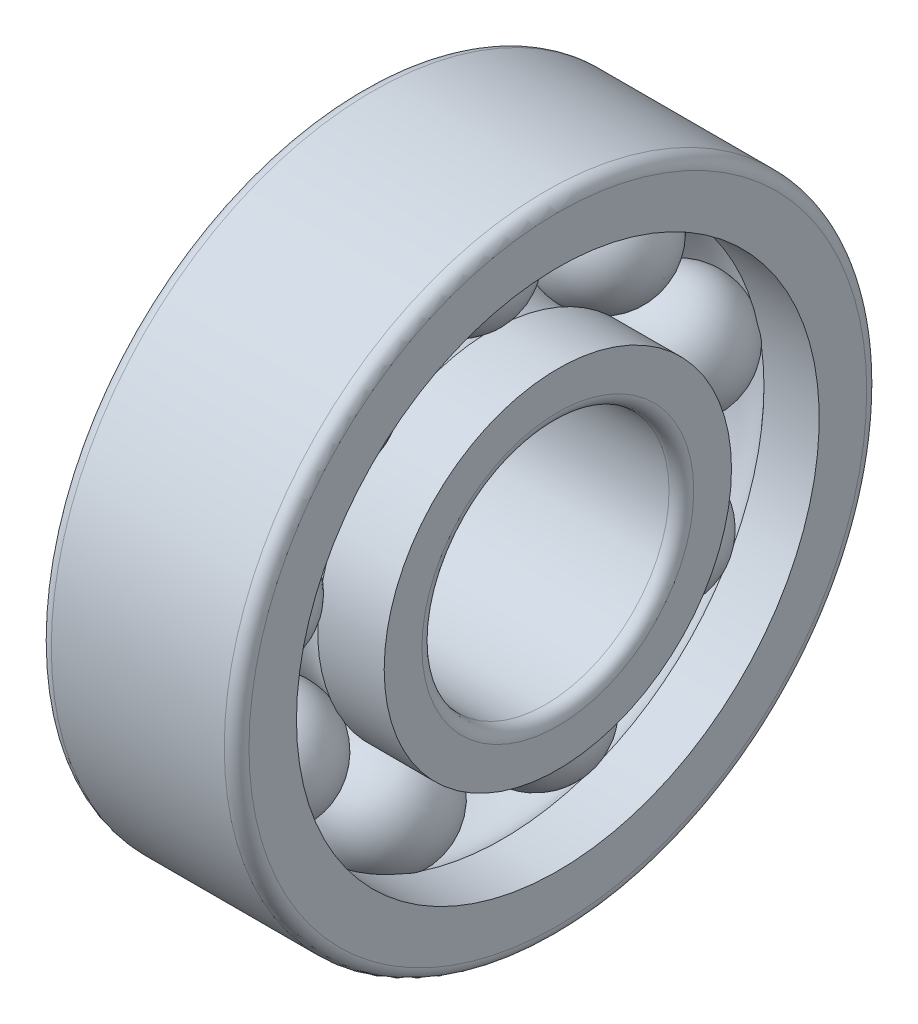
ISO-10303-21;
HEADER;
FILE_DESCRIPTION(('STEP AP214'),'2;1');
FILE_NAME('part.step','',(''),(''),'','','');
FILE_SCHEMA(('AUTOMOTIVE_DESIGN { 1 0 10303 214 1 1 1 1 }'));
ENDSEC;
DATA;
#1=APPLICATION_CONTEXT('core data for automotive mechanical design processes');
#2=APPLICATION_PROTOCOL_DEFINITION('international standard','automotive_design',2000,#1);
#3=PRODUCT_CONTEXT('',#1,'mechanical');
#4=PRODUCT('Part','Part','',(#3));
#5=PRODUCT_RELATED_PRODUCT_CATEGORY('part','',(#4));
#6=PRODUCT_DEFINITION_FORMATION('','',#4);
#7=PRODUCT_DEFINITION_CONTEXT('part definition',#1,'design');
#8=PRODUCT_DEFINITION('design','',#6,#7);
#9=PRODUCT_DEFINITION_SHAPE('','',#8);
#10=(LENGTH_UNIT() NAMED_UNIT(*) SI_UNIT(.MILLI.,.METRE.));
#11=(NAMED_UNIT(*) PLANE_ANGLE_UNIT() SI_UNIT($,.RADIAN.));
#12=(NAMED_UNIT(*) SI_UNIT($,.STERADIAN.) SOLID_ANGLE_UNIT());
#13=UNCERTAINTY_MEASURE_WITH_UNIT(LENGTH_MEASURE(1.E-05),#10,'distance_accuracy_value','');
#14=(GEOMETRIC_REPRESENTATION_CONTEXT(3) GLOBAL_UNCERTAINTY_ASSIGNED_CONTEXT((#13)) GLOBAL_UNIT_ASSIGNED_CONTEXT((#10,
#11,#12)) REPRESENTATION_CONTEXT('',''));
#15=CARTESIAN_POINT('',(0.,0.,0.));
#16=DIRECTION('',(0.,0.,1.));
#17=DIRECTION('',(1.,0.,0.));
#18=AXIS2_PLACEMENT_3D('',#15,#16,#17);
#19=CARTESIAN_POINT('',(5.,0.,0.));
#20=DIRECTION('',(1.,0.,0.));
#21=DIRECTION('',(0.,0.,-1.));
#22=AXIS2_PLACEMENT_3D('',#19,#20,#21);
#23=CYLINDRICAL_SURFACE('',#22,5.);
#24=CARTESIAN_POINT('',(3.5,0.,0.));
#25=DIRECTION('',(1.,0.,0.));
#26=DIRECTION('',(0.,0.,-1.));
#27=AXIS2_PLACEMENT_3D('',#24,#25,#26);
#28=CIRCLE('',#27,5.);
#29=CARTESIAN_POINT('',(3.5,0.,-5.00000000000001));
#30=VERTEX_POINT('',#29);
#31=EDGE_CURVE('E945',#30,#30,#28,.F.);
#32=ORIENTED_EDGE('',*,*,#31,.F.);
#33=EDGE_LOOP('',(#32));
#34=FACE_BOUND('',#33,.T.);
#35=CARTESIAN_POINT('',(-3.5,0.,0.));
#36=DIRECTION('',(1.,0.,0.));
#37=DIRECTION('',(0.,0.,-1.));
#38=AXIS2_PLACEMENT_3D('',#35,#36,#37);
#39=CIRCLE('',#38,5.);
#40=CARTESIAN_POINT('',(-3.5,0.,-5.00000000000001));
#41=VERTEX_POINT('',#40);
#42=EDGE_CURVE('E942',#41,#41,#39,.T.);
#43=ORIENTED_EDGE('',*,*,#42,.F.);
#44=EDGE_LOOP('',(#43));
#45=FACE_BOUND('',#44,.T.);
#46=ADVANCED_FACE('F14',(#34,#45),#23,.F.);
#47=CARTESIAN_POINT('',(-3.5,0.,0.));
#48=DIRECTION('',(1.,0.,0.));
#49=DIRECTION('',(0.,0.,-1.));
#50=AXIS2_PLACEMENT_3D('',#47,#48,#49);
#51=TOROIDAL_SURFACE('',#50,5.5,0.500000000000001);
#52=ORIENTED_EDGE('',*,*,#42,.T.);
#53=EDGE_LOOP('',(#52));
#54=FACE_BOUND('',#53,.T.);
#55=CARTESIAN_POINT('',(-4.,0.,0.));
#56=DIRECTION('',(-1.,0.,0.));
#57=DIRECTION('',(0.,0.,-1.));
#58=AXIS2_PLACEMENT_3D('',#55,#56,#57);
#59=CIRCLE('',#58,5.5);
#60=CARTESIAN_POINT('',(-4.,0.,5.5));
#61=VERTEX_POINT('',#60);
#62=CARTESIAN_POINT('',(-4.,0.,-5.50000000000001));
#63=VERTEX_POINT('',#62);
#64=EDGE_CURVE('E893',#61,#63,#59,.F.);
#65=ORIENTED_EDGE('',*,*,#64,.F.);
#66=CARTESIAN_POINT('',(-4.,0.,0.));
#67=DIRECTION('',(-1.,0.,0.));
#68=DIRECTION('',(0.,0.,1.));
#69=AXIS2_PLACEMENT_3D('',#66,#67,#68);
#70=CIRCLE('',#69,5.5);
#71=EDGE_CURVE('E883',#63,#61,#70,.F.);
#72=ORIENTED_EDGE('',*,*,#71,.F.);
#73=EDGE_LOOP('',(#65,#72));
#74=FACE_BOUND('',#73,.T.);
#75=ADVANCED_FACE('F868',(#54,#74),#51,.T.);
#76=CARTESIAN_POINT('',(3.5,0.,0.));
#77=DIRECTION('',(1.,0.,0.));
#78=DIRECTION('',(0.,0.,-1.));
#79=AXIS2_PLACEMENT_3D('',#76,#77,#78);
#80=TOROIDAL_SURFACE('',#79,5.49999999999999,0.500000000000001);
#81=CARTESIAN_POINT('',(4.,0.,0.));
#82=DIRECTION('',(1.,0.,0.));
#83=DIRECTION('',(0.,0.,-1.));
#84=AXIS2_PLACEMENT_3D('',#81,#82,#83);
#85=CIRCLE('',#84,5.49999999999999);
#86=CARTESIAN_POINT('',(4.,0.,5.50000000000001));
#87=VERTEX_POINT('',#86);
#88=CARTESIAN_POINT('',(4.,0.,-5.50000000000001));
#89=VERTEX_POINT('',#88);
#90=EDGE_CURVE('E852',#87,#89,#85,.F.);
#91=ORIENTED_EDGE('',*,*,#90,.F.);
#92=CARTESIAN_POINT('',(4.,0.,0.));
#93=DIRECTION('',(1.,0.,0.));
#94=DIRECTION('',(0.,0.,1.));
#95=AXIS2_PLACEMENT_3D('',#92,#93,#94);
#96=CIRCLE('',#95,5.49999999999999);
#97=EDGE_CURVE('E964',#89,#87,#96,.F.);
#98=ORIENTED_EDGE('',*,*,#97,.F.);
#99=EDGE_LOOP('',(#91,#98));
#100=FACE_BOUND('',#99,.T.);
#101=ORIENTED_EDGE('',*,*,#31,.T.);
#102=EDGE_LOOP('',(#101));
#103=FACE_BOUND('',#102,.T.);
#104=ADVANCED_FACE('F857',(#100,#103),#80,.T.);
#105=CARTESIAN_POINT('',(-4.,5.49999999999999,0.));
#106=DIRECTION('',(-1.,0.,0.));
#107=DIRECTION('',(0.,0.,1.));
#108=AXIS2_PLACEMENT_3D('',#105,#106,#107);
#109=PLANE('',#108);
#110=CARTESIAN_POINT('',(-4.,0.,0.));
#111=DIRECTION('',(1.,0.,0.));
#112=DIRECTION('',(0.,0.,-1.));
#113=AXIS2_PLACEMENT_3D('',#110,#111,#112);
#114=CIRCLE('',#113,7.02761341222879);
#115=CARTESIAN_POINT('',(-4.,0.,-7.02761341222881));
#116=VERTEX_POINT('',#115);
#117=EDGE_CURVE('E1408',#116,#116,#114,.T.);
#118=ORIENTED_EDGE('',*,*,#117,.F.);
#119=EDGE_LOOP('',(#118));
#120=FACE_BOUND('',#119,.T.);
#121=ORIENTED_EDGE('',*,*,#71,.T.);
#122=ORIENTED_EDGE('',*,*,#64,.T.);
#123=EDGE_LOOP('',(#121,#122));
#124=FACE_BOUND('',#123,.T.);
#125=ADVANCED_FACE('F867',(#120,#124),#109,.T.);
#126=CARTESIAN_POINT('',(0.,0.,0.));
#127=DIRECTION('',(1.,0.,0.));
#128=DIRECTION('',(0.,0.,-1.));
#129=AXIS2_PLACEMENT_3D('',#126,#127,#128);
#130=TOROIDAL_SURFACE('',#129,8.99999999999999,2.36686390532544);
#131=CARTESIAN_POINT('',(-1.30833325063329,0.919097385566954,6.96725270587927));
#132=CARTESIAN_POINT('',(-1.25284076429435,0.913490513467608,6.93085557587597));
#133=CARTESIAN_POINT('',(-1.19578822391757,0.908245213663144,6.89678523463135));
#134=CARTESIAN_POINT('',(-1.07897378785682,0.898508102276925,6.8335091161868));
#135=CARTESIAN_POINT('',(-1.01921148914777,0.894016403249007,6.80430406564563));
#136=CARTESIAN_POINT('',(-0.897535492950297,0.885827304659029,6.75103758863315));
#137=CARTESIAN_POINT('',(-0.835626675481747,0.882128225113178,6.72696528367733));
#138=CARTESIAN_POINT('',(-0.710001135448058,0.875537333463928,6.68406063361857));
#139=CARTESIAN_POINT('',(-0.646284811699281,0.872645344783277,6.66522714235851));
#140=CARTESIAN_POINT('',(-0.486880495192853,0.86650953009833,6.62526001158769));
#141=CARTESIAN_POINT('',(-0.390365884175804,0.863749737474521,6.60727432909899));
#142=CARTESIAN_POINT('',(-0.195894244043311,0.860068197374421,6.58327917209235));
#143=CARTESIAN_POINT('',(-0.0979381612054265,0.859145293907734,6.57726216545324));
#144=CARTESIAN_POINT('',(0.0802973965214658,0.859145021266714,6.57726029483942));
#145=CARTESIAN_POINT('',(0.160582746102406,0.859765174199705,6.58130339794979));
#146=CARTESIAN_POINT('',(0.320315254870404,0.862239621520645,6.59743220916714));
#147=CARTESIAN_POINT('',(0.399762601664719,0.864093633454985,6.60951607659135));
#148=CARTESIAN_POINT('',(0.542603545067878,0.868566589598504,6.63865948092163));
#149=CARTESIAN_POINT('',(0.606275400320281,0.870983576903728,6.65440454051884));
#150=CARTESIAN_POINT('',(0.732072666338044,0.876612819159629,6.69106241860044));
#151=CARTESIAN_POINT('',(0.79419817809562,0.879825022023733,6.71197489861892));
#152=CARTESIAN_POINT('',(0.934720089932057,0.88809970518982,6.76582288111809));
#153=CARTESIAN_POINT('',(1.01244569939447,0.893428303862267,6.80048407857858));
#154=CARTESIAN_POINT('',(1.16375374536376,0.905338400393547,6.87790245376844));
#155=CARTESIAN_POINT('',(1.2373318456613,0.911921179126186,6.92066790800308));
#156=CARTESIAN_POINT('',(1.3083332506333,0.919097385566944,6.96725270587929));
#157=B_SPLINE_CURVE_WITH_KNOTS('',3,(#131,#132,#133,#134,#135,#136,#137,#138,#139,#140,#141,
#142,#143,#144,#145,#146,#147,#148,#149,#150,#151,#152,#153,#154,#155,#156),.UNSPECIFIED.,.F.,
.F.,(4,2,2,2,2,2,2,2,2,2,2,2,4),(0.,0.199738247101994,0.39950629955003,0.598846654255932,
0.798143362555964,1.09199371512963,1.38565908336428,1.62642901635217,1.86714385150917,
2.06382700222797,2.26049727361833,2.51579916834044,2.77136321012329),.UNSPECIFIED.);
#158=CARTESIAN_POINT('',(-1.30833325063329,0.919097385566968,6.96725270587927));
#159=VERTEX_POINT('',#158);
#160=CARTESIAN_POINT('',(1.30833325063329,0.919097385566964,6.96725270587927));
#161=VERTEX_POINT('',#160);
#162=EDGE_CURVE('E914',#159,#161,#157,.T.);
#163=ORIENTED_EDGE('',*,*,#162,.F.);
#164=CARTESIAN_POINT('',(-1.30833325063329,0.,0.));
#165=DIRECTION('',(1.,0.,0.));
#166=DIRECTION('',(0.,0.,-1.));
#167=AXIS2_PLACEMENT_3D('',#164,#165,#166);
#168=CIRCLE('',#167,7.02761341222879);
#169=CARTESIAN_POINT('',(-1.30833325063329,-3.24660980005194,6.23272613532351));
#170=VERTEX_POINT('',#169);
#171=EDGE_CURVE('E980',#170,#159,#168,.F.);
#172=ORIENTED_EDGE('',*,*,#171,.F.);
#173=CARTESIAN_POINT('',(1.30833325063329,-3.24660980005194,6.23272613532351));
#174=CARTESIAN_POINT('',(1.25284076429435,-3.22889251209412,6.20044168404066));
#175=CARTESIAN_POINT('',(1.19578822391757,-3.21231079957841,6.17022003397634));
#176=CARTESIAN_POINT('',(1.07897378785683,-3.18151920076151,6.11409022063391));
#177=CARTESIAN_POINT('',(1.01921148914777,-3.16730966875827,6.08818270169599));
#178=CARTESIAN_POINT('',(0.897535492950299,-3.14139622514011,6.04092942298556));
#179=CARTESIAN_POINT('',(0.835626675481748,-3.12968701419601,6.01957401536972));
#180=CARTESIAN_POINT('',(0.710001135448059,-3.10881934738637,5.98151105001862));
#181=CARTESIAN_POINT('',(0.646284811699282,-3.09966033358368,5.96480247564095));
#182=CARTESIAN_POINT('',(0.486880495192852,-3.08022499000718,5.92934422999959));
#183=CARTESIAN_POINT('',(0.390365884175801,-3.07148016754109,5.91338712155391));
#184=CARTESIAN_POINT('',(0.195894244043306,-3.05981382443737,5.89209821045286));
#185=CARTESIAN_POINT('',(0.0979381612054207,-3.05688864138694,5.88675972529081));
#186=CARTESIAN_POINT('',(-0.0802973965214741,-3.05688774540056,5.88675806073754));
#187=CARTESIAN_POINT('',(-0.160582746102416,-3.05885332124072,5.89034523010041));
#188=CARTESIAN_POINT('',(-0.320315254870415,-3.06669491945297,5.90465504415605));
#189=CARTESIAN_POINT('',(-0.399762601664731,-3.07257004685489,5.91537605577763));
#190=CARTESIAN_POINT('',(-0.542603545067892,-3.0867408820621,5.94123205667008));
#191=CARTESIAN_POINT('',(-0.606275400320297,-3.09439723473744,5.95520091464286));
#192=CARTESIAN_POINT('',(-0.73207266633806,-3.11222472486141,5.98772273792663));
#193=CARTESIAN_POINT('',(-0.794198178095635,-3.12239569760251,6.00627540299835));
#194=CARTESIAN_POINT('',(-0.934720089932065,-3.14858845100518,6.05404584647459));
#195=CARTESIAN_POINT('',(-1.01244569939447,-3.16545052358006,6.08479422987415));
#196=CARTESIAN_POINT('',(-1.16375374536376,-3.20312099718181,6.15347021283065));
#197=CARTESIAN_POINT('',(-1.23733184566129,-3.22393343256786,6.19140515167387));
#198=CARTESIAN_POINT('',(-1.30833325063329,-3.24660980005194,6.23272613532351));
#199=B_SPLINE_CURVE_WITH_KNOTS('',3,(#173,#174,#175,#176,#177,#178,#179,#180,#181,#182,#183,
#184,#185,#186,#187,#188,#189,#190,#191,#192,#193,#194,#195,#196,#197,#198),.UNSPECIFIED.,.F.,
.F.,(4,2,2,2,2,2,2,2,2,2,2,2,4),(0.,0.199738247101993,0.399506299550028,0.598846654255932,
0.798143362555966,1.09199371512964,1.38565908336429,1.62642901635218,1.86714385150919,
2.06382700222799,2.26049727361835,2.51579916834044,2.77136321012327),.UNSPECIFIED.);
#200=CARTESIAN_POINT('',(1.30833325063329,-3.24660980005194,6.23272613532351));
#201=VERTEX_POINT('',#200);
#202=EDGE_CURVE('E919',#201,#170,#199,.T.);
#203=ORIENTED_EDGE('',*,*,#202,.F.);
#204=CARTESIAN_POINT('',(1.30833325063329,0.,0.));
#205=DIRECTION('',(1.,0.,0.));
#206=DIRECTION('',(0.,0.,-1.));
#207=AXIS2_PLACEMENT_3D('',#204,#205,#206);
#208=CIRCLE('',#207,7.02761341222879);
#209=EDGE_CURVE('E977',#161,#201,#208,.T.);
#210=ORIENTED_EDGE('',*,*,#209,.F.);
#211=EDGE_LOOP('',(#163,#172,#203,#210));
#212=FACE_BOUND('',#211,.T.);
#213=ADVANCED_FACE('F905',(#212),#130,.F.);
#214=CARTESIAN_POINT('',(4.,7.02761341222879,0.));
#215=DIRECTION('',(1.,0.,0.));
#216=DIRECTION('',(0.,0.,-1.));
#217=AXIS2_PLACEMENT_3D('',#214,#215,#216);
#218=PLANE('',#217);
#219=ORIENTED_EDGE('',*,*,#90,.T.);
#220=ORIENTED_EDGE('',*,*,#97,.T.);
#221=EDGE_LOOP('',(#219,#220));
#222=FACE_BOUND('',#221,.T.);
#223=CARTESIAN_POINT('',(4.,0.,0.));
#224=DIRECTION('',(1.,0.,0.));
#225=DIRECTION('',(0.,0.,-1.));
#226=AXIS2_PLACEMENT_3D('',#223,#224,#225);
#227=CIRCLE('',#226,7.02761341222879);
#228=CARTESIAN_POINT('',(4.,0.,-7.02761341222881));
#229=VERTEX_POINT('',#228);
#230=EDGE_CURVE('E1003',#229,#229,#227,.F.);
#231=ORIENTED_EDGE('',*,*,#230,.F.);
#232=EDGE_LOOP('',(#231));
#233=FACE_BOUND('',#232,.T.);
#234=ADVANCED_FACE('F909',(#222,#233),#218,.T.);
#235=CARTESIAN_POINT('',(0.,0.,0.));
#236=DIRECTION('',(1.,0.,0.));
#237=DIRECTION('',(0.,0.,-1.));
#238=AXIS2_PLACEMENT_3D('',#235,#236,#237);
#239=TOROIDAL_SURFACE('',#238,8.99999999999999,2.36686390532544);
#240=CARTESIAN_POINT('',(-1.30833325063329,1.51927173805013,-6.86142577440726));
#241=CARTESIAN_POINT('',(-1.25284076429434,1.51209192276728,-6.82530599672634));
#242=CARTESIAN_POINT('',(-1.19578822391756,1.50536814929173,-6.7914963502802));
#243=CARTESIAN_POINT('',(-1.07897378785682,1.49287633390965,-6.72870596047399));
#244=CARTESIAN_POINT('',(-1.01921148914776,1.48710843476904,-6.69972593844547));
#245=CARTESIAN_POINT('',(-0.89753549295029,1.47658546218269,-6.64687098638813));
#246=CARTESIAN_POINT('',(-0.835626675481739,1.47182824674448,-6.62298525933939));
#247=CARTESIAN_POINT('',(-0.710001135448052,1.46334740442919,-6.58041385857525));
#248=CARTESIAN_POINT('',(-0.64628481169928,1.45962355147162,-6.56172704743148));
#249=CARTESIAN_POINT('',(-0.486880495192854,1.451719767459,-6.5220716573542));
#250=CARTESIAN_POINT('',(-0.3903658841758,1.44816165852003,-6.50422673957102));
#251=CARTESIAN_POINT('',(-0.195894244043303,1.44341434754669,-6.48041950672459));
#252=CARTESIAN_POINT('',(-0.0979381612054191,1.44222365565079,-6.47444971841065));
#253=CARTESIAN_POINT('',(0.0802973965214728,1.44222327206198,-6.47444786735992));
#254=CARTESIAN_POINT('',(0.160582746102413,1.4430233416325,-6.47845924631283));
#255=CARTESIAN_POINT('',(0.320315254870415,1.4462145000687,-6.49446168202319));
#256=CARTESIAN_POINT('',(0.399762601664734,1.44860522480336,-6.5064509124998));
#257=CARTESIAN_POINT('',(0.54260354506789,1.45436965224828,-6.53536659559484));
#258=CARTESIAN_POINT('',(0.606275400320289,1.45748355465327,-6.55098877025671));
#259=CARTESIAN_POINT('',(0.732072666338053,1.46473152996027,-6.58736122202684));
#260=CARTESIAN_POINT('',(0.794198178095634,1.46886553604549,-6.60811116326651));
#261=CARTESIAN_POINT('',(0.93472008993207,1.47950697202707,-6.66154182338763));
#262=CARTESIAN_POINT('',(1.01244569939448,1.48635455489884,-6.69593518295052));
#263=CARTESIAN_POINT('',(1.16375374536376,1.50164136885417,-6.77275815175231));
#264=CARTESIAN_POINT('',(1.23733184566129,1.51008222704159,-6.81519597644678));
#265=CARTESIAN_POINT('',(1.30833325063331,1.51927173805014,-6.86142577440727));
#266=B_SPLINE_CURVE_WITH_KNOTS('',3,(#240,#241,#242,#243,#244,#245,#246,#247,#248,#249,#250,
#251,#252,#253,#254,#255,#256,#257,#258,#259,#260,#261,#262,#263,#264,#265),.UNSPECIFIED.,.F.,
.F.,(4,2,2,2,2,2,2,2,2,2,2,2,4),(0.,0.19973824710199,0.399506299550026,0.598846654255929,
0.798143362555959,1.09199371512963,1.38565908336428,1.62642901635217,1.86714385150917,
2.06382700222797,2.26049727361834,2.51579916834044,2.77136321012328),.UNSPECIFIED.);
#267=CARTESIAN_POINT('',(-1.30833325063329,1.51927173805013,-6.86142577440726));
#268=VERTEX_POINT('',#267);
#269=CARTESIAN_POINT('',(1.30833325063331,1.51927173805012,-6.86142577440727));
#270=VERTEX_POINT('',#269);
#271=EDGE_CURVE('E285',#268,#270,#266,.T.);
#272=ORIENTED_EDGE('',*,*,#271,.F.);
#273=CARTESIAN_POINT('',(-1.30833325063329,0.,0.));
#274=DIRECTION('',(1.,0.,0.));
#275=DIRECTION('',(0.,0.,-1.));
#276=AXIS2_PLACEMENT_3D('',#273,#274,#275);
#277=CIRCLE('',#276,7.02761341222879);
#278=CARTESIAN_POINT('',(-1.30833325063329,5.18253315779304,-4.74644080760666));
#279=VERTEX_POINT('',#278);
#280=EDGE_CURVE('E1409',#279,#268,#277,.F.);
#281=ORIENTED_EDGE('',*,*,#280,.F.);
#282=CARTESIAN_POINT('',(1.30833325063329,5.18253315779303,-4.74644080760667));
#283=CARTESIAN_POINT('',(1.25284076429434,5.15484242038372,-4.7221630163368));
#284=CARTESIAN_POINT('',(1.19578822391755,5.12892429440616,-4.69943523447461));
#285=CARTESIAN_POINT('',(1.07897378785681,5.0807921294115,-4.65722181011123));
#286=CARTESIAN_POINT('',(1.01921148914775,5.05857864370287,-4.63773665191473));
#287=CARTESIAN_POINT('',(0.897535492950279,5.01806639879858,-4.60219601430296));
#288=CARTESIAN_POINT('',(0.835626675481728,4.99975936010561,-4.58613328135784));
#289=CARTESIAN_POINT('',(0.710001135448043,4.96713186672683,-4.55750295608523));
#290=CARTESIAN_POINT('',(0.646284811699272,4.95281054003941,-4.54493459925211));
#291=CARTESIAN_POINT('',(0.486880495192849,4.92241985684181,-4.51826202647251));
#292=CARTESIAN_POINT('',(0.390365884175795,4.90874475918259,-4.50625815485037));
#293=CARTESIAN_POINT('',(0.195894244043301,4.89050074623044,-4.49024324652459));
#294=CARTESIAN_POINT('',(0.097938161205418,4.88592610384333,-4.48622718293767));
#295=CARTESIAN_POINT('',(-0.0802973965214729,4.88592469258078,-4.48622592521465));
#296=CARTESIAN_POINT('',(-0.160582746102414,4.88899861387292,-4.48892449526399));
#297=CARTESIAN_POINT('',(-0.320315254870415,4.90126155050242,-4.49968933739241));
#298=CARTESIAN_POINT('',(-0.399762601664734,4.91044916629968,-4.50775438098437));
#299=CARTESIAN_POINT('',(-0.542603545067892,4.9326086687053,-4.52720436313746));
#300=CARTESIAN_POINT('',(-0.606275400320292,4.94458091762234,-4.53771216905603));
#301=CARTESIAN_POINT('',(-0.732072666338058,4.97245639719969,-4.56217532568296));
#302=CARTESIAN_POINT('',(-0.79419817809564,4.98835937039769,-4.57613045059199));
#303=CARTESIAN_POINT('',(-0.934720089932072,5.02931096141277,-4.61206153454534));
#304=CARTESIAN_POINT('',(-1.01244569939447,5.05567269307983,-4.63518839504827));
#305=CARTESIAN_POINT('',(-1.16375374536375,5.11455992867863,-4.68683864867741));
#306=CARTESIAN_POINT('',(-1.23733184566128,5.14709173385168,-4.71536755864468));
#307=CARTESIAN_POINT('',(-1.30833325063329,5.18253315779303,-4.74644080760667));
#308=B_SPLINE_CURVE_WITH_KNOTS('',3,(#282,#283,#284,#285,#286,#287,#288,#289,#290,#291,#292,
#293,#294,#295,#296,#297,#298,#299,#300,#301,#302,#303,#304,#305,#306,#307),.UNSPECIFIED.,.F.,
.F.,(4,2,2,2,2,2,2,2,2,2,2,2,4),(0.,0.199738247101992,0.39950629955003,0.598846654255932,
0.798143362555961,1.09199371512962,1.38565908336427,1.62642901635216,1.86714385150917,
2.06382700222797,2.26049727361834,2.51579916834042,2.77136321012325),.UNSPECIFIED.);
#309=CARTESIAN_POINT('',(1.30833325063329,5.18253315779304,-4.74644080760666));
#310=VERTEX_POINT('',#309);
#311=EDGE_CURVE('E968',#310,#279,#308,.T.);
#312=ORIENTED_EDGE('',*,*,#311,.F.);
#313=CARTESIAN_POINT('',(1.30833325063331,0.,0.));
#314=DIRECTION('',(1.,0.,0.));
#315=DIRECTION('',(0.,0.,-1.));
#316=AXIS2_PLACEMENT_3D('',#313,#314,#315);
#317=CIRCLE('',#316,7.02761341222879);
#318=EDGE_CURVE('E629',#270,#310,#317,.T.);
#319=ORIENTED_EDGE('',*,*,#318,.F.);
#320=EDGE_LOOP('',(#272,#281,#312,#319));
#321=FACE_BOUND('',#320,.T.);
#322=ADVANCED_FACE('F1365',(#321),#239,.F.);
#323=CARTESIAN_POINT('',(0.,0.,0.));
#324=DIRECTION('',(1.,0.,0.));
#325=DIRECTION('',(0.,0.,-1.));
#326=AXIS2_PLACEMENT_3D('',#323,#324,#325);
#327=TOROIDAL_SURFACE('',#326,8.99999999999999,2.36686390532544);
#328=CARTESIAN_POINT('',(-1.30833325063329,7.02100406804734,0.304716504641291));
#329=CARTESIAN_POINT('',(-1.25284076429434,6.98418626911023,0.303917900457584));
#330=CARTESIAN_POINT('',(-1.19578822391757,6.9497226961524,0.3031672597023));
#331=CARTESIAN_POINT('',(-1.07897378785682,6.88571705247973,0.301768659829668));
#332=CARTESIAN_POINT('',(-1.01921148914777,6.85617571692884,0.301120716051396));
#333=CARTESIAN_POINT('',(-0.897535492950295,6.80229645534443,0.299935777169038));
#334=CARTESIAN_POINT('',(-0.835626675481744,6.77794752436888,0.299398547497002));
#335=CARTESIAN_POINT('',(-0.710001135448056,6.73455019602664,0.298438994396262));
#336=CARTESIAN_POINT('',(-0.646284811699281,6.71550063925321,0.29801664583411));
#337=CARTESIAN_POINT('',(-0.486880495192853,6.67507522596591,0.29711902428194));
#338=CARTESIAN_POINT('',(-0.3903658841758,6.65688355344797,0.296713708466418));
#339=CARTESIAN_POINT('',(-0.195894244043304,6.6326136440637,0.29617260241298));
#340=CARTESIAN_POINT('',(-0.0979381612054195,6.6265277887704,0.296036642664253));
#341=CARTESIAN_POINT('',(0.0802973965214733,6.6265258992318,0.296036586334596));
#342=CARTESIAN_POINT('',(0.160582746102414,6.63061526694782,0.296127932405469));
#343=CARTESIAN_POINT('',(0.320315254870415,6.64692872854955,0.296491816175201));
#344=CARTESIAN_POINT('',(0.399762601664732,6.65915096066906,0.296764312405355));
#345=CARTESIAN_POINT('',(0.542603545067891,6.6886283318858,0.297420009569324));
#346=CARTESIAN_POINT('',(0.606275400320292,6.70455389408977,0.297773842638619));
#347=CARTESIAN_POINT('',(0.732072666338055,6.74163236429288,0.298595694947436));
#348=CARTESIAN_POINT('',(0.794198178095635,6.76278492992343,0.299063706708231));
#349=CARTESIAN_POINT('',(0.934720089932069,6.81725172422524,0.300265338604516));
#350=CARTESIAN_POINT('',(1.01244569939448,6.85231164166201,0.301036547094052));
#351=CARTESIAN_POINT('',(1.16375374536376,6.9306220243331,0.302750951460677));
#352=CARTESIAN_POINT('',(1.23733184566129,6.97388086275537,0.303694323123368));
#353=CARTESIAN_POINT('',(1.30833325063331,7.02100406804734,0.304716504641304));
#354=B_SPLINE_CURVE_WITH_KNOTS('',3,(#328,#329,#330,#331,#332,#333,#334,#335,#336,#337,#338,
#339,#340,#341,#342,#343,#344,#345,#346,#347,#348,#349,#350,#351,#352,#353),.UNSPECIFIED.,.F.,
.F.,(4,2,2,2,2,2,2,2,2,2,2,2,4),(0.,0.19973824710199,0.399506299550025,0.598846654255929,
0.798143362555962,1.09199371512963,1.38565908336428,1.62642901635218,1.86714385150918,
2.06382700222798,2.26049727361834,2.51579916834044,2.77136321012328),.UNSPECIFIED.);
#355=CARTESIAN_POINT('',(-1.30833325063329,7.02100406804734,0.304716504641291));
#356=VERTEX_POINT('',#355);
#357=CARTESIAN_POINT('',(1.30833325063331,7.02100406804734,0.304716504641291));
#358=VERTEX_POINT('',#357);
#359=EDGE_CURVE('E271',#356,#358,#354,.T.);
#360=ORIENTED_EDGE('',*,*,#359,.F.);
#361=CARTESIAN_POINT('',(-1.30833325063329,0.,0.));
#362=DIRECTION('',(1.,0.,0.));
#363=DIRECTION('',(0.,0.,-1.));
#364=AXIS2_PLACEMENT_3D('',#361,#362,#363);
#365=CIRCLE('',#364,7.02761341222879);
#366=CARTESIAN_POINT('',(-1.3083332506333,5.5742691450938,4.27958803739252));
#367=VERTEX_POINT('',#366);
#368=EDGE_CURVE('E288',#367,#356,#365,.F.);
#369=ORIENTED_EDGE('',*,*,#368,.F.);
#370=CARTESIAN_POINT('',(1.30833325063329,5.57426914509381,4.27958803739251));
#371=CARTESIAN_POINT('',(1.25284076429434,5.54555174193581,4.25653377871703));
#372=CARTESIAN_POINT('',(1.19578822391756,5.5186686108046,4.23495604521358));
#373=CARTESIAN_POINT('',(1.07897378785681,5.46873844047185,4.19488540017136));
#374=CARTESIAN_POINT('',(1.01921148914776,5.44569197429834,4.17639294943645));
#375=CARTESIAN_POINT('',(0.897535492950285,5.40365640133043,4.14266774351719));
#376=CARTESIAN_POINT('',(0.835626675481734,5.38465871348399,4.12742809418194));
#377=CARTESIAN_POINT('',(0.710001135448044,5.35079764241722,4.10026788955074));
#378=CARTESIAN_POINT('',(0.646284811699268,5.33593335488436,4.08834660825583));
#379=CARTESIAN_POINT('',(0.486880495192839,5.30438871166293,4.06304927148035));
#380=CARTESIAN_POINT('',(0.390365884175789,5.29019255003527,4.05166637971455));
#381=CARTESIAN_POINT('',(0.195894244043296,5.27125290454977,4.0364804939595));
#382=CARTESIAN_POINT('',(0.097938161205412,5.26650347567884,4.03267273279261));
#383=CARTESIAN_POINT('',(-0.0802973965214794,5.26650199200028,4.03267156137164));
#384=CARTESIAN_POINT('',(-0.160582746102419,5.26969334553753,4.03523018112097));
#385=CARTESIAN_POINT('',(-0.320315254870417,5.28242408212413,4.04543752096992));
#386=CARTESIAN_POINT('',(-0.399762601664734,5.29196201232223,4.05308507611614));
#387=CARTESIAN_POINT('',(-0.542603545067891,5.31496446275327,4.07153047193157));
#388=CARTESIAN_POINT('',(-0.606275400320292,5.327391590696,4.08149617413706));
#389=CARTESIAN_POINT('',(-0.732072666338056,5.35632362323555,4.10470017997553));
#390=CARTESIAN_POINT('',(-0.794198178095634,5.37282826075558,4.11793826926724));
#391=CARTESIAN_POINT('',(-0.934720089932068,5.41532463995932,4.15202834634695));
#392=CARTESIAN_POINT('',(-1.01244569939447,5.44267781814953,4.17397364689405));
#393=CARTESIAN_POINT('',(-1.16375374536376,5.50376904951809,4.22299728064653));
#394=CARTESIAN_POINT('',(-1.23733184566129,5.53751362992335,4.2500808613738));
#395=CARTESIAN_POINT('',(-1.30833325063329,5.57426914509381,4.27958803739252));
#396=B_SPLINE_CURVE_WITH_KNOTS('',3,(#370,#371,#372,#373,#374,#375,#376,#377,#378,#379,#380,
#381,#382,#383,#384,#385,#386,#387,#388,#389,#390,#391,#392,#393,#394,#395),.UNSPECIFIED.,.F.,
.F.,(4,2,2,2,2,2,2,2,2,2,2,2,4),(0.,0.199738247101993,0.399506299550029,0.598846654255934,
0.798143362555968,1.09199371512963,1.38565908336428,1.62642901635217,1.86714385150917,
2.06382700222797,2.26049727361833,2.51579916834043,2.77136321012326),.UNSPECIFIED.);
#397=CARTESIAN_POINT('',(1.30833325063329,5.57426914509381,4.27958803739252));
#398=VERTEX_POINT('',#397);
#399=EDGE_CURVE('E276',#398,#367,#396,.T.);
#400=ORIENTED_EDGE('',*,*,#399,.F.);
#401=CARTESIAN_POINT('',(1.30833325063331,0.,0.));
#402=DIRECTION('',(1.,0.,0.));
#403=DIRECTION('',(0.,0.,-1.));
#404=AXIS2_PLACEMENT_3D('',#401,#402,#403);
#405=CIRCLE('',#404,7.02761341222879);
#406=EDGE_CURVE('E626',#358,#398,#405,.T.);
#407=ORIENTED_EDGE('',*,*,#406,.F.);
#408=EDGE_LOOP('',(#360,#369,#400,#407));
#409=FACE_BOUND('',#408,.T.);
#410=ADVANCED_FACE('F289',(#409),#327,.F.);
#411=CARTESIAN_POINT('',(5.,0.,0.));
#412=DIRECTION('',(1.,0.,0.));
#413=DIRECTION('',(0.,0.,-1.));
#414=AXIS2_PLACEMENT_3D('',#411,#412,#413);
#415=CYLINDRICAL_SURFACE('',#414,7.02761341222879);
#416=ORIENTED_EDGE('',*,*,#117,.T.);
#417=EDGE_LOOP('',(#416));
#418=FACE_BOUND('',#417,.T.);
#419=CARTESIAN_POINT('',(-1.30833325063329,-3.77439426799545,5.92800963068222));
#420=CARTESIAN_POINT('',(-1.31577796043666,-3.75334330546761,5.94141352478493));
#421=CARTESIAN_POINT('',(-1.32232103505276,-3.73199970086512,5.95484473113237));
#422=CARTESIAN_POINT('',(-1.3335586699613,-3.68881882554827,5.98168966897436));
#423=CARTESIAN_POINT('',(-1.33825311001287,-3.66698152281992,5.99510339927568));
#424=CARTESIAN_POINT('',(-1.34933043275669,-3.60183453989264,6.03462289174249));
#425=CARTESIAN_POINT('',(-1.35303513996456,-3.55796047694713,6.06059955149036));
#426=CARTESIAN_POINT('',(-1.35303513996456,-3.46965293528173,6.11158393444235));
#427=CARTESIAN_POINT('',(-1.34933043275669,-3.42521945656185,6.13659165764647));
#428=CARTESIAN_POINT('',(-1.33825311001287,-3.35842108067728,6.17325085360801));
#429=CARTESIAN_POINT('',(-1.3335586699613,-3.33588579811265,6.18545564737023));
#430=CARTESIAN_POINT('',(-1.32232103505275,-3.29104696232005,6.20942891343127));
#431=CARTESIAN_POINT('',(-1.31577796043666,-3.26874339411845,6.22119741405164));
#432=CARTESIAN_POINT('',(-1.30833325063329,-3.24660980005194,6.23272613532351));
#433=B_SPLINE_CURVE_WITH_KNOTS('',3,(#419,#420,#421,#422,#423,#424,#425,#426,#427,#428,#429,
#430,#431,#432),.UNSPECIFIED.,.F.,.F.,(4,2,2,2,2,2,4),(0.,0.0780963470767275,0.156197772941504,
0.308984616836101,0.461771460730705,0.539872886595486,0.617969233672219),.UNSPECIFIED.);
#434=CARTESIAN_POINT('',(-1.30833325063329,-3.77439426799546,5.92800963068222));
#435=VERTEX_POINT('',#434);
#436=EDGE_CURVE('E360',#435,#170,#433,.T.);
#437=ORIENTED_EDGE('',*,*,#436,.T.);
#438=ORIENTED_EDGE('',*,*,#171,.T.);
#439=CARTESIAN_POINT('',(-1.30833325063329,0.919097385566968,6.96725270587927));
#440=CARTESIAN_POINT('',(-1.31577796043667,0.943839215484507,6.96398938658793));
#441=CARTESIAN_POINT('',(-1.32232103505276,0.96882277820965,6.96055888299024));
#442=CARTESIAN_POINT('',(-1.3335586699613,1.01915684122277,6.95336716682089));
#443=CARTESIAN_POINT('',(-1.33825311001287,1.04450736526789,6.94960593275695));
#444=CARTESIAN_POINT('',(-1.3493304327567,1.11981548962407,6.93800394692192));
#445=CARTESIAN_POINT('',(-1.35303513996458,1.17012244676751,6.92970151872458));
#446=CARTESIAN_POINT('',(-1.35303513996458,1.27054207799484,6.91199482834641));
#447=CARTESIAN_POINT('',(-1.3493304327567,1.32065475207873,6.90259056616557));
#448=CARTESIAN_POINT('',(-1.33825311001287,1.39538935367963,6.88773597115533));
#449=CARTESIAN_POINT('',(-1.3335586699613,1.42049747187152,6.88259998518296));
#450=CARTESIAN_POINT('',(-1.32232103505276,1.47025573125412,6.87214272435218));
#451=CARTESIAN_POINT('',(-1.31577796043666,1.49490590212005,6.86682146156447));
#452=CARTESIAN_POINT('',(-1.30833325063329,1.51927173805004,6.86142577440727));
#453=B_SPLINE_CURVE_WITH_KNOTS('',3,(#439,#440,#441,#442,#443,#444,#445,#446,#447,#448,#449,
#450,#451,#452),.UNSPECIFIED.,.F.,.F.,(4,2,2,2,2,2,4),(0.,0.0780963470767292,0.156197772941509,
0.308984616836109,0.461771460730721,0.539872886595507,0.617969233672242),.UNSPECIFIED.);
#454=CARTESIAN_POINT('',(-1.30833325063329,1.51927173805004,6.86142577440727));
#455=VERTEX_POINT('',#454);
#456=EDGE_CURVE('E300',#159,#455,#453,.T.);
#457=ORIENTED_EDGE('',*,*,#456,.T.);
#458=CARTESIAN_POINT('',(-1.30833325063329,0.,0.));
#459=DIRECTION('',(1.,0.,0.));
#460=DIRECTION('',(0.,0.,-1.));
#461=AXIS2_PLACEMENT_3D('',#458,#459,#460);
#462=CIRCLE('',#461,7.0276134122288);
#463=CARTESIAN_POINT('',(-1.3083332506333,5.18253315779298,4.74644080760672));
#464=VERTEX_POINT('',#463);
#465=EDGE_CURVE('E299',#455,#464,#462,.F.);
#466=ORIENTED_EDGE('',*,*,#465,.T.);
#467=CARTESIAN_POINT('',(-1.3083332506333,5.18253315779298,4.74644080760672));
#468=CARTESIAN_POINT('',(-1.31577796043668,5.19938887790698,4.72803721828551));
#469=CARTESIAN_POINT('',(-1.32232103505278,5.21632231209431,4.70935017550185));
#470=CARTESIAN_POINT('',(-1.33355866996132,5.25025769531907,4.67148688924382));
#471=CARTESIAN_POINT('',(-1.33825311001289,5.26725964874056,4.6523106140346));
#472=CARTESIAN_POINT('',(-1.34933043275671,5.31749140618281,4.59501584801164));
#473=CARTESIAN_POINT('',(-1.35303513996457,5.3506920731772,4.55631913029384));
#474=CARTESIAN_POINT('',(-1.35303513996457,5.41623633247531,4.4782065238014));
#475=CARTESIAN_POINT('',(-1.34933043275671,5.44857992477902,4.43879063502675));
#476=CARTESIAN_POINT('',(-1.33825311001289,5.4962816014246,4.37937287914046));
#477=CARTESIAN_POINT('',(-1.33355866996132,5.51221418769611,4.35929929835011));
#478=CARTESIAN_POINT('',(-1.32232103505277,5.54360942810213,4.31930457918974));
#479=CARTESIAN_POINT('',(-1.31577796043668,5.55907211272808,4.29938343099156));
#480=CARTESIAN_POINT('',(-1.30833325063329,5.5742691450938,4.27958803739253));
#481=B_SPLINE_CURVE_WITH_KNOTS('',3,(#467,#468,#469,#470,#471,#472,#473,#474,#475,#476,#477,
#478,#479,#480),.UNSPECIFIED.,.F.,.F.,(4,2,2,2,2,2,4),(0.,0.0780963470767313,0.156197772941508,
0.308984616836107,0.461771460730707,0.539872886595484,0.617969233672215),.UNSPECIFIED.);
#482=EDGE_CURVE('E281',#464,#367,#481,.T.);
#483=ORIENTED_EDGE('',*,*,#482,.T.);
#484=ORIENTED_EDGE('',*,*,#368,.T.);
#485=CARTESIAN_POINT('',(-1.30833325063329,7.02100406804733,0.304716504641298));
#486=CARTESIAN_POINT('',(-1.31577796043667,7.022086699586,0.279783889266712));
#487=CARTESIAN_POINT('',(-1.32232103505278,7.02304666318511,0.254584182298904));
#488=CARTESIAN_POINT('',(-1.33355866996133,7.02470462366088,0.203765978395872));
#489=CARTESIAN_POINT('',(-1.3382531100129,7.02540260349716,0.178147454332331));
#490=CARTESIAN_POINT('',(-1.34933043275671,7.02705399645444,0.10196876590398));
#491=CARTESIAN_POINT('',(-1.35303513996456,7.02761341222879,0.0509843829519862));
#492=CARTESIAN_POINT('',(-1.35303513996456,7.02761341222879,-0.0509843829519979));
#493=CARTESIAN_POINT('',(-1.34933043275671,7.02705399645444,-0.101968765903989));
#494=CARTESIAN_POINT('',(-1.3382531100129,7.02540260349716,-0.178147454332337));
#495=CARTESIAN_POINT('',(-1.33355866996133,7.02470462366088,-0.203765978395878));
#496=CARTESIAN_POINT('',(-1.32232103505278,7.02304666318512,-0.254584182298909));
#497=CARTESIAN_POINT('',(-1.31577796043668,7.022086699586,-0.279783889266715));
#498=CARTESIAN_POINT('',(-1.30833325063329,7.02100406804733,-0.304716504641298));
#499=B_SPLINE_CURVE_WITH_KNOTS('',3,(#485,#486,#487,#488,#489,#490,#491,#492,#493,#494,#495,
#496,#497,#498),.UNSPECIFIED.,.F.,.F.,(4,2,2,2,2,2,4),(0.,0.0780963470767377,0.156197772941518,
0.308984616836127,0.461771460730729,0.539872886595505,0.61796923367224),.UNSPECIFIED.);
#500=CARTESIAN_POINT('',(-1.30833325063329,7.02100406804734,-0.304716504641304));
#501=VERTEX_POINT('',#500);
#502=EDGE_CURVE('E292',#356,#501,#499,.T.);
#503=ORIENTED_EDGE('',*,*,#502,.T.);
#504=CARTESIAN_POINT('',(-1.30833325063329,0.,0.));
#505=DIRECTION('',(1.,0.,0.));
#506=DIRECTION('',(0.,0.,-1.));
#507=AXIS2_PLACEMENT_3D('',#504,#505,#506);
#508=CIRCLE('',#507,7.0276134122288);
#509=CARTESIAN_POINT('',(-1.30833325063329,5.57426914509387,-4.27958803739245));
#510=VERTEX_POINT('',#509);
#511=EDGE_CURVE('E617',#501,#510,#508,.F.);
#512=ORIENTED_EDGE('',*,*,#511,.T.);
#513=CARTESIAN_POINT('',(-1.30833325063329,5.57426914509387,-4.27958803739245));
#514=CARTESIAN_POINT('',(-1.31577796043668,5.55907211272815,-4.29938343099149));
#515=CARTESIAN_POINT('',(-1.32232103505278,5.54360942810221,-4.31930457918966));
#516=CARTESIAN_POINT('',(-1.33355866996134,5.51221418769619,-4.35929929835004));
#517=CARTESIAN_POINT('',(-1.3382531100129,5.49628160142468,-4.37937287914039));
#518=CARTESIAN_POINT('',(-1.34933043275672,5.44857992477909,-4.43879063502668));
#519=CARTESIAN_POINT('',(-1.35303513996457,5.41623633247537,-4.47820652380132));
#520=CARTESIAN_POINT('',(-1.35303513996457,5.35069207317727,-4.55631913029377));
#521=CARTESIAN_POINT('',(-1.34933043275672,5.31749140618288,-4.59501584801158));
#522=CARTESIAN_POINT('',(-1.33825311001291,5.26725964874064,-4.65231061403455));
#523=CARTESIAN_POINT('',(-1.33355866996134,5.25025769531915,-4.67148688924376));
#524=CARTESIAN_POINT('',(-1.32232103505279,5.21632231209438,-4.7093501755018));
#525=CARTESIAN_POINT('',(-1.31577796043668,5.19938887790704,-4.72803721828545));
#526=CARTESIAN_POINT('',(-1.30833325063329,5.18253315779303,-4.74644080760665));
#527=B_SPLINE_CURVE_WITH_KNOTS('',3,(#513,#514,#515,#516,#517,#518,#519,#520,#521,#522,#523,
#524,#525,#526),.UNSPECIFIED.,.F.,.F.,(4,2,2,2,2,2,4),(0.,0.0780963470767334,0.15619777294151,
0.30898461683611,0.46177146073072,0.539872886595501,0.61796923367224),.UNSPECIFIED.);
#528=EDGE_CURVE('E351',#510,#279,#527,.T.);
#529=ORIENTED_EDGE('',*,*,#528,.T.);
#530=ORIENTED_EDGE('',*,*,#280,.T.);
#531=CARTESIAN_POINT('',(-1.30833325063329,1.51927173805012,-6.86142577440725));
#532=CARTESIAN_POINT('',(-1.31577796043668,1.49490590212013,-6.86682146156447));
#533=CARTESIAN_POINT('',(-1.32232103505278,1.47025573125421,-6.87214272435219));
#534=CARTESIAN_POINT('',(-1.33355866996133,1.42049747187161,-6.88259998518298));
#535=CARTESIAN_POINT('',(-1.3382531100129,1.39538935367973,-6.88773597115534));
#536=CARTESIAN_POINT('',(-1.34933043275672,1.32065475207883,-6.90259056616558));
#537=CARTESIAN_POINT('',(-1.35303513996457,1.27054207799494,-6.9119948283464));
#538=CARTESIAN_POINT('',(-1.35303513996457,1.17012244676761,-6.92970151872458));
#539=CARTESIAN_POINT('',(-1.34933043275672,1.11981548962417,-6.93800394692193));
#540=CARTESIAN_POINT('',(-1.3382531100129,1.04450736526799,-6.94960593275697));
#541=CARTESIAN_POINT('',(-1.33355866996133,1.01915684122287,-6.95336716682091));
#542=CARTESIAN_POINT('',(-1.32232103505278,0.968822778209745,-6.96055888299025));
#543=CARTESIAN_POINT('',(-1.31577796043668,0.9438392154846,-6.96398938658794));
#544=CARTESIAN_POINT('',(-1.30833325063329,0.919097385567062,-6.96725270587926));
#545=B_SPLINE_CURVE_WITH_KNOTS('',3,(#531,#532,#533,#534,#535,#536,#537,#538,#539,#540,#541,
#542,#543,#544),.UNSPECIFIED.,.F.,.F.,(4,2,2,2,2,2,4),(0.,0.0780963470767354,0.156197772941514,
0.308984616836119,0.461771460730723,0.539872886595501,0.617969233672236),.UNSPECIFIED.);
#546=CARTESIAN_POINT('',(-1.30833325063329,0.919097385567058,-6.96725270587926));
#547=VERTEX_POINT('',#546);
#548=EDGE_CURVE('E345',#268,#547,#545,.T.);
#549=ORIENTED_EDGE('',*,*,#548,.T.);
#550=CARTESIAN_POINT('',(-1.30833325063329,0.,0.));
#551=DIRECTION('',(1.,0.,0.));
#552=DIRECTION('',(0.,0.,-1.));
#553=AXIS2_PLACEMENT_3D('',#550,#551,#552);
#554=CIRCLE('',#553,7.0276134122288);
#555=CARTESIAN_POINT('',(-1.30833325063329,-3.24660980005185,-6.23272613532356));
#556=VERTEX_POINT('',#555);
#557=EDGE_CURVE('E997',#547,#556,#554,.F.);
#558=ORIENTED_EDGE('',*,*,#557,.T.);
#559=CARTESIAN_POINT('',(-1.30833325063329,-3.24660980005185,-6.23272613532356));
#560=CARTESIAN_POINT('',(-1.31577796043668,-3.26874339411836,-6.2211974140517));
#561=CARTESIAN_POINT('',(-1.32232103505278,-3.29104696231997,-6.20942891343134));
#562=CARTESIAN_POINT('',(-1.33355866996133,-3.33588579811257,-6.1854556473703));
#563=CARTESIAN_POINT('',(-1.3382531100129,-3.3584210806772,-6.17325085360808));
#564=CARTESIAN_POINT('',(-1.34933043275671,-3.42521945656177,-6.13659165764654));
#565=CARTESIAN_POINT('',(-1.35303513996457,-3.46965293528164,-6.11158393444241));
#566=CARTESIAN_POINT('',(-1.35303513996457,-3.55796047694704,-6.06059955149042));
#567=CARTESIAN_POINT('',(-1.34933043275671,-3.60183453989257,-6.03462289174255));
#568=CARTESIAN_POINT('',(-1.3382531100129,-3.66698152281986,-5.99510339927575));
#569=CARTESIAN_POINT('',(-1.33355866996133,-3.68881882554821,-5.98168966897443));
#570=CARTESIAN_POINT('',(-1.32232103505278,-3.73199970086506,-5.95484473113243));
#571=CARTESIAN_POINT('',(-1.31577796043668,-3.75334330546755,-5.94141352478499));
#572=CARTESIAN_POINT('',(-1.30833325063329,-3.77439426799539,-5.92800963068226));
#573=B_SPLINE_CURVE_WITH_KNOTS('',3,(#559,#560,#561,#562,#563,#564,#565,#566,#567,#568,#569,
#570,#571,#572),.UNSPECIFIED.,.F.,.F.,(4,2,2,2,2,2,4),(0.,0.0780963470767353,0.156197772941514,
0.308984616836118,0.46177146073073,0.539872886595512,0.617969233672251),.UNSPECIFIED.);
#574=CARTESIAN_POINT('',(-1.30833325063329,-3.77439426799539,-5.92800963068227));
#575=VERTEX_POINT('',#574);
#576=EDGE_CURVE('E335',#556,#575,#573,.T.);
#577=ORIENTED_EDGE('',*,*,#576,.T.);
#578=CARTESIAN_POINT('',(-1.30833325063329,0.,0.));
#579=DIRECTION('',(1.,0.,0.));
#580=DIRECTION('',(0.,0.,-1.));
#581=AXIS2_PLACEMENT_3D('',#578,#579,#580);
#582=CIRCLE('',#581,7.0276134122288);
#583=CARTESIAN_POINT('',(-1.30833325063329,-6.49336653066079,-2.68766466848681));
#584=VERTEX_POINT('',#583);
#585=EDGE_CURVE('E624',#575,#584,#582,.F.);
#586=ORIENTED_EDGE('',*,*,#585,.T.);
#587=CARTESIAN_POINT('',(-1.30833325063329,-6.4933665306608,-2.68766466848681));
#588=CARTESIAN_POINT('',(-1.31577796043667,-6.50291132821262,-2.66460595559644));
#589=CARTESIAN_POINT('',(-1.32232103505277,-6.51243220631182,-2.64125430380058));
#590=CARTESIAN_POINT('',(-1.33355866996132,-6.53137102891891,-2.59406786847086));
#591=CARTESIAN_POINT('',(-1.33825311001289,-6.54078896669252,-2.57023305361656));
#592=CARTESIAN_POINT('',(-1.34933043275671,-6.56839541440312,-2.49921331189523));
#593=CARTESIAN_POINT('',(-1.35303513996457,-6.58635877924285,-2.45149499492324));
#594=CARTESIAN_POINT('',(-1.35303513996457,-6.62123415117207,-2.35567569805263));
#595=CARTESIAN_POINT('',(-1.34933043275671,-6.63814615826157,-2.30757471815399));
#596=CARTESIAN_POINT('',(-1.33825311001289,-6.66264900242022,-2.23542535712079));
#597=CARTESIAN_POINT('',(-1.33355866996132,-6.67075516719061,-2.21111309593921));
#598=CARTESIAN_POINT('',(-1.32232103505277,-6.68657804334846,-2.16279254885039));
#599=CARTESIAN_POINT('',(-1.31577796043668,-6.69429478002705,-2.13878424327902));
#600=CARTESIAN_POINT('',(-1.30833325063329,-6.70180489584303,-2.11498496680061));
#601=B_SPLINE_CURVE_WITH_KNOTS('',3,(#587,#588,#589,#590,#591,#592,#593,#594,#595,#596,#597,
#598,#599,#600),.UNSPECIFIED.,.F.,.F.,(4,2,2,2,2,2,4),(0.,0.0780963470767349,0.156197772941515,
0.308984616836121,0.461771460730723,0.539872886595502,0.617969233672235),.UNSPECIFIED.);
#602=CARTESIAN_POINT('',(-1.30833325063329,-6.70180489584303,-2.11498496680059));
#603=VERTEX_POINT('',#602);
#604=EDGE_CURVE('E373',#584,#603,#601,.T.);
#605=ORIENTED_EDGE('',*,*,#604,.T.);
#606=CARTESIAN_POINT('',(-1.30833325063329,0.,0.));
#607=DIRECTION('',(1.,0.,0.));
#608=DIRECTION('',(0.,0.,-1.));
#609=AXIS2_PLACEMENT_3D('',#606,#607,#608);
#610=CIRCLE('',#609,7.0276134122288);
#611=CARTESIAN_POINT('',(-1.30833325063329,-6.70180489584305,2.11498496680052));
#612=VERTEX_POINT('',#611);
#613=EDGE_CURVE('E983',#603,#612,#610,.F.);
#614=ORIENTED_EDGE('',*,*,#613,.T.);
#615=CARTESIAN_POINT('',(-1.30833325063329,-6.70180489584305,2.11498496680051));
#616=CARTESIAN_POINT('',(-1.31577796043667,-6.69429478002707,2.13878424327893));
#617=CARTESIAN_POINT('',(-1.32232103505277,-6.68657804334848,2.1627925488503));
#618=CARTESIAN_POINT('',(-1.33355866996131,-6.67075516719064,2.21111309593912));
#619=CARTESIAN_POINT('',(-1.33825311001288,-6.66264900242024,2.23542535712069));
#620=CARTESIAN_POINT('',(-1.3493304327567,-6.63814615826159,2.3075747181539));
#621=CARTESIAN_POINT('',(-1.35303513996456,-6.62123415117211,2.35567569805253));
#622=CARTESIAN_POINT('',(-1.35303513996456,-6.58635877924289,2.45149499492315));
#623=CARTESIAN_POINT('',(-1.3493304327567,-6.56839541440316,2.49921331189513));
#624=CARTESIAN_POINT('',(-1.33825311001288,-6.54078896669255,2.57023305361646));
#625=CARTESIAN_POINT('',(-1.33355866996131,-6.53137102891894,2.59406786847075));
#626=CARTESIAN_POINT('',(-1.32232103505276,-6.51243220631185,2.64125430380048));
#627=CARTESIAN_POINT('',(-1.31577796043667,-6.50291132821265,2.66460595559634));
#628=CARTESIAN_POINT('',(-1.30833325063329,-6.49336653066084,2.68766466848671));
#629=B_SPLINE_CURVE_WITH_KNOTS('',3,(#615,#616,#617,#618,#619,#620,#621,#622,#623,#624,#625,
#626,#627,#628),.UNSPECIFIED.,.F.,.F.,(4,2,2,2,2,2,4),(0.,0.0780963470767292,0.156197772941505,
0.308984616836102,0.461771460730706,0.539872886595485,0.617969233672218),.UNSPECIFIED.);
#630=CARTESIAN_POINT('',(-1.30833325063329,-6.49336653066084,2.68766466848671));
#631=VERTEX_POINT('',#630);
#632=EDGE_CURVE('E367',#612,#631,#629,.T.);
#633=ORIENTED_EDGE('',*,*,#632,.T.);
#634=CARTESIAN_POINT('',(-1.30833325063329,0.,0.));
#635=DIRECTION('',(1.,0.,0.));
#636=DIRECTION('',(0.,0.,-1.));
#637=AXIS2_PLACEMENT_3D('',#634,#635,#636);
#638=CIRCLE('',#637,7.0276134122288);
#639=EDGE_CURVE('E995',#631,#435,#638,.F.);
#640=ORIENTED_EDGE('',*,*,#639,.T.);
#641=EDGE_LOOP('',(#437,#438,#457,#466,#483,#484,#503,#512,#529,#530,#549,#558,#577,#586,#605,
#614,#633,#640));
#642=FACE_BOUND('',#641,.T.);
#643=ADVANCED_FACE('F296',(#418,#642),#415,.T.);
#644=CARTESIAN_POINT('',(5.,0.,0.));
#645=DIRECTION('',(1.,0.,0.));
#646=DIRECTION('',(0.,0.,-1.));
#647=AXIS2_PLACEMENT_3D('',#644,#645,#646);
#648=CYLINDRICAL_SURFACE('',#647,7.02761341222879);
#649=ORIENTED_EDGE('',*,*,#230,.T.);
#650=EDGE_LOOP('',(#649));
#651=FACE_BOUND('',#650,.T.);
#652=CARTESIAN_POINT('',(1.30833325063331,0.,0.));
#653=DIRECTION('',(1.,0.,0.));
#654=DIRECTION('',(0.,0.,-1.));
#655=AXIS2_PLACEMENT_3D('',#652,#653,#654);
#656=CIRCLE('',#655,7.02761341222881);
#657=CARTESIAN_POINT('',(1.30833325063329,5.18253315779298,4.74644080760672));
#658=VERTEX_POINT('',#657);
#659=CARTESIAN_POINT('',(1.30833325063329,1.51927173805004,6.86142577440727));
#660=VERTEX_POINT('',#659);
#661=EDGE_CURVE('E661',#658,#660,#656,.T.);
#662=ORIENTED_EDGE('',*,*,#661,.T.);
#663=CARTESIAN_POINT('',(1.30833325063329,0.919097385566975,6.96725270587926));
#664=CARTESIAN_POINT('',(1.31577796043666,0.943839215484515,6.96398938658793));
#665=CARTESIAN_POINT('',(1.32232103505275,0.968822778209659,6.96055888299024));
#666=CARTESIAN_POINT('',(1.33355866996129,1.01915684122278,6.95336716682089));
#667=CARTESIAN_POINT('',(1.33825311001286,1.0445073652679,6.94960593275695));
#668=CARTESIAN_POINT('',(1.34933043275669,1.11981548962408,6.93800394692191));
#669=CARTESIAN_POINT('',(1.35303513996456,1.17012244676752,6.92970151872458));
#670=CARTESIAN_POINT('',(1.35303513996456,1.27054207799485,6.91199482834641));
#671=CARTESIAN_POINT('',(1.34933043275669,1.32065475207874,6.90259056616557));
#672=CARTESIAN_POINT('',(1.33825311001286,1.39538935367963,6.88773597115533));
#673=CARTESIAN_POINT('',(1.33355866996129,1.42049747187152,6.88259998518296));
#674=CARTESIAN_POINT('',(1.32232103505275,1.47025573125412,6.87214272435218));
#675=CARTESIAN_POINT('',(1.31577796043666,1.49490590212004,6.86682146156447));
#676=CARTESIAN_POINT('',(1.30833325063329,1.51927173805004,6.86142577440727));
#677=B_SPLINE_CURVE_WITH_KNOTS('',3,(#663,#664,#665,#666,#667,#668,#669,#670,#671,#672,#673,
#674,#675,#676),.UNSPECIFIED.,.F.,.F.,(4,2,2,2,2,2,4),(0.,0.0780963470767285,0.156197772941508,
0.308984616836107,0.461771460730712,0.539872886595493,0.617969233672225),.UNSPECIFIED.);
#678=EDGE_CURVE('E650',#161,#660,#677,.T.);
#679=ORIENTED_EDGE('',*,*,#678,.F.);
#680=ORIENTED_EDGE('',*,*,#209,.T.);
#681=CARTESIAN_POINT('',(1.30833325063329,-3.24660980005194,6.23272613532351));
#682=CARTESIAN_POINT('',(1.31577796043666,-3.26874339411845,6.22119741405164));
#683=CARTESIAN_POINT('',(1.32232103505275,-3.29104696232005,6.20942891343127));
#684=CARTESIAN_POINT('',(1.3335586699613,-3.33588579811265,6.18545564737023));
#685=CARTESIAN_POINT('',(1.33825311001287,-3.35842108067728,6.17325085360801));
#686=CARTESIAN_POINT('',(1.34933043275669,-3.42521945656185,6.13659165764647));
#687=CARTESIAN_POINT('',(1.35303513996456,-3.46965293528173,6.11158393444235));
#688=CARTESIAN_POINT('',(1.35303513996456,-3.55796047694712,6.06059955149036));
#689=CARTESIAN_POINT('',(1.34933043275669,-3.60183453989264,6.03462289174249));
#690=CARTESIAN_POINT('',(1.33825311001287,-3.66698152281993,5.99510339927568));
#691=CARTESIAN_POINT('',(1.3335586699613,-3.68881882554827,5.98168966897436));
#692=CARTESIAN_POINT('',(1.32232103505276,-3.73199970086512,5.95484473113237));
#693=CARTESIAN_POINT('',(1.31577796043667,-3.75334330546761,5.94141352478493));
#694=CARTESIAN_POINT('',(1.30833325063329,-3.77439426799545,5.92800963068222));
#695=B_SPLINE_CURVE_WITH_KNOTS('',3,(#681,#682,#683,#684,#685,#686,#687,#688,#689,#690,#691,
#692,#693,#694),.UNSPECIFIED.,.F.,.F.,(4,2,2,2,2,2,4),(0.,0.0780963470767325,0.156197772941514,
0.308984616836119,0.461771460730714,0.539872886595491,0.617969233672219),.UNSPECIFIED.);
#696=CARTESIAN_POINT('',(1.3083332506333,-3.77439426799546,5.92800963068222));
#697=VERTEX_POINT('',#696);
#698=EDGE_CURVE('E992',#201,#697,#695,.T.);
#699=ORIENTED_EDGE('',*,*,#698,.T.);
#700=CARTESIAN_POINT('',(1.30833325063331,0.,0.));
#701=DIRECTION('',(1.,0.,0.));
#702=DIRECTION('',(0.,0.,-1.));
#703=AXIS2_PLACEMENT_3D('',#700,#701,#702);
#704=CIRCLE('',#703,7.02761341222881);
#705=CARTESIAN_POINT('',(1.30833325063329,-6.49336653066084,2.68766466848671));
#706=VERTEX_POINT('',#705);
#707=EDGE_CURVE('E1014',#697,#706,#704,.T.);
#708=ORIENTED_EDGE('',*,*,#707,.T.);
#709=CARTESIAN_POINT('',(1.30833325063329,-6.49336653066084,2.68766466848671));
#710=CARTESIAN_POINT('',(1.31577796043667,-6.50291132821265,2.66460595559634));
#711=CARTESIAN_POINT('',(1.32232103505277,-6.51243220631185,2.64125430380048));
#712=CARTESIAN_POINT('',(1.33355866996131,-6.53137102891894,2.59406786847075));
#713=CARTESIAN_POINT('',(1.33825311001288,-6.54078896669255,2.57023305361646));
#714=CARTESIAN_POINT('',(1.3493304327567,-6.56839541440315,2.49921331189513));
#715=CARTESIAN_POINT('',(1.35303513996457,-6.58635877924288,2.45149499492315));
#716=CARTESIAN_POINT('',(1.35303513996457,-6.6212341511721,2.35567569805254));
#717=CARTESIAN_POINT('',(1.3493304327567,-6.63814615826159,2.3075747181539));
#718=CARTESIAN_POINT('',(1.33825311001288,-6.66264900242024,2.2354253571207));
#719=CARTESIAN_POINT('',(1.33355866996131,-6.67075516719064,2.21111309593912));
#720=CARTESIAN_POINT('',(1.32232103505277,-6.68657804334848,2.1627925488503));
#721=CARTESIAN_POINT('',(1.31577796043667,-6.69429478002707,2.13878424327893));
#722=CARTESIAN_POINT('',(1.30833325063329,-6.70180489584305,2.11498496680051));
#723=B_SPLINE_CURVE_WITH_KNOTS('',3,(#709,#710,#711,#712,#713,#714,#715,#716,#717,#718,#719,
#720,#721,#722),.UNSPECIFIED.,.F.,.F.,(4,2,2,2,2,2,4),(0.,0.07809634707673,0.156197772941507,
0.308984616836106,0.461771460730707,0.539872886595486,0.617969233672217),.UNSPECIFIED.);
#724=CARTESIAN_POINT('',(1.3083332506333,-6.70180489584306,2.11498496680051));
#725=VERTEX_POINT('',#724);
#726=EDGE_CURVE('E1442',#706,#725,#723,.T.);
#727=ORIENTED_EDGE('',*,*,#726,.T.);
#728=CARTESIAN_POINT('',(1.30833325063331,0.,0.));
#729=DIRECTION('',(1.,0.,0.));
#730=DIRECTION('',(0.,0.,-1.));
#731=AXIS2_PLACEMENT_3D('',#728,#729,#730);
#732=CIRCLE('',#731,7.02761341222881);
#733=CARTESIAN_POINT('',(1.30833325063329,-6.70180489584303,-2.11498496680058));
#734=VERTEX_POINT('',#733);
#735=EDGE_CURVE('E1015',#725,#734,#732,.T.);
#736=ORIENTED_EDGE('',*,*,#735,.T.);
#737=CARTESIAN_POINT('',(1.30833325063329,-6.70180489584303,-2.11498496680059));
#738=CARTESIAN_POINT('',(1.31577796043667,-6.69429478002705,-2.13878424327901));
#739=CARTESIAN_POINT('',(1.32232103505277,-6.68657804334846,-2.16279254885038));
#740=CARTESIAN_POINT('',(1.33355866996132,-6.67075516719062,-2.2111130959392));
#741=CARTESIAN_POINT('',(1.33825311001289,-6.66264900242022,-2.23542535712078));
#742=CARTESIAN_POINT('',(1.34933043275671,-6.63814615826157,-2.30757471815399));
#743=CARTESIAN_POINT('',(1.35303513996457,-6.62123415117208,-2.35567569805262));
#744=CARTESIAN_POINT('',(1.35303513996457,-6.58635877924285,-2.45149499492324));
#745=CARTESIAN_POINT('',(1.34933043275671,-6.56839541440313,-2.49921331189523));
#746=CARTESIAN_POINT('',(1.33825311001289,-6.54078896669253,-2.57023305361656));
#747=CARTESIAN_POINT('',(1.33355866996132,-6.53137102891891,-2.59406786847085));
#748=CARTESIAN_POINT('',(1.32232103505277,-6.51243220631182,-2.64125430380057));
#749=CARTESIAN_POINT('',(1.31577796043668,-6.50291132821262,-2.66460595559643));
#750=CARTESIAN_POINT('',(1.30833325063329,-6.4933665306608,-2.6876646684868));
#751=B_SPLINE_CURVE_WITH_KNOTS('',3,(#737,#738,#739,#740,#741,#742,#743,#744,#745,#746,#747,
#748,#749,#750),.UNSPECIFIED.,.F.,.F.,(4,2,2,2,2,2,4),(0.,0.0780963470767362,0.156197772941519,
0.308984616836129,0.46177146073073,0.539872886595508,0.617969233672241),.UNSPECIFIED.);
#752=CARTESIAN_POINT('',(1.3083332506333,-6.4933665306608,-2.68766466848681));
#753=VERTEX_POINT('',#752);
#754=EDGE_CURVE('E1447',#734,#753,#751,.T.);
#755=ORIENTED_EDGE('',*,*,#754,.T.);
#756=CARTESIAN_POINT('',(1.30833325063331,0.,0.));
#757=DIRECTION('',(1.,0.,0.));
#758=DIRECTION('',(0.,0.,-1.));
#759=AXIS2_PLACEMENT_3D('',#756,#757,#758);
#760=CIRCLE('',#759,7.02761341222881);
#761=CARTESIAN_POINT('',(1.30833325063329,-3.77439426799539,-5.92800963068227));
#762=VERTEX_POINT('',#761);
#763=EDGE_CURVE('E621',#753,#762,#760,.T.);
#764=ORIENTED_EDGE('',*,*,#763,.T.);
#765=CARTESIAN_POINT('',(1.30833325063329,-3.77439426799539,-5.92800963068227));
#766=CARTESIAN_POINT('',(1.31577796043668,-3.75334330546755,-5.94141352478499));
#767=CARTESIAN_POINT('',(1.32232103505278,-3.73199970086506,-5.95484473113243));
#768=CARTESIAN_POINT('',(1.33355866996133,-3.68881882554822,-5.98168966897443));
#769=CARTESIAN_POINT('',(1.3382531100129,-3.66698152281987,-5.99510339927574));
#770=CARTESIAN_POINT('',(1.34933043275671,-3.60183453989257,-6.03462289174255));
#771=CARTESIAN_POINT('',(1.35303513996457,-3.55796047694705,-6.06059955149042));
#772=CARTESIAN_POINT('',(1.35303513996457,-3.46965293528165,-6.11158393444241));
#773=CARTESIAN_POINT('',(1.34933043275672,-3.42521945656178,-6.13659165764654));
#774=CARTESIAN_POINT('',(1.3382531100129,-3.35842108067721,-6.17325085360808));
#775=CARTESIAN_POINT('',(1.33355866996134,-3.33588579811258,-6.1854556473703));
#776=CARTESIAN_POINT('',(1.32232103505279,-3.29104696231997,-6.20942891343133));
#777=CARTESIAN_POINT('',(1.31577796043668,-3.26874339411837,-6.2211974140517));
#778=CARTESIAN_POINT('',(1.30833325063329,-3.24660980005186,-6.23272613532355));
#779=B_SPLINE_CURVE_WITH_KNOTS('',3,(#765,#766,#767,#768,#769,#770,#771,#772,#773,#774,#775,
#776,#777,#778),.UNSPECIFIED.,.F.,.F.,(4,2,2,2,2,2,4),(0.,0.0780963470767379,0.156197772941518,
0.308984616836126,0.461771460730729,0.539872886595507,0.617969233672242),.UNSPECIFIED.);
#780=CARTESIAN_POINT('',(1.30833325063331,-3.24660980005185,-6.23272613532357));
#781=VERTEX_POINT('',#780);
#782=EDGE_CURVE('E998',#762,#781,#779,.T.);
#783=ORIENTED_EDGE('',*,*,#782,.T.);
#784=CARTESIAN_POINT('',(1.30833325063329,0.,0.));
#785=DIRECTION('',(1.,0.,0.));
#786=DIRECTION('',(0.,0.,-1.));
#787=AXIS2_PLACEMENT_3D('',#784,#785,#786);
#788=CIRCLE('',#787,7.0276134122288);
#789=CARTESIAN_POINT('',(1.30833325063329,0.919097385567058,-6.96725270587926));
#790=VERTEX_POINT('',#789);
#791=EDGE_CURVE('E684',#781,#790,#788,.T.);
#792=ORIENTED_EDGE('',*,*,#791,.T.);
#793=CARTESIAN_POINT('',(1.30833325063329,0.919097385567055,-6.96725270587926));
#794=CARTESIAN_POINT('',(1.31577796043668,0.943839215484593,-6.96398938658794));
#795=CARTESIAN_POINT('',(1.32232103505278,0.968822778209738,-6.96055888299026));
#796=CARTESIAN_POINT('',(1.33355866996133,1.01915684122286,-6.9533671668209));
#797=CARTESIAN_POINT('',(1.3382531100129,1.04450736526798,-6.94960593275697));
#798=CARTESIAN_POINT('',(1.34933043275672,1.11981548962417,-6.93800394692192));
#799=CARTESIAN_POINT('',(1.35303513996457,1.17012244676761,-6.92970151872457));
#800=CARTESIAN_POINT('',(1.35303513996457,1.27054207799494,-6.9119948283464));
#801=CARTESIAN_POINT('',(1.34933043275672,1.32065475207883,-6.90259056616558));
#802=CARTESIAN_POINT('',(1.3382531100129,1.39538935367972,-6.88773597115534));
#803=CARTESIAN_POINT('',(1.33355866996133,1.42049747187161,-6.88259998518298));
#804=CARTESIAN_POINT('',(1.32232103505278,1.47025573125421,-6.87214272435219));
#805=CARTESIAN_POINT('',(1.31577796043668,1.49490590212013,-6.86682146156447));
#806=CARTESIAN_POINT('',(1.30833325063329,1.51927173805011,-6.86142577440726));
#807=B_SPLINE_CURVE_WITH_KNOTS('',3,(#793,#794,#795,#796,#797,#798,#799,#800,#801,#802,#803,
#804,#805,#806),.UNSPECIFIED.,.F.,.F.,(4,2,2,2,2,2,4),(0.,0.0780963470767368,0.156197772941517,
0.308984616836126,0.461771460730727,0.539872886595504,0.617969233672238),.UNSPECIFIED.);
#808=EDGE_CURVE('E1428',#790,#270,#807,.T.);
#809=ORIENTED_EDGE('',*,*,#808,.T.);
#810=ORIENTED_EDGE('',*,*,#318,.T.);
#811=CARTESIAN_POINT('',(1.30833325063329,5.18253315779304,-4.74644080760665));
#812=CARTESIAN_POINT('',(1.31577796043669,5.19938887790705,-4.72803721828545));
#813=CARTESIAN_POINT('',(1.32232103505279,5.21632231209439,-4.7093501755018));
#814=CARTESIAN_POINT('',(1.33355866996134,5.25025769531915,-4.67148688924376));
#815=CARTESIAN_POINT('',(1.33825311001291,5.26725964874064,-4.65231061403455));
#816=CARTESIAN_POINT('',(1.34933043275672,5.31749140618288,-4.59501584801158));
#817=CARTESIAN_POINT('',(1.35303513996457,5.35069207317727,-4.55631913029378));
#818=CARTESIAN_POINT('',(1.35303513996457,5.41623633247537,-4.47820652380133));
#819=CARTESIAN_POINT('',(1.34933043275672,5.44857992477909,-4.43879063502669));
#820=CARTESIAN_POINT('',(1.33825311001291,5.49628160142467,-4.3793728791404));
#821=CARTESIAN_POINT('',(1.33355866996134,5.51221418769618,-4.35929929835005));
#822=CARTESIAN_POINT('',(1.32232103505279,5.54360942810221,-4.31930457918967));
#823=CARTESIAN_POINT('',(1.31577796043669,5.55907211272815,-4.2993834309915));
#824=CARTESIAN_POINT('',(1.30833325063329,5.57426914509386,-4.27958803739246));
#825=B_SPLINE_CURVE_WITH_KNOTS('',3,(#811,#812,#813,#814,#815,#816,#817,#818,#819,#820,#821,
#822,#823,#824),.UNSPECIFIED.,.F.,.F.,(4,2,2,2,2,2,4),(0.,0.0780963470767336,0.156197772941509,
0.308984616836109,0.461771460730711,0.539872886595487,0.617969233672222),.UNSPECIFIED.);
#826=CARTESIAN_POINT('',(1.3083332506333,5.57426914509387,-4.27958803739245));
#827=VERTEX_POINT('',#826);
#828=EDGE_CURVE('E586',#310,#827,#825,.T.);
#829=ORIENTED_EDGE('',*,*,#828,.T.);
#830=CARTESIAN_POINT('',(1.30833325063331,0.,0.));
#831=DIRECTION('',(1.,0.,0.));
#832=DIRECTION('',(0.,0.,-1.));
#833=AXIS2_PLACEMENT_3D('',#830,#831,#832);
#834=CIRCLE('',#833,7.02761341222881);
#835=CARTESIAN_POINT('',(1.30833325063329,7.02100406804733,-0.304716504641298));
#836=VERTEX_POINT('',#835);
#837=EDGE_CURVE('E619',#827,#836,#834,.T.);
#838=ORIENTED_EDGE('',*,*,#837,.T.);
#839=CARTESIAN_POINT('',(1.30833325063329,7.02100406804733,-0.304716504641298));
#840=CARTESIAN_POINT('',(1.31577796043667,7.022086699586,-0.279783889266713));
#841=CARTESIAN_POINT('',(1.32232103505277,7.02304666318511,-0.254584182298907));
#842=CARTESIAN_POINT('',(1.33355866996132,7.02470462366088,-0.203765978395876));
#843=CARTESIAN_POINT('',(1.33825311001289,7.02540260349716,-0.178147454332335));
#844=CARTESIAN_POINT('',(1.34933043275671,7.02705399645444,-0.101968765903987));
#845=CARTESIAN_POINT('',(1.35303513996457,7.02761341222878,-0.0509843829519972));
#846=CARTESIAN_POINT('',(1.35303513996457,7.02761341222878,0.0509843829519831));
#847=CARTESIAN_POINT('',(1.34933043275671,7.02705399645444,0.101968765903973));
#848=CARTESIAN_POINT('',(1.33825311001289,7.02540260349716,0.17814745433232));
#849=CARTESIAN_POINT('',(1.33355866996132,7.02470462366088,0.203765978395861));
#850=CARTESIAN_POINT('',(1.32232103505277,7.02304666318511,0.254584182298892));
#851=CARTESIAN_POINT('',(1.31577796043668,7.022086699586,0.279783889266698));
#852=CARTESIAN_POINT('',(1.30833325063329,7.02100406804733,0.304716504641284));
#853=B_SPLINE_CURVE_WITH_KNOTS('',3,(#839,#840,#841,#842,#843,#844,#845,#846,#847,#848,#849,
#850,#851,#852),.UNSPECIFIED.,.F.,.F.,(4,2,2,2,2,2,4),(0.,0.0780963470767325,0.156197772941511,
0.308984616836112,0.461771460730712,0.53987288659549,0.617969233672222),.UNSPECIFIED.);
#854=EDGE_CURVE('E688',#836,#358,#853,.T.);
#855=ORIENTED_EDGE('',*,*,#854,.T.);
#856=ORIENTED_EDGE('',*,*,#406,.T.);
#857=CARTESIAN_POINT('',(1.30833325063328,5.5742691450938,4.27958803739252));
#858=CARTESIAN_POINT('',(1.31577796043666,5.55907211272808,4.29938343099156));
#859=CARTESIAN_POINT('',(1.32232103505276,5.54360942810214,4.31930457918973));
#860=CARTESIAN_POINT('',(1.33355866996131,5.51221418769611,4.3592992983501));
#861=CARTESIAN_POINT('',(1.33825311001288,5.4962816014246,4.37937287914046));
#862=CARTESIAN_POINT('',(1.3493304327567,5.44857992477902,4.43879063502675));
#863=CARTESIAN_POINT('',(1.35303513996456,5.41623633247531,4.4782065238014));
#864=CARTESIAN_POINT('',(1.35303513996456,5.3506920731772,4.55631913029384));
#865=CARTESIAN_POINT('',(1.3493304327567,5.31749140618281,4.59501584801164));
#866=CARTESIAN_POINT('',(1.33825311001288,5.26725964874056,4.6523106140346));
#867=CARTESIAN_POINT('',(1.33355866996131,5.25025769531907,4.67148688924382));
#868=CARTESIAN_POINT('',(1.32232103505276,5.21632231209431,4.70935017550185));
#869=CARTESIAN_POINT('',(1.31577796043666,5.19938887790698,4.72803721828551));
#870=CARTESIAN_POINT('',(1.30833325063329,5.18253315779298,4.74644080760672));
#871=B_SPLINE_CURVE_WITH_KNOTS('',3,(#857,#858,#859,#860,#861,#862,#863,#864,#865,#866,#867,
#868,#869,#870),.UNSPECIFIED.,.F.,.F.,(4,2,2,2,2,2,4),(0.,0.0780963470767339,0.156197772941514,
0.308984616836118,0.461771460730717,0.539872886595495,0.617969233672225),.UNSPECIFIED.);
#872=EDGE_CURVE('E283',#398,#658,#871,.T.);
#873=ORIENTED_EDGE('',*,*,#872,.T.);
#874=EDGE_LOOP('',(#662,#679,#680,#699,#708,#727,#736,#755,#764,#783,#792,#809,#810,#829,#838,
#855,#856,#873));
#875=FACE_BOUND('',#874,.T.);
#876=ADVANCED_FACE('F325',(#651,#875),#648,.T.);
#877=CARTESIAN_POINT('',(0.,0.,0.));
#878=DIRECTION('',(1.,0.,0.));
#879=DIRECTION('',(0.,0.,-1.));
#880=AXIS2_PLACEMENT_3D('',#877,#878,#879);
#881=TOROIDAL_SURFACE('',#880,8.99999999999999,2.36686390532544);
#882=CARTESIAN_POINT('',(-1.30833325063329,-6.49336653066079,-2.68766466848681));
#883=CARTESIAN_POINT('',(-1.25284076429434,-6.45904225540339,-2.67432179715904));
#884=CARTESIAN_POINT('',(-1.19578822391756,-6.42691382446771,-2.66182918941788));
#885=CARTESIAN_POINT('',(-1.07897378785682,-6.36724654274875,-2.63862371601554));
#886=CARTESIAN_POINT('',(-1.01921148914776,-6.33970837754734,-2.62791111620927));
#887=CARTESIAN_POINT('',(-0.897535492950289,-6.28948370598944,-2.60836984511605));
#888=CARTESIAN_POINT('',(-0.835626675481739,-6.26678693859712,-2.59953718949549));
#889=CARTESIAN_POINT('',(-0.71000113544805,-6.22633497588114,-2.58379274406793));
#890=CARTESIAN_POINT('',(-0.646284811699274,-6.20857869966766,-2.57688053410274));
#891=CARTESIAN_POINT('',(-0.486880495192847,-6.17089824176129,-2.56221074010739));
#892=CARTESIAN_POINT('',(-0.390365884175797,-6.15394228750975,-2.55560794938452));
#893=CARTESIAN_POINT('',(-0.195894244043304,-6.13132110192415,-2.54679867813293));
#894=CARTESIAN_POINT('',(-0.0979381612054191,-6.12564876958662,-2.54458943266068));
#895=CARTESIAN_POINT('',(0.0802973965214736,-6.12564701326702,-2.54458873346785));
#896=CARTESIAN_POINT('',(0.160582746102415,-6.12945851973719,-2.54607321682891));
#897=CARTESIAN_POINT('',(0.320315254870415,-6.14466370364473,-2.55199468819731));
#898=CARTESIAN_POINT('',(0.399762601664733,-6.15605564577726,-2.55643100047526));
#899=CARTESIAN_POINT('',(0.542603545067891,-6.1835310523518,-2.56712900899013));
#900=CARTESIAN_POINT('',(0.606275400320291,-6.19837516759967,-2.57290836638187));
#901=CARTESIAN_POINT('',(0.732072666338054,-6.23293644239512,-2.58636223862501));
#902=CARTESIAN_POINT('',(0.794198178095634,-6.25265328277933,-2.59403662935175));
#903=CARTESIAN_POINT('',(0.934720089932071,-6.3034243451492,-2.61379453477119));
#904=CARTESIAN_POINT('',(1.01244569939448,-6.33610612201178,-2.6265104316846));
#905=CARTESIAN_POINT('',(1.16375374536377,-6.40910744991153,-2.65490517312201));
#906=CARTESIAN_POINT('',(1.2373318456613,-6.44943480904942,-2.67058704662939));
#907=CARTESIAN_POINT('',(1.30833325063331,-6.4933665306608,-2.68766466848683));
#908=B_SPLINE_CURVE_WITH_KNOTS('',3,(#882,#883,#884,#885,#886,#887,#888,#889,#890,#891,#892,
#893,#894,#895,#896,#897,#898,#899,#900,#901,#902,#903,#904,#905,#906,#907),.UNSPECIFIED.,.F.,
.F.,(4,2,2,2,2,2,2,2,2,2,2,2,4),(0.,0.199738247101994,0.39950629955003,0.598846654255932,
0.798143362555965,1.09199371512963,1.38565908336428,1.62642901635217,1.86714385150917,
2.06382700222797,2.26049727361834,2.51579916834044,2.77136321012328),.UNSPECIFIED.);
#909=EDGE_CURVE('E644',#584,#753,#908,.T.);
#910=ORIENTED_EDGE('',*,*,#909,.F.);
#911=ORIENTED_EDGE('',*,*,#585,.F.);
#912=CARTESIAN_POINT('',(1.30833325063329,-3.77439426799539,-5.92800963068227));
#913=CARTESIAN_POINT('',(1.25284076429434,-3.75529375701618,-5.89652378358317));
#914=CARTESIAN_POINT('',(1.19578822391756,-3.73741189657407,-5.86705277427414));
#915=CARTESIAN_POINT('',(1.07897378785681,-3.70419785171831,-5.81232156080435));
#916=CARTESIAN_POINT('',(1.01921148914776,-3.68886604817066,-5.7870619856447));
#917=CARTESIAN_POINT('',(0.897535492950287,-3.66090023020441,-5.74099364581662));
#918=CARTESIAN_POINT('',(0.835626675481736,-3.64826051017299,-5.72017546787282));
#919=CARTESIAN_POINT('',(0.710001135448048,-3.62573084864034,-5.68307205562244));
#920=CARTESIAN_POINT('',(0.646284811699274,-3.61584030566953,-5.6667858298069));
#921=CARTESIAN_POINT('',(0.486880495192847,-3.59485023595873,-5.63222520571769));
#922=CARTESIAN_POINT('',(0.390365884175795,-3.58540338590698,-5.61667341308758));
#923=CARTESIAN_POINT('',(0.195894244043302,-3.57279981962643,-5.59592560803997));
#924=CARTESIAN_POINT('',(0.0979381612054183,-3.56963914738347,-5.5907230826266));
#925=CARTESIAN_POINT('',(-0.0802973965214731,-3.56963815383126,-5.590721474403));
#926=CARTESIAN_POINT('',(-0.160582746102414,-3.5717619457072,-5.59421729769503));
#927=CARTESIAN_POINT('',(-0.320315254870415,-3.58023380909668,-5.60816322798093));
#928=CARTESIAN_POINT('',(-0.399762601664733,-3.58658091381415,-5.61861174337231));
#929=CARTESIAN_POINT('',(-0.542603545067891,-3.60188744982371,-5.6438120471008));
#930=CARTESIAN_POINT('',(-0.606275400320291,-3.61015665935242,-5.65742707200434));
#931=CARTESIAN_POINT('',(-0.732072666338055,-3.62940763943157,-5.68912704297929));
#932=CARTESIAN_POINT('',(-0.794198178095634,-3.64038923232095,-5.70721169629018));
#933=CARTESIAN_POINT('',(-0.934720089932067,-3.66866327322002,-5.7537805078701));
#934=CARTESIAN_POINT('',(-1.01244569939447,-3.68686111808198,-5.78375768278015));
#935=CARTESIAN_POINT('',(-1.16375374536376,-3.72750102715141,-5.85071926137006));
#936=CARTESIAN_POINT('',(-1.23733184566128,-3.74994743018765,-5.88771082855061));
#937=CARTESIAN_POINT('',(-1.30833325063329,-3.77439426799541,-5.92800963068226));
#938=B_SPLINE_CURVE_WITH_KNOTS('',3,(#912,#913,#914,#915,#916,#917,#918,#919,#920,#921,#922,
#923,#924,#925,#926,#927,#928,#929,#930,#931,#932,#933,#934,#935,#936,#937),.UNSPECIFIED.,.F.,
.F.,(4,2,2,2,2,2,2,2,2,2,2,2,4),(0.,0.199738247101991,0.399506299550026,0.59884665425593,
0.798143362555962,1.09199371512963,1.38565908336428,1.62642901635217,1.86714385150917,
2.06382700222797,2.26049727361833,2.51579916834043,2.77136321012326),.UNSPECIFIED.);
#939=EDGE_CURVE('E420',#762,#575,#938,.T.);
#940=ORIENTED_EDGE('',*,*,#939,.F.);
#941=ORIENTED_EDGE('',*,*,#763,.F.);
#942=EDGE_LOOP('',(#910,#911,#940,#941));
#943=FACE_BOUND('',#942,.T.);
#944=ADVANCED_FACE('F635',(#943),#881,.F.);
#945=CARTESIAN_POINT('',(0.,0.,0.));
#946=DIRECTION('',(1.,0.,0.));
#947=DIRECTION('',(0.,0.,-1.));
#948=AXIS2_PLACEMENT_3D('',#945,#946,#947);
#949=TOROIDAL_SURFACE('',#948,8.99999999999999,2.36686390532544);
#950=CARTESIAN_POINT('',(-1.30833325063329,-6.70180489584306,2.1149849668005));
#951=CARTESIAN_POINT('',(-1.25284076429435,-6.66693434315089,2.10314298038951));
#952=CARTESIAN_POINT('',(-1.19578822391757,-6.63429244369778,2.09206111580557));
#953=CARTESIAN_POINT('',(-1.07897378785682,-6.57366846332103,2.07148415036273));
#954=CARTESIAN_POINT('',(-1.01921148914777,-6.5456870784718,2.0619892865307));
#955=CARTESIAN_POINT('',(-0.897535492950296,-6.49465186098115,2.04467497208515));
#956=CARTESIAN_POINT('',(-0.835626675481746,-6.47158760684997,2.03685197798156));
#957=CARTESIAN_POINT('',(-0.710001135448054,-6.43047927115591,2.02291090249));
#958=CARTESIAN_POINT('',(-0.646284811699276,-6.41243409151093,2.01679244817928));
#959=CARTESIAN_POINT('',(-0.486880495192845,-6.37413962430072,2.00380963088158));
#960=CARTESIAN_POINT('',(-0.390365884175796,-6.35690641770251,1.99796858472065));
#961=CARTESIAN_POINT('',(-0.195894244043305,-6.33391509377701,1.99017626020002));
#962=CARTESIAN_POINT('',(-0.0979381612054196,-6.32814975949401,1.9882225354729));
#963=CARTESIAN_POINT('',(0.0802973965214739,-6.32814796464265,1.9882219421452));
#964=CARTESIAN_POINT('',(0.160582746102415,-6.3320219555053,1.98953475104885));
#965=CARTESIAN_POINT('',(0.320315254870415,-6.347476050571,1.99477234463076));
#966=CARTESIAN_POINT('',(0.399762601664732,-6.35905439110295,1.99869653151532));
#967=CARTESIAN_POINT('',(0.542603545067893,-6.38697832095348,2.00816223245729));
#968=CARTESIAN_POINT('',(0.606275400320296,-6.40206447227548,2.01327660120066));
#969=CARTESIAN_POINT('',(0.732072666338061,-6.43718792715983,2.02518589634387));
#970=CARTESIAN_POINT('',(0.79419817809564,-6.45722490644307,2.03198071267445));
#971=CARTESIAN_POINT('',(0.934720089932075,-6.50881793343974,2.04948028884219));
#972=CARTESIAN_POINT('',(1.01244569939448,-6.54202724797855,2.0607467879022));
#973=CARTESIAN_POINT('',(1.16375374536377,-6.61620129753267,2.08591950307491));
#974=CARTESIAN_POINT('',(1.2373318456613,-6.65717396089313,2.09982841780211));
#975=CARTESIAN_POINT('',(1.30833325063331,-6.70180489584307,2.1149849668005));
#976=B_SPLINE_CURVE_WITH_KNOTS('',3,(#950,#951,#952,#953,#954,#955,#956,#957,#958,#959,#960,
#961,#962,#963,#964,#965,#966,#967,#968,#969,#970,#971,#972,#973,#974,#975),.UNSPECIFIED.,.F.,
.F.,(4,2,2,2,2,2,2,2,2,2,2,2,4),(0.,0.199738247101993,0.399506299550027,0.598846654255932,
0.798143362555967,1.09199371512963,1.38565908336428,1.62642901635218,1.86714385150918,
2.06382700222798,2.26049727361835,2.51579916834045,2.77136321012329),.UNSPECIFIED.);
#977=EDGE_CURVE('E1468',#612,#725,#976,.T.);
#978=ORIENTED_EDGE('',*,*,#977,.F.);
#979=ORIENTED_EDGE('',*,*,#613,.F.);
#980=CARTESIAN_POINT('',(1.30833325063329,-6.70180489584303,-2.11498496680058));
#981=CARTESIAN_POINT('',(1.25284076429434,-6.66693434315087,-2.10314298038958));
#982=CARTESIAN_POINT('',(1.19578822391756,-6.63429244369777,-2.09206111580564));
#983=CARTESIAN_POINT('',(1.07897378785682,-6.57366846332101,-2.07148415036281));
#984=CARTESIAN_POINT('',(1.01921148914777,-6.54568707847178,-2.06198928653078));
#985=CARTESIAN_POINT('',(0.897535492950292,-6.49465186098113,-2.04467497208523));
#986=CARTESIAN_POINT('',(0.835626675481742,-6.47158760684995,-2.03685197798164));
#987=CARTESIAN_POINT('',(0.710001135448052,-6.43047927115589,-2.02291090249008));
#988=CARTESIAN_POINT('',(0.646284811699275,-6.4124340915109,-2.01679244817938));
#989=CARTESIAN_POINT('',(0.486880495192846,-6.37413962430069,-2.00380963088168));
#990=CARTESIAN_POINT('',(0.390365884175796,-6.3569064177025,-1.99796858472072));
#991=CARTESIAN_POINT('',(0.195894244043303,-6.33391509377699,-1.99017626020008));
#992=CARTESIAN_POINT('',(0.0979381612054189,-6.32814975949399,-1.98822253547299));
#993=CARTESIAN_POINT('',(-0.0802973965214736,-6.32814796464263,-1.98822194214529));
#994=CARTESIAN_POINT('',(-0.160582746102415,-6.33202195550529,-1.98953475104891));
#995=CARTESIAN_POINT('',(-0.320315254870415,-6.34747605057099,-1.99477234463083));
#996=CARTESIAN_POINT('',(-0.399762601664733,-6.35905439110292,-1.99869653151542));
#997=CARTESIAN_POINT('',(-0.542603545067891,-6.38697832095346,-2.00816223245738));
#998=CARTESIAN_POINT('',(-0.606275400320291,-6.40206447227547,-2.01327660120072));
#999=CARTESIAN_POINT('',(-0.732072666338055,-6.43718792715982,-2.02518589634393));
#1000=CARTESIAN_POINT('',(-0.794198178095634,-6.45722490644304,-2.03198071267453));
#1001=CARTESIAN_POINT('',(-0.934720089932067,-6.5088179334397,-2.04948028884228));
#1002=CARTESIAN_POINT('',(-1.01244569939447,-6.54202724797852,-2.06074678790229));
#1003=CARTESIAN_POINT('',(-1.16375374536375,-6.61620129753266,-2.08591950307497));
#1004=CARTESIAN_POINT('',(-1.23733184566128,-6.65717396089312,-2.09982841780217));
#1005=CARTESIAN_POINT('',(-1.30833325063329,-6.70180489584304,-2.11498496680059));
#1006=B_SPLINE_CURVE_WITH_KNOTS('',3,(#980,#981,#982,#983,#984,#985,#986,#987,#988,#989,#990,
#991,#992,#993,#994,#995,#996,#997,#998,#999,#1000,#1001,#1002,#1003,#1004,#1005),.UNSPECIFIED.,
.F.,.F.,(4,2,2,2,2,2,2,2,2,2,2,2,4),(0.,0.199738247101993,0.399506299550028,0.598846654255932,
0.798143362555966,1.09199371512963,1.38565908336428,1.62642901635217,1.86714385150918,
2.06382700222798,2.26049727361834,2.51579916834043,2.77136321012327),.UNSPECIFIED.);
#1007=EDGE_CURVE('E1010',#734,#603,#1006,.T.);
#1008=ORIENTED_EDGE('',*,*,#1007,.F.);
#1009=ORIENTED_EDGE('',*,*,#735,.F.);
#1010=EDGE_LOOP('',(#978,#979,#1008,#1009));
#1011=FACE_BOUND('',#1010,.T.);
#1012=ADVANCED_FACE('F639',(#1011),#949,.F.);
#1013=CARTESIAN_POINT('',(0.,0.,0.));
#1014=DIRECTION('',(1.,0.,0.));
#1015=DIRECTION('',(0.,0.,-1.));
#1016=AXIS2_PLACEMENT_3D('',#1013,#1014,#1015);
#1017=TOROIDAL_SURFACE('',#1016,8.99999999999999,2.36686390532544);
#1018=CARTESIAN_POINT('',(-1.30833325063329,-3.77439426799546,5.92800963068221));
#1019=CARTESIAN_POINT('',(-1.25284076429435,-3.75529375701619,5.89652378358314));
#1020=CARTESIAN_POINT('',(-1.19578822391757,-3.73741189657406,5.86705277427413));
#1021=CARTESIAN_POINT('',(-1.07897378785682,-3.70419785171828,5.81232156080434));
#1022=CARTESIAN_POINT('',(-1.01921148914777,-3.68886604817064,5.78706198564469));
#1023=CARTESIAN_POINT('',(-0.897535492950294,-3.66090023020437,5.74099364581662));
#1024=CARTESIAN_POINT('',(-0.835626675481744,-3.64826051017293,5.72017546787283));
#1025=CARTESIAN_POINT('',(-0.710001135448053,-3.62573084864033,5.68307205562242));
#1026=CARTESIAN_POINT('',(-0.646284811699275,-3.6158403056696,5.66678582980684));
#1027=CARTESIAN_POINT('',(-0.486880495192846,-3.59485023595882,5.63222520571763));
#1028=CARTESIAN_POINT('',(-0.390365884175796,-3.58540338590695,5.61667341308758));
#1029=CARTESIAN_POINT('',(-0.195894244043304,-3.57279981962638,5.59592560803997));
#1030=CARTESIAN_POINT('',(-0.0979381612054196,-3.56963914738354,5.59072308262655));
#1031=CARTESIAN_POINT('',(0.0802973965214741,-3.56963815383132,5.59072147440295));
#1032=CARTESIAN_POINT('',(0.160582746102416,-3.57176194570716,5.59421729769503));
#1033=CARTESIAN_POINT('',(0.320315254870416,-3.58023380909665,5.60816322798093));
#1034=CARTESIAN_POINT('',(0.399762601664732,-3.58658091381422,5.61861174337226));
#1035=CARTESIAN_POINT('',(0.542603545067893,-3.60188744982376,5.64381204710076));
#1036=CARTESIAN_POINT('',(0.606275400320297,-3.6101566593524,5.65742707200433));
#1037=CARTESIAN_POINT('',(0.732072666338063,-3.62940763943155,5.68912704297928));
#1038=CARTESIAN_POINT('',(0.794198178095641,-3.640389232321,5.70721169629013));
#1039=CARTESIAN_POINT('',(0.934720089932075,-3.66866327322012,5.75378050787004));
#1040=CARTESIAN_POINT('',(1.01244569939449,-3.68686111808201,5.78375768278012));
#1041=CARTESIAN_POINT('',(1.16375374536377,-3.72750102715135,5.85071926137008));
#1042=CARTESIAN_POINT('',(1.2373318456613,-3.74994743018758,5.88771082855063));
#1043=CARTESIAN_POINT('',(1.30833325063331,-3.77439426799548,5.92800963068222));
#1044=B_SPLINE_CURVE_WITH_KNOTS('',3,(#1018,#1019,#1020,#1021,#1022,#1023,#1024,#1025,#1026,
#1027,#1028,#1029,#1030,#1031,#1032,#1033,#1034,#1035,#1036,#1037,#1038,#1039,#1040,#1041,#1042,
#1043),.UNSPECIFIED.,.F.,.F.,(4,2,2,2,2,2,2,2,2,2,2,2,4),(0.,0.199738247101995,0.39950629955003,
0.598846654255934,0.798143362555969,1.09199371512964,1.38565908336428,1.62642901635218,
1.86714385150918,2.06382700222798,2.26049727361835,2.51579916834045,2.77136321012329),.UNSPECIFIED.);
#1045=EDGE_CURVE('E1034',#435,#697,#1044,.T.);
#1046=ORIENTED_EDGE('',*,*,#1045,.F.);
#1047=ORIENTED_EDGE('',*,*,#639,.F.);
#1048=CARTESIAN_POINT('',(1.30833325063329,-6.49336653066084,2.68766466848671));
#1049=CARTESIAN_POINT('',(1.25284076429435,-6.45904225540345,2.6743217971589));
#1050=CARTESIAN_POINT('',(1.19578822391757,-6.42691382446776,2.66182918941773));
#1051=CARTESIAN_POINT('',(1.07897378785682,-6.3672465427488,2.63862371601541));
#1052=CARTESIAN_POINT('',(1.01921148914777,-6.33970837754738,2.62791111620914));
#1053=CARTESIAN_POINT('',(0.897535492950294,-6.28948370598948,2.60836984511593));
#1054=CARTESIAN_POINT('',(0.835626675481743,-6.26678693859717,2.59953718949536));
#1055=CARTESIAN_POINT('',(0.710001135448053,-6.22633497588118,2.5837927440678));
#1056=CARTESIAN_POINT('',(0.646284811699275,-6.2085786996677,2.57688053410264));
#1057=CARTESIAN_POINT('',(0.486880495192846,-6.17089824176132,2.5622107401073));
#1058=CARTESIAN_POINT('',(0.390365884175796,-6.15394228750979,2.5556079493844));
#1059=CARTESIAN_POINT('',(0.195894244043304,-6.13132110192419,2.54679867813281));
#1060=CARTESIAN_POINT('',(0.0979381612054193,-6.12564876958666,2.54458943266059));
#1061=CARTESIAN_POINT('',(-0.0802973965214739,-6.12564701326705,2.54458873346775));
#1062=CARTESIAN_POINT('',(-0.160582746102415,-6.12945851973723,2.54607321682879));
#1063=CARTESIAN_POINT('',(-0.320315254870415,-6.14466370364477,2.55199468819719));
#1064=CARTESIAN_POINT('',(-0.399762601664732,-6.1560556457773,2.55643100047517));
#1065=CARTESIAN_POINT('',(-0.542603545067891,-6.18353105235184,2.56712900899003));
#1066=CARTESIAN_POINT('',(-0.606275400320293,-6.19837516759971,2.57290836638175));
#1067=CARTESIAN_POINT('',(-0.732072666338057,-6.23293644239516,2.58636223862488));
#1068=CARTESIAN_POINT('',(-0.794198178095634,-6.25265328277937,2.59403662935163));
#1069=CARTESIAN_POINT('',(-0.934720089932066,-6.30342434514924,2.61379453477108));
#1070=CARTESIAN_POINT('',(-1.01244569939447,-6.33610612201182,2.62651043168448));
#1071=CARTESIAN_POINT('',(-1.16375374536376,-6.40910744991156,2.65490517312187));
#1072=CARTESIAN_POINT('',(-1.23733184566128,-6.44943480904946,2.67058704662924));
#1073=CARTESIAN_POINT('',(-1.30833325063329,-6.49336653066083,2.68766466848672));
#1074=B_SPLINE_CURVE_WITH_KNOTS('',3,(#1048,#1049,#1050,#1051,#1052,#1053,#1054,#1055,#1056,
#1057,#1058,#1059,#1060,#1061,#1062,#1063,#1064,#1065,#1066,#1067,#1068,#1069,#1070,#1071,#1072,
#1073),.UNSPECIFIED.,.F.,.F.,(4,2,2,2,2,2,2,2,2,2,2,2,4),(0.,0.199738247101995,
0.399506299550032,0.598846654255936,0.798143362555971,1.09199371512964,1.38565908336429,
1.62642901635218,1.86714385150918,2.06382700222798,2.26049727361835,2.51579916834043,
2.77136321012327),.UNSPECIFIED.);
#1075=EDGE_CURVE('E662',#706,#631,#1074,.T.);
#1076=ORIENTED_EDGE('',*,*,#1075,.F.);
#1077=ORIENTED_EDGE('',*,*,#707,.F.);
#1078=EDGE_LOOP('',(#1046,#1047,#1076,#1077));
#1079=FACE_BOUND('',#1078,.T.);
#1080=ADVANCED_FACE('F1029',(#1079),#1017,.F.);
#1081=CARTESIAN_POINT('',(0.,0.,0.));
#1082=DIRECTION('',(1.,0.,0.));
#1083=DIRECTION('',(0.,0.,-1.));
#1084=AXIS2_PLACEMENT_3D('',#1081,#1082,#1083);
#1085=TOROIDAL_SURFACE('',#1084,8.99999999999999,2.36686390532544);
#1086=ORIENTED_EDGE('',*,*,#791,.F.);
#1087=CARTESIAN_POINT('',(-1.30833325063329,-3.24660980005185,-6.23272613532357));
#1088=CARTESIAN_POINT('',(-1.25284076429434,-3.22889251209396,-6.20044168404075));
#1089=CARTESIAN_POINT('',(-1.19578822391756,-3.21231079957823,-6.17022003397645));
#1090=CARTESIAN_POINT('',(-1.07897378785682,-3.18151920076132,-6.11409022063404));
#1091=CARTESIAN_POINT('',(-1.01921148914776,-3.16730966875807,-6.08818270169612));
#1092=CARTESIAN_POINT('',(-0.89753549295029,-3.14139622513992,-6.04092942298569));
#1093=CARTESIAN_POINT('',(-0.83562667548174,-3.1296870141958,-6.01957401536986));
#1094=CARTESIAN_POINT('',(-0.710001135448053,-3.10881934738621,-5.98151105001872));
#1095=CARTESIAN_POINT('',(-0.64628481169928,-3.09966033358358,-5.96480247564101));
#1096=CARTESIAN_POINT('',(-0.486880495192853,-3.08022499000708,-5.92934422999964));
#1097=CARTESIAN_POINT('',(-0.3903658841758,-3.07148016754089,-5.91338712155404));
#1098=CARTESIAN_POINT('',(-0.195894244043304,-3.05981382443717,-5.89209821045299));
#1099=CARTESIAN_POINT('',(-0.0979381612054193,-3.05688864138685,-5.88675972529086));
#1100=CARTESIAN_POINT('',(0.0802973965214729,-3.05688774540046,-5.8867580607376));
#1101=CARTESIAN_POINT('',(0.160582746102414,-3.05885332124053,-5.89034523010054));
#1102=CARTESIAN_POINT('',(0.320315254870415,-3.06669491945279,-5.90465504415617));
#1103=CARTESIAN_POINT('',(0.399762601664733,-3.07257004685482,-5.91537605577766));
#1104=CARTESIAN_POINT('',(0.542603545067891,-3.08674088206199,-5.94123205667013));
#1105=CARTESIAN_POINT('',(0.606275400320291,-3.09439723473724,-5.95520091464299));
#1106=CARTESIAN_POINT('',(0.732072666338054,-3.11222472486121,-5.98772273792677));
#1107=CARTESIAN_POINT('',(0.794198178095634,-3.12239569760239,-6.00627540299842));
#1108=CARTESIAN_POINT('',(0.934720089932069,-3.14858845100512,-6.05404584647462));
#1109=CARTESIAN_POINT('',(1.01244569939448,-3.16545052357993,-6.08479422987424));
#1110=CARTESIAN_POINT('',(1.16375374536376,-3.20312099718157,-6.15347021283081));
#1111=CARTESIAN_POINT('',(1.23733184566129,-3.2239334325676,-6.19140515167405));
#1112=CARTESIAN_POINT('',(1.30833325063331,-3.24660980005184,-6.23272613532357));
#1113=B_SPLINE_CURVE_WITH_KNOTS('',3,(#1087,#1088,#1089,#1090,#1091,#1092,#1093,#1094,#1095,
#1096,#1097,#1098,#1099,#1100,#1101,#1102,#1103,#1104,#1105,#1106,#1107,#1108,#1109,#1110,#1111,
#1112),.UNSPECIFIED.,.F.,.F.,(4,2,2,2,2,2,2,2,2,2,2,2,4),(0.,0.19973824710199,0.399506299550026,
0.598846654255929,0.79814336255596,1.09199371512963,1.38565908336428,1.62642901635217,
1.86714385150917,2.06382700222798,2.26049727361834,2.51579916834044,2.77136321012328),.UNSPECIFIED.);
#1114=EDGE_CURVE('E410',#556,#781,#1113,.T.);
#1115=ORIENTED_EDGE('',*,*,#1114,.F.);
#1116=ORIENTED_EDGE('',*,*,#557,.F.);
#1117=CARTESIAN_POINT('',(1.30833325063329,0.919097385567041,-6.96725270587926));
#1118=CARTESIAN_POINT('',(1.25284076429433,0.913490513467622,-6.93085557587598));
#1119=CARTESIAN_POINT('',(1.19578822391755,0.908245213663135,-6.89678523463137));
#1120=CARTESIAN_POINT('',(1.07897378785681,0.898508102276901,-6.83350911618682));
#1121=CARTESIAN_POINT('',(1.01921148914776,0.894016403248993,-6.80430406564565));
#1122=CARTESIAN_POINT('',(0.897535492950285,0.885827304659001,-6.75103758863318));
#1123=CARTESIAN_POINT('',(0.835626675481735,0.882128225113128,-6.72696528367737));
#1124=CARTESIAN_POINT('',(0.710001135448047,0.87553733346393,-6.68406063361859));
#1125=CARTESIAN_POINT('',(0.646284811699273,0.872645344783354,-6.66522714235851));
#1126=CARTESIAN_POINT('',(0.486880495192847,0.866509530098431,-6.62526001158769));
#1127=CARTESIAN_POINT('',(0.390365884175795,0.863749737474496,-6.60727432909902));
#1128=CARTESIAN_POINT('',(0.195894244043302,0.860068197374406,-6.58327917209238));
#1129=CARTESIAN_POINT('',(0.0979381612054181,0.859145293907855,-6.57726216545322));
#1130=CARTESIAN_POINT('',(-0.0802973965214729,0.859145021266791,-6.57726029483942));
#1131=CARTESIAN_POINT('',(-0.160582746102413,0.859765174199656,-6.58130339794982));
#1132=CARTESIAN_POINT('',(-0.320315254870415,0.86223962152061,-6.59743220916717));
#1133=CARTESIAN_POINT('',(-0.399762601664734,0.864093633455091,-6.60951607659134));
#1134=CARTESIAN_POINT('',(-0.542603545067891,0.868566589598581,-6.63865948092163));
#1135=CARTESIAN_POINT('',(-0.606275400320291,0.870983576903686,-6.65440454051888));
#1136=CARTESIAN_POINT('',(-0.732072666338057,0.876612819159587,-6.69106241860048));
#1137=CARTESIAN_POINT('',(-0.79419817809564,0.879825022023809,-6.71197489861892));
#1138=CARTESIAN_POINT('',(-0.934720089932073,0.88809970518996,-6.76582288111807));
#1139=CARTESIAN_POINT('',(-1.01244569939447,0.893428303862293,-6.80048407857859));
#1140=CARTESIAN_POINT('',(-1.16375374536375,0.905338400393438,-6.87790245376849));
#1141=CARTESIAN_POINT('',(-1.23733184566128,0.911921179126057,-6.92066790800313));
#1142=CARTESIAN_POINT('',(-1.30833325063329,0.919097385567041,-6.96725270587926));
#1143=B_SPLINE_CURVE_WITH_KNOTS('',3,(#1117,#1118,#1119,#1120,#1121,#1122,#1123,#1124,#1125,
#1126,#1127,#1128,#1129,#1130,#1131,#1132,#1133,#1134,#1135,#1136,#1137,#1138,#1139,#1140,#1141,
#1142),.UNSPECIFIED.,.F.,.F.,(4,2,2,2,2,2,2,2,2,2,2,2,4),(0.,0.199738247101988,
0.399506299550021,0.598846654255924,0.798143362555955,1.09199371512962,1.38565908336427,
1.62642901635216,1.86714385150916,2.06382700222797,2.26049727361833,2.51579916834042,
2.77136321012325),.UNSPECIFIED.);
#1144=EDGE_CURVE('E712',#790,#547,#1143,.T.);
#1145=ORIENTED_EDGE('',*,*,#1144,.F.);
#1146=EDGE_LOOP('',(#1086,#1115,#1116,#1145));
#1147=FACE_BOUND('',#1146,.T.);
#1148=ADVANCED_FACE('F671',(#1147),#1085,.F.);
#1149=CARTESIAN_POINT('',(0.,0.,0.));
#1150=DIRECTION('',(1.,0.,0.));
#1151=DIRECTION('',(0.,0.,-1.));
#1152=AXIS2_PLACEMENT_3D('',#1149,#1150,#1151);
#1153=TOROIDAL_SURFACE('',#1152,8.99999999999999,2.36686390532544);
#1154=CARTESIAN_POINT('',(-1.30833325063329,5.18253315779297,4.74644080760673));
#1155=CARTESIAN_POINT('',(-1.25284076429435,5.15484242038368,4.72216301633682));
#1156=CARTESIAN_POINT('',(-1.19578822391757,5.12892429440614,4.69943523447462));
#1157=CARTESIAN_POINT('',(-1.07897378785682,5.08079212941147,4.65722181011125));
#1158=CARTESIAN_POINT('',(-1.01921148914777,5.05857864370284,4.63773665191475));
#1159=CARTESIAN_POINT('',(-0.897535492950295,5.01806639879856,4.60219601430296));
#1160=CARTESIAN_POINT('',(-0.835626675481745,4.99975936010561,4.58613328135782));
#1161=CARTESIAN_POINT('',(-0.710001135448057,4.96713186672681,4.55750295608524));
#1162=CARTESIAN_POINT('',(-0.646284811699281,4.95281054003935,4.54493459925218));
#1163=CARTESIAN_POINT('',(-0.486880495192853,4.92241985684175,4.51826202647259));
#1164=CARTESIAN_POINT('',(-0.390365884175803,4.90874475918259,4.50625815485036));
#1165=CARTESIAN_POINT('',(-0.195894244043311,4.89050074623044,4.49024324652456));
#1166=CARTESIAN_POINT('',(-0.0979381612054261,4.88592610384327,4.48622718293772));
#1167=CARTESIAN_POINT('',(0.0802973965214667,4.88592469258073,4.48622592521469));
#1168=CARTESIAN_POINT('',(0.160582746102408,4.88899861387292,4.48892449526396));
#1169=CARTESIAN_POINT('',(0.320315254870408,4.90126155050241,4.4996893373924));
#1170=CARTESIAN_POINT('',(0.399762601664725,4.91044916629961,4.50775438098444));
#1171=CARTESIAN_POINT('',(0.542603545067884,4.93260866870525,4.52720436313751));
#1172=CARTESIAN_POINT('',(0.606275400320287,4.94458091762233,4.53771216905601));
#1173=CARTESIAN_POINT('',(0.73207266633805,4.97245639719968,4.56217532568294));
#1174=CARTESIAN_POINT('',(0.794198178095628,4.98835937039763,4.57613045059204));
#1175=CARTESIAN_POINT('',(0.934720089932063,5.02931096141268,4.61206153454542));
#1176=CARTESIAN_POINT('',(1.01244569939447,5.05567269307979,4.63518839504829));
#1177=CARTESIAN_POINT('',(1.16375374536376,5.11455992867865,4.68683864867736));
#1178=CARTESIAN_POINT('',(1.23733184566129,5.14709173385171,4.71536755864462));
#1179=CARTESIAN_POINT('',(1.3083332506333,5.18253315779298,4.74644080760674));
#1180=B_SPLINE_CURVE_WITH_KNOTS('',3,(#1154,#1155,#1156,#1157,#1158,#1159,#1160,#1161,#1162,
#1163,#1164,#1165,#1166,#1167,#1168,#1169,#1170,#1171,#1172,#1173,#1174,#1175,#1176,#1177,#1178,
#1179),.UNSPECIFIED.,.F.,.F.,(4,2,2,2,2,2,2,2,2,2,2,2,4),(0.,0.199738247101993,
0.399506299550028,0.59884665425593,0.798143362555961,1.09199371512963,1.38565908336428,
1.62642901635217,1.86714385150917,2.06382700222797,2.26049727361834,2.51579916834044,
2.77136321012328),.UNSPECIFIED.);
#1181=EDGE_CURVE('E710',#464,#658,#1180,.T.);
#1182=ORIENTED_EDGE('',*,*,#1181,.F.);
#1183=ORIENTED_EDGE('',*,*,#465,.F.);
#1184=CARTESIAN_POINT('',(1.30833325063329,1.51927173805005,6.86142577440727));
#1185=CARTESIAN_POINT('',(1.25284076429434,1.51209192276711,6.82530599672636));
#1186=CARTESIAN_POINT('',(1.19578822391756,1.50536814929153,6.79149635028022));
#1187=CARTESIAN_POINT('',(1.07897378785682,1.49287633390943,6.72870596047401));
#1188=CARTESIAN_POINT('',(1.01921148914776,1.48710843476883,6.69972593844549));
#1189=CARTESIAN_POINT('',(0.89753549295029,1.47658546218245,6.64687098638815));
#1190=CARTESIAN_POINT('',(0.835626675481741,1.47182824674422,6.62298525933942));
#1191=CARTESIAN_POINT('',(0.710001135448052,1.463347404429,6.58041385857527));
#1192=CARTESIAN_POINT('',(0.646284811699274,1.45962355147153,6.5617270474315));
#1193=CARTESIAN_POINT('',(0.486880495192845,1.45171976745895,6.52207165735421));
#1194=CARTESIAN_POINT('',(0.390365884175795,1.44816165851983,6.50422673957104));
#1195=CARTESIAN_POINT('',(0.195894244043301,1.44341434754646,6.48041950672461));
#1196=CARTESIAN_POINT('',(0.0979381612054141,1.44222365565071,6.47444971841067));
#1197=CARTESIAN_POINT('',(-0.0802973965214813,1.44222327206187,6.47444786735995));
#1198=CARTESIAN_POINT('',(-0.160582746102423,1.44302334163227,6.47845924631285));
#1199=CARTESIAN_POINT('',(-0.320315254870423,1.44621450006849,6.49446168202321));
#1200=CARTESIAN_POINT('',(-0.399762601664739,1.4486052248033,6.50645091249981));
#1201=CARTESIAN_POINT('',(-0.542603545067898,1.45436965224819,6.53536659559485));
#1202=CARTESIAN_POINT('',(-0.6062754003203,1.45748355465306,6.55098877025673));
#1203=CARTESIAN_POINT('',(-0.732072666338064,1.46473152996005,6.58736122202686));
#1204=CARTESIAN_POINT('',(-0.794198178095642,1.46886553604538,6.60811116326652));
#1205=CARTESIAN_POINT('',(-0.934720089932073,1.47950697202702,6.66154182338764));
#1206=CARTESIAN_POINT('',(-1.01244569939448,1.4863545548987,6.69593518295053));
#1207=CARTESIAN_POINT('',(-1.16375374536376,1.50164136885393,6.77275815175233));
#1208=CARTESIAN_POINT('',(-1.23733184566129,1.51008222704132,6.8151959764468));
#1209=CARTESIAN_POINT('',(-1.30833325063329,1.51927173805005,6.86142577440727));
#1210=B_SPLINE_CURVE_WITH_KNOTS('',3,(#1184,#1185,#1186,#1187,#1188,#1189,#1190,#1191,#1192,
#1193,#1194,#1195,#1196,#1197,#1198,#1199,#1200,#1201,#1202,#1203,#1204,#1205,#1206,#1207,#1208,
#1209),.UNSPECIFIED.,.F.,.F.,(4,2,2,2,2,2,2,2,2,2,2,2,4),(0.,0.199738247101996,0.39950629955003,
0.598846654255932,0.798143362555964,1.09199371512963,1.38565908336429,1.62642901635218,
1.86714385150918,2.06382700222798,2.26049727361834,2.51579916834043,2.77136321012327),.UNSPECIFIED.);
#1211=EDGE_CURVE('E655',#660,#455,#1210,.T.);
#1212=ORIENTED_EDGE('',*,*,#1211,.F.);
#1213=ORIENTED_EDGE('',*,*,#661,.F.);
#1214=EDGE_LOOP('',(#1182,#1183,#1212,#1213));
#1215=FACE_BOUND('',#1214,.T.);
#1216=ADVANCED_FACE('F667',(#1215),#1153,.F.);
#1217=CARTESIAN_POINT('',(0.,0.,0.));
#1218=DIRECTION('',(1.,0.,0.));
#1219=DIRECTION('',(0.,0.,-1.));
#1220=AXIS2_PLACEMENT_3D('',#1217,#1218,#1219);
#1221=TOROIDAL_SURFACE('',#1220,8.99999999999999,2.36686390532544);
#1222=CARTESIAN_POINT('',(-1.30833325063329,5.57426914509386,-4.27958803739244));
#1223=CARTESIAN_POINT('',(-1.25284076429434,5.54555174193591,-4.25653377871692));
#1224=CARTESIAN_POINT('',(-1.19578822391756,5.51866861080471,-4.23495604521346));
#1225=CARTESIAN_POINT('',(-1.07897378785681,5.46873844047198,-4.19488540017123));
#1226=CARTESIAN_POINT('',(-1.01921148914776,5.44569197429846,-4.17639294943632));
#1227=CARTESIAN_POINT('',(-0.897535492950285,5.40365640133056,-4.14266774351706));
#1228=CARTESIAN_POINT('',(-0.835626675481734,5.38465871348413,-4.1274280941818));
#1229=CARTESIAN_POINT('',(-0.710001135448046,5.35079764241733,-4.10026788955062));
#1230=CARTESIAN_POINT('',(-0.646284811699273,5.33593335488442,-4.08834660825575));
#1231=CARTESIAN_POINT('',(-0.486880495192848,5.30438871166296,-4.06304927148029));
#1232=CARTESIAN_POINT('',(-0.390365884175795,5.29019255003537,-4.05166637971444));
#1233=CARTESIAN_POINT('',(-0.1958942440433,5.27125290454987,-4.03648049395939));
#1234=CARTESIAN_POINT('',(-0.0979381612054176,5.26650347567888,-4.03267273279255));
#1235=CARTESIAN_POINT('',(0.0802973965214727,5.26650199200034,-4.03267156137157));
#1236=CARTESIAN_POINT('',(0.160582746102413,5.26969334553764,-4.03523018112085));
#1237=CARTESIAN_POINT('',(0.320315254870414,5.28242408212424,-4.0454375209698));
#1238=CARTESIAN_POINT('',(0.399762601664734,5.29196201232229,-4.05308507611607));
#1239=CARTESIAN_POINT('',(0.542603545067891,5.31496446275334,-4.07153047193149));
#1240=CARTESIAN_POINT('',(0.606275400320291,5.32739159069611,-4.08149617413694));
#1241=CARTESIAN_POINT('',(0.732072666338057,5.35632362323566,-4.10470017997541));
#1242=CARTESIAN_POINT('',(0.79419817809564,5.37282826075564,-4.11793826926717));
#1243=CARTESIAN_POINT('',(0.934720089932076,5.41532463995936,-4.1520283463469));
#1244=CARTESIAN_POINT('',(1.01244569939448,5.44267781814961,-4.17397364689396));
#1245=CARTESIAN_POINT('',(1.16375374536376,5.50376904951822,-4.2229972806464));
#1246=CARTESIAN_POINT('',(1.23733184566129,5.5375136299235,-4.25008086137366));
#1247=CARTESIAN_POINT('',(1.30833325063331,5.57426914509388,-4.27958803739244));
#1248=B_SPLINE_CURVE_WITH_KNOTS('',3,(#1222,#1223,#1224,#1225,#1226,#1227,#1228,#1229,#1230,
#1231,#1232,#1233,#1234,#1235,#1236,#1237,#1238,#1239,#1240,#1241,#1242,#1243,#1244,#1245,#1246,
#1247),.UNSPECIFIED.,.F.,.F.,(4,2,2,2,2,2,2,2,2,2,2,2,4),(0.,0.19973824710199,0.399506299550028,
0.598846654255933,0.798143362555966,1.09199371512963,1.38565908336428,1.62642901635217,
1.86714385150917,2.06382700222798,2.26049727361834,2.51579916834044,2.77136321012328),.UNSPECIFIED.);
#1249=EDGE_CURVE('E531',#510,#827,#1248,.T.);
#1250=ORIENTED_EDGE('',*,*,#1249,.F.);
#1251=ORIENTED_EDGE('',*,*,#511,.F.);
#1252=CARTESIAN_POINT('',(1.30833325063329,7.02100406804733,-0.304716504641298));
#1253=CARTESIAN_POINT('',(1.25284076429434,6.98418626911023,-0.303917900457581));
#1254=CARTESIAN_POINT('',(1.19578822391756,6.9497226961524,-0.303167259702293));
#1255=CARTESIAN_POINT('',(1.07897378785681,6.88571705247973,-0.301768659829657));
#1256=CARTESIAN_POINT('',(1.01921148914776,6.85617571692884,-0.301120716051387));
#1257=CARTESIAN_POINT('',(0.897535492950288,6.80229645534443,-0.299935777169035));
#1258=CARTESIAN_POINT('',(0.835626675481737,6.77794752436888,-0.299398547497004));
#1259=CARTESIAN_POINT('',(0.710001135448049,6.73455019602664,-0.298438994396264));
#1260=CARTESIAN_POINT('',(0.646284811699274,6.71550063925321,-0.298016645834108));
#1261=CARTESIAN_POINT('',(0.486880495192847,6.67507522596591,-0.297119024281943));
#1262=CARTESIAN_POINT('',(0.390365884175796,6.65688355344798,-0.296713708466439));
#1263=CARTESIAN_POINT('',(0.195894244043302,6.63261364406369,-0.296172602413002));
#1264=CARTESIAN_POINT('',(0.0979381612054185,6.6265277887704,-0.296036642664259));
#1265=CARTESIAN_POINT('',(-0.0802973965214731,6.6265258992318,-0.296036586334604));
#1266=CARTESIAN_POINT('',(-0.160582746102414,6.63061526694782,-0.29612793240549));
#1267=CARTESIAN_POINT('',(-0.320315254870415,6.64692872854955,-0.296491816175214));
#1268=CARTESIAN_POINT('',(-0.399762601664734,6.65915096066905,-0.296764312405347));
#1269=CARTESIAN_POINT('',(-0.54260354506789,6.68862833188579,-0.29742000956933));
#1270=CARTESIAN_POINT('',(-0.60627540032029,6.70455389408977,-0.297773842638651));
#1271=CARTESIAN_POINT('',(-0.732072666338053,6.74163236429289,-0.298595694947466));
#1272=CARTESIAN_POINT('',(-0.794198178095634,6.76278492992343,-0.299063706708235));
#1273=CARTESIAN_POINT('',(-0.934720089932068,6.81725172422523,-0.300265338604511));
#1274=CARTESIAN_POINT('',(-1.01244569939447,6.85231164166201,-0.301036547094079));
#1275=CARTESIAN_POINT('',(-1.16375374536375,6.93062202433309,-0.302750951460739));
#1276=CARTESIAN_POINT('',(-1.23733184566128,6.97388086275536,-0.303694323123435));
#1277=CARTESIAN_POINT('',(-1.30833325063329,7.02100406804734,-0.304716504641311));
#1278=B_SPLINE_CURVE_WITH_KNOTS('',3,(#1252,#1253,#1254,#1255,#1256,#1257,#1258,#1259,#1260,
#1261,#1262,#1263,#1264,#1265,#1266,#1267,#1268,#1269,#1270,#1271,#1272,#1273,#1274,#1275,#1276,
#1277),.UNSPECIFIED.,.F.,.F.,(4,2,2,2,2,2,2,2,2,2,2,2,4),(0.,0.19973824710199,0.399506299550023,
0.598846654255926,0.798143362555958,1.09199371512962,1.38565908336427,1.62642901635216,
1.86714385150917,2.06382700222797,2.26049727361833,2.51579916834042,2.77136321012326),.UNSPECIFIED.);
#1279=EDGE_CURVE('E690',#836,#501,#1278,.T.);
#1280=ORIENTED_EDGE('',*,*,#1279,.F.);
#1281=ORIENTED_EDGE('',*,*,#837,.F.);
#1282=EDGE_LOOP('',(#1250,#1251,#1280,#1281));
#1283=FACE_BOUND('',#1282,.T.);
#1284=ADVANCED_FACE('F615',(#1283),#1221,.F.);
#1285=CARTESIAN_POINT('',(0.,-8.45723358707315,-3.07818128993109));
#1286=DIRECTION('',(0.,0.939692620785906,0.342020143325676));
#1287=DIRECTION('',(1.,0.,0.));
#1288=AXIS2_PLACEMENT_3D('',#1285,#1286,#1287);
#1289=SPHERICAL_SURFACE('',#1288,2.39186390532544);
#1290=ORIENTED_EDGE('',*,*,#754,.F.);
#1291=ORIENTED_EDGE('',*,*,#1007,.T.);
#1292=ORIENTED_EDGE('',*,*,#604,.F.);
#1293=ORIENTED_EDGE('',*,*,#909,.T.);
#1294=EDGE_LOOP('',(#1290,#1291,#1292,#1293));
#1295=FACE_BOUND('',#1294,.T.);
#1296=CARTESIAN_POINT('',(-1.7641561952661,-10.0616452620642,-3.26427007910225));
#1297=CARTESIAN_POINT('',(-1.71976197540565,-10.1085856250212,-3.28042124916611));
#1298=CARTESIAN_POINT('',(-1.6732934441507,-10.1537304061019,-3.29595785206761));
#1299=CARTESIAN_POINT('',(-1.57650398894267,-10.2401566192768,-3.32570668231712));
#1300=CARTESIAN_POINT('',(-1.52618324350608,-10.2814382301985,-3.33991897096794));
#1301=CARTESIAN_POINT('',(-1.3700733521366,-10.3989412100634,-3.38037870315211));
#1302=CARTESIAN_POINT('',(-1.25897004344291,-10.4689964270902,-3.4045094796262));
#1303=CARTESIAN_POINT('',(-1.02591770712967,-10.5904678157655,-3.44635944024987));
#1304=CARTESIAN_POINT('',(-0.903964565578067,-10.6418768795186,-3.46407617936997));
#1305=CARTESIAN_POINT('',(-0.652611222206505,-10.7246264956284,-3.49259711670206));
#1306=CARTESIAN_POINT('',(-0.523209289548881,-10.7559623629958,-3.50339970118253));
#1307=CARTESIAN_POINT('',(-0.260625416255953,-10.7976594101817,-3.51777473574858));
#1308=CARTESIAN_POINT('',(-0.12744140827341,-10.8080088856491,-3.52134315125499));
#1309=CARTESIAN_POINT('',(0.138738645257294,-10.8073873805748,-3.52112886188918));
#1310=CARTESIAN_POINT('',(0.271734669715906,-10.7964486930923,-3.51735729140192));
#1311=CARTESIAN_POINT('',(0.467333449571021,-10.7645264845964,-3.50635220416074));
#1312=CARTESIAN_POINT('',(0.531478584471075,-10.7514345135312,-3.50183890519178));
#1313=CARTESIAN_POINT('',(0.658405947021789,-10.7202659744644,-3.49109470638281));
#1314=CARTESIAN_POINT('',(0.721188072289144,-10.7021890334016,-3.48486367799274));
#1315=CARTESIAN_POINT('',(0.908531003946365,-10.6400747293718,-3.4634550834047));
#1316=CARTESIAN_POINT('',(1.03036816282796,-10.5884343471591,-3.44565873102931));
#1317=CARTESIAN_POINT('',(1.26323437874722,-10.466476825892,-3.40364154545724));
#1318=CARTESIAN_POINT('',(1.3742539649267,-10.3961435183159,-3.37941515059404));
#1319=CARTESIAN_POINT('',(1.52956084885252,-10.2787123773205,-3.33898049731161));
#1320=CARTESIAN_POINT('',(1.57922163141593,-10.2378316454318,-3.32490632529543));
#1321=CARTESIAN_POINT('',(1.6746389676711,-10.1524230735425,-3.29550793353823));
#1322=CARTESIAN_POINT('',(1.72040609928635,-10.107905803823,-3.28018733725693));
#1323=CARTESIAN_POINT('',(1.7641561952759,-10.0616452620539,-3.26427007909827));
#1324=B_SPLINE_CURVE_WITH_KNOTS('',3,(#1296,#1297,#1298,#1299,#1300,#1301,#1302,#1303,#1304,
#1305,#1306,#1307,#1308,#1309,#1310,#1311,#1312,#1313,#1314,#1315,#1316,#1317,#1318,#1319,#1320,
#1321,#1322,#1323),.UNSPECIFIED.,.F.,.F.,(4,2,2,2,2,2,2,2,2,2,2,2,2,4),(0.,0.199667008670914,
0.399324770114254,0.797901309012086,1.1966296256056,1.59545096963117,1.994494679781,
2.39293353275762,2.58960825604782,2.78629770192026,3.18484723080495,3.58374261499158,
3.78107684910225,3.97785661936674),.UNSPECIFIED.);
#1325=CARTESIAN_POINT('',(-1.7641561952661,-10.0616452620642,-3.26427007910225));
#1326=VERTEX_POINT('',#1325);
#1327=CARTESIAN_POINT('',(1.76415619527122,-10.0616452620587,-3.26427007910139));
#1328=VERTEX_POINT('',#1327);
#1329=EDGE_CURVE('E1170',#1326,#1328,#1324,.T.);
#1330=ORIENTED_EDGE('',*,*,#1329,.T.);
#1331=CARTESIAN_POINT('',(1.76415619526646,-10.0616452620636,-3.26427007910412));
#1332=CARTESIAN_POINT('',(1.77532447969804,-10.042543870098,-3.32316658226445));
#1333=CARTESIAN_POINT('',(1.78369781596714,-10.0227595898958,-3.38236795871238));
#1334=CARTESIAN_POINT('',(1.79479182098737,-9.98214524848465,-3.50039611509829));
#1335=CARTESIAN_POINT('',(1.79755814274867,-9.96132505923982,-3.55922200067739));
#1336=CARTESIAN_POINT('',(1.79755814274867,-9.91864150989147,-3.67649408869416));
#1337=CARTESIAN_POINT('',(1.79479182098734,-9.89677814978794,-3.73494029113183));
#1338=CARTESIAN_POINT('',(1.78369781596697,-9.85202350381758,-3.85146149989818));
#1339=CARTESIAN_POINT('',(1.77532447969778,-9.82912523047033,-3.90952947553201));
#1340=CARTESIAN_POINT('',(1.76415619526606,-9.80589980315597,-3.96692495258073));
#1341=B_SPLINE_CURVE_WITH_KNOTS('',3,(#1331,#1332,#1333,#1334,#1335,#1336,#1337,#1338,#1339,
#1340),.UNSPECIFIED.,.F.,.F.,(4,2,2,2,4),(0.,0.188676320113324,0.375810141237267,
0.562943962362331,0.751620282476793),.UNSPECIFIED.);
#1342=CARTESIAN_POINT('',(1.76415619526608,-9.80589980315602,-3.96692495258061));
#1343=VERTEX_POINT('',#1342);
#1344=EDGE_CURVE('E505',#1328,#1343,#1341,.T.);
#1345=ORIENTED_EDGE('',*,*,#1344,.T.);
#1346=CARTESIAN_POINT('',(1.76415619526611,-9.80589980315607,-3.9669249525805));
#1347=CARTESIAN_POINT('',(1.71976197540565,-9.85223997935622,-3.98472512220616));
#1348=CARTESIAN_POINT('',(1.6732934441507,-9.89680962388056,-4.00184189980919));
#1349=CARTESIAN_POINT('',(1.57650398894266,-9.9821381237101,-4.03460667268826));
#1350=CARTESIAN_POINT('',(1.52618324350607,-10.0228971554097,-4.05025473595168));
#1351=CARTESIAN_POINT('',(1.3700733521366,-10.1389166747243,-4.09479024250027));
#1352=CARTESIAN_POINT('',(1.25897004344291,-10.2080930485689,-4.12133562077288));
#1353=CARTESIAN_POINT('',(1.02591770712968,-10.3280461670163,-4.16735699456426));
#1354=CARTESIAN_POINT('',(0.903964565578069,-10.3788158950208,-4.18683029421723));
#1355=CARTESIAN_POINT('',(0.65261122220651,-10.4605386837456,-4.21817241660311));
#1356=CARTESIAN_POINT('',(0.523209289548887,-10.4914871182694,-4.23003946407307));
#1357=CARTESIAN_POINT('',(0.26062541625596,-10.5326690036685,-4.24582989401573));
#1358=CARTESIAN_POINT('',(0.127441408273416,-10.5428908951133,-4.24974884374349));
#1359=CARTESIAN_POINT('',(-0.138738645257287,-10.5422770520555,-4.24951350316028));
#1360=CARTESIAN_POINT('',(-0.2717346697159,-10.5314732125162,-4.24537144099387));
#1361=CARTESIAN_POINT('',(-0.467333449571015,-10.4999454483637,-4.23328262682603));
#1362=CARTESIAN_POINT('',(-0.53147858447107,-10.4870153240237,-4.22832465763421));
#1363=CARTESIAN_POINT('',(-0.658405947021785,-10.456232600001,-4.21652044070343));
#1364=CARTESIAN_POINT('',(-0.721188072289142,-10.4383796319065,-4.2096740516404));
#1365=CARTESIAN_POINT('',(-0.908531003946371,-10.3770361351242,-4.18614768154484));
#1366=CARTESIAN_POINT('',(-1.03036816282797,-10.3260380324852,-4.16658668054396));
#1367=CARTESIAN_POINT('',(-1.26323437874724,-10.2056050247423,-4.12038092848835));
#1368=CARTESIAN_POINT('',(-1.3742539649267,-10.136154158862,-4.09373004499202));
#1369=CARTESIAN_POINT('',(-1.52956084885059,-10.0202057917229,-4.04922150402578));
#1370=CARTESIAN_POINT('',(-1.5792216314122,-9.97984263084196,-4.0337253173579));
#1371=CARTESIAN_POINT('',(-1.67463896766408,-9.89551894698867,-4.00134622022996));
#1372=CARTESIAN_POINT('',(-1.72040609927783,-9.85156885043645,-3.98446732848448));
#1373=CARTESIAN_POINT('',(-1.76415619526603,-9.80589980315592,-3.96692495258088));
#1374=B_SPLINE_CURVE_WITH_KNOTS('',3,(#1346,#1347,#1348,#1349,#1350,#1351,#1352,#1353,#1354,
#1355,#1356,#1357,#1358,#1359,#1360,#1361,#1362,#1363,#1364,#1365,#1366,#1367,#1368,#1369,#1370,
#1371,#1372,#1373),.UNSPECIFIED.,.F.,.F.,(4,2,2,2,2,2,2,2,2,2,2,2,2,4),(0.,0.199667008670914,
0.399324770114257,0.79790130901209,1.19662962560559,1.59545096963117,1.994494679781,
2.39293353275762,2.58960825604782,2.78629770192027,3.18484723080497,3.58374261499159,
3.78107684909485,3.97785661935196),.UNSPECIFIED.);
#1375=CARTESIAN_POINT('',(-1.76415619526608,-9.80589980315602,-3.96692495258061));
#1376=VERTEX_POINT('',#1375);
#1377=EDGE_CURVE('E743',#1343,#1376,#1374,.T.);
#1378=ORIENTED_EDGE('',*,*,#1377,.T.);
#1379=CARTESIAN_POINT('',(-1.76415619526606,-9.80589980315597,-3.96692495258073));
#1380=CARTESIAN_POINT('',(-1.77532447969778,-9.82912523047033,-3.90952947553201));
#1381=CARTESIAN_POINT('',(-1.78369781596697,-9.85202350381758,-3.85146149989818));
#1382=CARTESIAN_POINT('',(-1.79479182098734,-9.89677814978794,-3.73494029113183));
#1383=CARTESIAN_POINT('',(-1.79755814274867,-9.91864150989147,-3.67649408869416));
#1384=CARTESIAN_POINT('',(-1.79755814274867,-9.96132505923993,-3.55922200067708));
#1385=CARTESIAN_POINT('',(-1.79479182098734,-9.98214524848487,-3.50039611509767));
#1386=CARTESIAN_POINT('',(-1.78369781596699,-10.0227595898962,-3.38236795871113));
#1387=CARTESIAN_POINT('',(-1.77532447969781,-10.0425438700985,-3.32316658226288));
#1388=CARTESIAN_POINT('',(-1.7641561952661,-10.0616452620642,-3.26427007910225));
#1389=B_SPLINE_CURVE_WITH_KNOTS('',3,(#1379,#1380,#1381,#1382,#1383,#1384,#1385,#1386,#1387,
#1388),.UNSPECIFIED.,.F.,.F.,(4,2,2,2,4),(0.,0.188676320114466,0.375810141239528,
0.56294396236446,0.751620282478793),.UNSPECIFIED.);
#1390=EDGE_CURVE('E746',#1376,#1326,#1389,.T.);
#1391=ORIENTED_EDGE('',*,*,#1390,.T.);
#1392=EDGE_LOOP('',(#1330,#1345,#1378,#1391));
#1393=FACE_BOUND('',#1392,.T.);
#1394=ADVANCED_FACE('F383',(#1295,#1393),#1289,.T.);
#1395=CARTESIAN_POINT('',(0.,-8.4572335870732,3.07818128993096));
#1396=DIRECTION('',(0.,0.93969262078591,-0.342020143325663));
#1397=DIRECTION('',(1.,0.,0.));
#1398=AXIS2_PLACEMENT_3D('',#1395,#1396,#1397);
#1399=SPHERICAL_SURFACE('',#1398,2.39186390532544);
#1400=ORIENTED_EDGE('',*,*,#726,.F.);
#1401=ORIENTED_EDGE('',*,*,#1075,.T.);
#1402=ORIENTED_EDGE('',*,*,#632,.F.);
#1403=ORIENTED_EDGE('',*,*,#977,.T.);
#1404=EDGE_LOOP('',(#1400,#1401,#1402,#1403));
#1405=FACE_BOUND('',#1404,.T.);
#1406=CARTESIAN_POINT('',(-1.7641561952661,-9.80589980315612,3.96692495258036));
#1407=CARTESIAN_POINT('',(-1.71976197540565,-9.85223997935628,3.984725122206));
#1408=CARTESIAN_POINT('',(-1.6732934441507,-9.89680962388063,4.00184189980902));
#1409=CARTESIAN_POINT('',(-1.57650398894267,-9.98213812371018,4.03460667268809));
#1410=CARTESIAN_POINT('',(-1.52618324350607,-10.0228971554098,4.05025473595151));
#1411=CARTESIAN_POINT('',(-1.3700733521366,-10.1389166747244,4.09479024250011));
#1412=CARTESIAN_POINT('',(-1.25897004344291,-10.208093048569,4.12133562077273));
#1413=CARTESIAN_POINT('',(-1.02591770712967,-10.3280461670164,4.16735699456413));
#1414=CARTESIAN_POINT('',(-0.903964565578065,-10.3788158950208,4.1868302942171));
#1415=CARTESIAN_POINT('',(-0.652611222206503,-10.4605386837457,4.21817241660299));
#1416=CARTESIAN_POINT('',(-0.52320928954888,-10.4914871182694,4.23003946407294));
#1417=CARTESIAN_POINT('',(-0.260625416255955,-10.5326690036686,4.24582989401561));
#1418=CARTESIAN_POINT('',(-0.127441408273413,-10.5428908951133,4.24974884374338));
#1419=CARTESIAN_POINT('',(0.138738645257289,-10.5422770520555,4.24951350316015));
#1420=CARTESIAN_POINT('',(0.271734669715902,-10.5314732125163,4.24537144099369));
#1421=CARTESIAN_POINT('',(0.467333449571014,-10.4999454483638,4.23328262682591));
#1422=CARTESIAN_POINT('',(0.531478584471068,-10.4870153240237,4.22832465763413));
#1423=CARTESIAN_POINT('',(0.658405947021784,-10.456232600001,4.21652044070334));
#1424=CARTESIAN_POINT('',(0.721188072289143,-10.4383796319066,4.20967405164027));
#1425=CARTESIAN_POINT('',(0.908531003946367,-10.3770361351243,4.18614768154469));
#1426=CARTESIAN_POINT('',(1.03036816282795,-10.3260380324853,4.16658668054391));
#1427=CARTESIAN_POINT('',(1.26323437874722,-10.2056050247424,4.12038092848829));
#1428=CARTESIAN_POINT('',(1.3742539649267,-10.1361541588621,4.09373004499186));
#1429=CARTESIAN_POINT('',(1.52956084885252,-10.0202057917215,4.04922150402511));
#1430=CARTESIAN_POINT('',(1.57922163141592,-9.97984263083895,4.03372531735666));
#1431=CARTESIAN_POINT('',(1.6746389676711,-9.89551894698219,4.00134622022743));
#1432=CARTESIAN_POINT('',(1.72040609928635,-9.85156885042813,3.98446732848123));
#1433=CARTESIAN_POINT('',(1.7641561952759,-9.80589980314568,3.96692495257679));
#1434=B_SPLINE_CURVE_WITH_KNOTS('',3,(#1406,#1407,#1408,#1409,#1410,#1411,#1412,#1413,#1414,
#1415,#1416,#1417,#1418,#1419,#1420,#1421,#1422,#1423,#1424,#1425,#1426,#1427,#1428,#1429,#1430,
#1431,#1432,#1433),.UNSPECIFIED.,.F.,.F.,(4,2,2,2,2,2,2,2,2,2,2,2,2,4),(0.,0.199667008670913,
0.399324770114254,0.797901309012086,1.19662962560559,1.59545096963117,1.994494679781,
2.39293353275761,2.58960825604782,2.78629770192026,3.18484723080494,3.58374261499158,
3.78107684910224,3.97785661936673),.UNSPECIFIED.);
#1435=CARTESIAN_POINT('',(-1.7641561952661,-9.80589980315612,3.96692495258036));
#1436=VERTEX_POINT('',#1435);
#1437=CARTESIAN_POINT('',(1.76415619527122,-9.80589980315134,3.96692495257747));
#1438=VERTEX_POINT('',#1437);
#1439=EDGE_CURVE('E1160',#1436,#1438,#1434,.T.);
#1440=ORIENTED_EDGE('',*,*,#1439,.T.);
#1441=CARTESIAN_POINT('',(1.76415619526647,-9.80589980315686,3.96692495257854));
#1442=CARTESIAN_POINT('',(1.77532447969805,-9.82912523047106,3.90952947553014));
#1443=CARTESIAN_POINT('',(1.78369781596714,-9.85202350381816,3.85146149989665));
#1444=CARTESIAN_POINT('',(1.79479182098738,-9.89677814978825,3.734940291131));
#1445=CARTESIAN_POINT('',(1.79755814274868,-9.91864150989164,3.67649408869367));
#1446=CARTESIAN_POINT('',(1.79755814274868,-9.96132505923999,3.5592220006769));
#1447=CARTESIAN_POINT('',(1.79479182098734,-9.98214524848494,3.50039611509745));
#1448=CARTESIAN_POINT('',(1.78369781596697,-10.0227595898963,3.38236795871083));
#1449=CARTESIAN_POINT('',(1.77532447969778,-10.0425438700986,3.32316658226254));
#1450=CARTESIAN_POINT('',(1.76415619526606,-10.0616452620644,3.26427007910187));
#1451=B_SPLINE_CURVE_WITH_KNOTS('',3,(#1441,#1442,#1443,#1444,#1445,#1446,#1447,#1448,#1449,
#1450),.UNSPECIFIED.,.F.,.F.,(4,2,2,2,4),(0.,0.188676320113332,0.37581014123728,
0.562943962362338,0.751620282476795),.UNSPECIFIED.);
#1452=CARTESIAN_POINT('',(1.76415619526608,-10.0616452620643,3.26427007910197));
#1453=VERTEX_POINT('',#1452);
#1454=EDGE_CURVE('E498',#1438,#1453,#1451,.T.);
#1455=ORIENTED_EDGE('',*,*,#1454,.T.);
#1456=CARTESIAN_POINT('',(1.76415619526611,-10.0616452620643,3.26427007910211));
#1457=CARTESIAN_POINT('',(1.71976197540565,-10.1085856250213,3.28042124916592));
#1458=CARTESIAN_POINT('',(1.67329344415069,-10.1537304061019,3.29595785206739));
#1459=CARTESIAN_POINT('',(1.57650398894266,-10.2401566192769,3.32570668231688));
#1460=CARTESIAN_POINT('',(1.52618324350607,-10.2814382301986,3.33991897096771));
#1461=CARTESIAN_POINT('',(1.3700733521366,-10.3989412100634,3.38037870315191));
#1462=CARTESIAN_POINT('',(1.25897004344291,-10.4689964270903,3.40450947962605));
#1463=CARTESIAN_POINT('',(1.02591770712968,-10.5904678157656,3.44635944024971));
#1464=CARTESIAN_POINT('',(0.903964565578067,-10.6418768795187,3.46407617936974));
#1465=CARTESIAN_POINT('',(0.652611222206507,-10.7246264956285,3.49259711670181));
#1466=CARTESIAN_POINT('',(0.523209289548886,-10.7559623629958,3.50339970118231));
#1467=CARTESIAN_POINT('',(0.260625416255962,-10.7976594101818,3.51777473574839));
#1468=CARTESIAN_POINT('',(0.127441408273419,-10.8080088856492,3.5213431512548));
#1469=CARTESIAN_POINT('',(-0.138738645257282,-10.8073873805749,3.52112886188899));
#1470=CARTESIAN_POINT('',(-0.271734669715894,-10.7964486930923,3.51735729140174));
#1471=CARTESIAN_POINT('',(-0.467333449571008,-10.7645264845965,3.50635220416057));
#1472=CARTESIAN_POINT('',(-0.531478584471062,-10.7514345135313,3.50183890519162));
#1473=CARTESIAN_POINT('',(-0.658405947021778,-10.7202659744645,3.49109470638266));
#1474=CARTESIAN_POINT('',(-0.721188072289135,-10.7021890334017,3.48486367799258));
#1475=CARTESIAN_POINT('',(-0.908531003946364,-10.6400747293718,3.46345508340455));
#1476=CARTESIAN_POINT('',(-1.03036816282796,-10.5884343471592,3.4456587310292));
#1477=CARTESIAN_POINT('',(-1.26323437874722,-10.466476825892,3.40364154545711));
#1478=CARTESIAN_POINT('',(-1.37425396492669,-10.3961435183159,3.37941515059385));
#1479=CARTESIAN_POINT('',(-1.52956084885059,-10.278712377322,3.33898049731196));
#1480=CARTESIAN_POINT('',(-1.57922163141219,-10.2378316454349,3.32490632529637));
#1481=CARTESIAN_POINT('',(-1.67463896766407,-10.1524230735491,3.2955079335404));
#1482=CARTESIAN_POINT('',(-1.72040609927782,-10.1079058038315,3.28018733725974));
#1483=CARTESIAN_POINT('',(-1.76415619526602,-10.0616452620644,3.2642700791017));
#1484=B_SPLINE_CURVE_WITH_KNOTS('',3,(#1456,#1457,#1458,#1459,#1460,#1461,#1462,#1463,#1464,
#1465,#1466,#1467,#1468,#1469,#1470,#1471,#1472,#1473,#1474,#1475,#1476,#1477,#1478,#1479,#1480,
#1481,#1482,#1483),.UNSPECIFIED.,.F.,.F.,(4,2,2,2,2,2,2,2,2,2,2,2,2,4),(0.,0.199667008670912,
0.399324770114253,0.797901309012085,1.19662962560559,1.59545096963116,1.99449467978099,
2.39293353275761,2.58960825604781,2.78629770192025,3.18484723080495,3.58374261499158,
3.78107684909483,3.97785661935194),.UNSPECIFIED.);
#1485=CARTESIAN_POINT('',(-1.76415619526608,-10.0616452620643,3.26427007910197));
#1486=VERTEX_POINT('',#1485);
#1487=EDGE_CURVE('E742',#1453,#1486,#1484,.T.);
#1488=ORIENTED_EDGE('',*,*,#1487,.T.);
#1489=CARTESIAN_POINT('',(-1.76415619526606,-10.0616452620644,3.26427007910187));
#1490=CARTESIAN_POINT('',(-1.77532447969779,-10.0425438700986,3.32316658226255));
#1491=CARTESIAN_POINT('',(-1.78369781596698,-10.0227595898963,3.38236795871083));
#1492=CARTESIAN_POINT('',(-1.79479182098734,-9.98214524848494,3.50039611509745));
#1493=CARTESIAN_POINT('',(-1.79755814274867,-9.96132505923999,3.5592220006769));
#1494=CARTESIAN_POINT('',(-1.79755814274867,-9.91864150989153,3.67649408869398));
#1495=CARTESIAN_POINT('',(-1.79479182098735,-9.89677814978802,3.73494029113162));
#1496=CARTESIAN_POINT('',(-1.783697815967,-9.85202350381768,3.85146149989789));
#1497=CARTESIAN_POINT('',(-1.77532447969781,-9.82912523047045,3.90952947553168));
#1498=CARTESIAN_POINT('',(-1.7641561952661,-9.80589980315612,3.96692495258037));
#1499=B_SPLINE_CURVE_WITH_KNOTS('',3,(#1489,#1490,#1491,#1492,#1493,#1494,#1495,#1496,#1497,
#1498),.UNSPECIFIED.,.F.,.F.,(4,2,2,2,4),(0.,0.18867632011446,0.375810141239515,
0.562943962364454,0.751620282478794),.UNSPECIFIED.);
#1500=EDGE_CURVE('E1039',#1486,#1436,#1499,.T.);
#1501=ORIENTED_EDGE('',*,*,#1500,.T.);
#1502=EDGE_LOOP('',(#1440,#1455,#1488,#1501));
#1503=FACE_BOUND('',#1502,.T.);
#1504=ADVANCED_FACE('F378',(#1405,#1503),#1399,.T.);
#1505=CARTESIAN_POINT('',(0.,-4.50000000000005,7.79422863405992));
#1506=DIRECTION('',(0.,0.500000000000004,-0.866025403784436));
#1507=DIRECTION('',(1.,0.,0.));
#1508=AXIS2_PLACEMENT_3D('',#1505,#1506,#1507);
#1509=SPHERICAL_SURFACE('',#1508,2.39186390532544);
#1510=ORIENTED_EDGE('',*,*,#698,.F.);
#1511=ORIENTED_EDGE('',*,*,#202,.T.);
#1512=ORIENTED_EDGE('',*,*,#436,.F.);
#1513=ORIENTED_EDGE('',*,*,#1045,.T.);
#1514=EDGE_LOOP('',(#1510,#1511,#1512,#1513));
#1515=FACE_BOUND('',#1514,.T.);
#1516=CARTESIAN_POINT('',(-1.7641561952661,-4.9618648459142,9.34195171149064));
#1517=CARTESIAN_POINT('',(-1.71976197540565,-4.9859217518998,9.38537432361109));
#1518=CARTESIAN_POINT('',(-1.67329344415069,-5.00906162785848,9.42713535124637));
#1519=CARTESIAN_POINT('',(-1.57650398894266,-5.05336626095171,9.50708272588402));
#1520=CARTESIAN_POINT('',(-1.52618324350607,-5.07453110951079,9.54526923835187));
#1521=CARTESIAN_POINT('',(-1.3700733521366,-5.13478034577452,9.65396132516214));
#1522=CARTESIAN_POINT('',(-1.2589700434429,-5.17070948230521,9.71876198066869));
#1523=CARTESIAN_POINT('',(-1.02591770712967,-5.23301693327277,9.83112077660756));
#1524=CARTESIAN_POINT('',(-0.903964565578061,-5.25939160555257,9.87867234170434));
#1525=CARTESIAN_POINT('',(-0.652611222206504,-5.30184856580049,9.95521219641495));
#1526=CARTESIAN_POINT('',(-0.523209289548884,-5.31792845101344,9.98419615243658));
#1527=CARTESIAN_POINT('',(-0.260625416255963,-5.33932571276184,10.0227635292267));
#1528=CARTESIAN_POINT('',(-0.12744140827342,-5.34463708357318,10.0323361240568));
#1529=CARTESIAN_POINT('',(0.138738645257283,-5.34431812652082,10.031761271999));
#1530=CARTESIAN_POINT('',(0.271734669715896,-5.33870437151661,10.0216436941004));
#1531=CARTESIAN_POINT('',(0.467333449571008,-5.32232324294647,9.99211746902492));
#1532=CARTESIAN_POINT('',(0.531478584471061,-5.31560511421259,9.98000812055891));
#1533=CARTESIAN_POINT('',(0.658405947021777,-5.29961178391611,9.95117881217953));
#1534=CARTESIAN_POINT('',(0.721188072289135,-5.29033639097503,9.93445850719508));
#1535=CARTESIAN_POINT('',(0.90853100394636,-5.25846700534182,9.87700542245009));
#1536=CARTESIAN_POINT('',(1.03036816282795,-5.2319737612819,9.82923987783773));
#1537=CARTESIAN_POINT('',(1.26323437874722,-5.16941720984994,9.71643137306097));
#1538=CARTESIAN_POINT('',(1.3742539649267,-5.13334561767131,9.65137345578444));
#1539=CARTESIAN_POINT('',(1.52956084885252,-5.07313355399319,9.54274776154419));
#1540=CARTESIAN_POINT('',(1.57922163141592,-5.05217433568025,9.50493205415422));
#1541=CARTESIAN_POINT('',(1.67463896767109,-5.00839152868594,9.42592600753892));
#1542=CARTESIAN_POINT('',(1.72040609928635,-4.98557334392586,9.38474544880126));
#1543=CARTESIAN_POINT('',(1.7641561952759,-4.96186484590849,9.34195171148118));
#1544=B_SPLINE_CURVE_WITH_KNOTS('',3,(#1516,#1517,#1518,#1519,#1520,#1521,#1522,#1523,#1524,
#1525,#1526,#1527,#1528,#1529,#1530,#1531,#1532,#1533,#1534,#1535,#1536,#1537,#1538,#1539,#1540,
#1541,#1542,#1543),.UNSPECIFIED.,.F.,.F.,(4,2,2,2,2,2,2,2,2,2,2,2,2,4),(0.,0.199667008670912,
0.399324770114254,0.797901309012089,1.19662962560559,1.59545096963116,1.99449467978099,
2.3929335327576,2.58960825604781,2.78629770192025,3.18484723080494,3.58374261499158,
3.78107684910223,3.97785661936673),.UNSPECIFIED.);
#1545=CARTESIAN_POINT('',(-1.7641561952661,-4.9618648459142,9.34195171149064));
#1546=VERTEX_POINT('',#1545);
#1547=CARTESIAN_POINT('',(1.76415619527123,-4.96186484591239,9.34195171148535));
#1548=VERTEX_POINT('',#1547);
#1549=EDGE_CURVE('E1065',#1546,#1548,#1544,.T.);
#1550=ORIENTED_EDGE('',*,*,#1549,.T.);
#1551=CARTESIAN_POINT('',(1.76415619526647,-4.96186484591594,9.34195171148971));
#1552=CARTESIAN_POINT('',(1.77532447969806,-5.0165496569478,9.31291324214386));
#1553=CARTESIAN_POINT('',(1.78369781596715,-5.07141612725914,9.28314931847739));
#1554=CARTESIAN_POINT('',(1.79479182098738,-5.18059856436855,9.22265662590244));
#1555=CARTESIAN_POINT('',(1.79755814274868,-5.23491536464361,9.1919377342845));
#1556=CARTESIAN_POINT('',(1.79755814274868,-5.34299390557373,9.12953855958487));
#1557=CARTESIAN_POINT('',(1.79479182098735,-5.39675564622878,9.09785827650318));
#1558=CARTESIAN_POINT('',(1.783697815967,-5.50373507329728,9.03354985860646));
#1559=CARTESIAN_POINT('',(1.77532447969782,-5.5569446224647,9.0009160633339));
#1560=CARTESIAN_POINT('',(1.7641561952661,-5.60943508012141,8.9680768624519));
#1561=B_SPLINE_CURVE_WITH_KNOTS('',3,(#1551,#1552,#1553,#1554,#1555,#1556,#1557,#1558,#1559,
#1560),.UNSPECIFIED.,.F.,.F.,(4,2,2,2,4),(0.,0.188676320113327,0.375810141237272,
0.562943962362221,0.751620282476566),.UNSPECIFIED.);
#1562=CARTESIAN_POINT('',(1.7641561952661,-5.60943508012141,8.9680768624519));
#1563=VERTEX_POINT('',#1562);
#1564=EDGE_CURVE('E491',#1548,#1563,#1561,.T.);
#1565=ORIENTED_EDGE('',*,*,#1564,.T.);
#1566=CARTESIAN_POINT('',(1.7641561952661,-5.60943508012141,8.9680768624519));
#1567=CARTESIAN_POINT('',(1.71976197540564,-5.63501171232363,9.01062206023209));
#1568=CARTESIAN_POINT('',(1.67329344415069,-5.65960788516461,9.05154229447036));
#1569=CARTESIAN_POINT('',(1.57650398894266,-5.70669202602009,9.12988491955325));
#1570=CARTESIAN_POINT('',(1.52618324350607,-5.72918009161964,9.16730747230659));
#1571=CARTESIAN_POINT('',(1.3700733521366,-5.79318558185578,9.27383088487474));
#1572=CARTESIAN_POINT('',(1.25897004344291,-5.83134002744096,9.33734675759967));
#1573=CARTESIAN_POINT('',(1.02591770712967,-5.89749187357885,9.44748599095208));
#1574=CARTESIAN_POINT('',(0.903964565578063,-5.9254854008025,9.49410290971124));
#1575=CARTESIAN_POINT('',(0.6526112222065,-5.9705423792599,9.5691416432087));
#1576=CARTESIAN_POINT('',(0.523209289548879,-5.98760327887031,9.59755921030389));
#1577=CARTESIAN_POINT('',(0.260625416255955,-6.01030497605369,9.63537347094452));
#1578=CARTESIAN_POINT('',(0.12744140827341,-6.015939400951,9.6447595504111));
#1579=CARTESIAN_POINT('',(-0.138738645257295,-6.01560104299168,9.6441958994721));
#1580=CARTESIAN_POINT('',(-0.271734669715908,-6.00964584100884,9.63427545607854));
#1581=CARTESIAN_POINT('',(-0.467333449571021,-5.99226594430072,9.6053258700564));
#1582=CARTESIAN_POINT('',(-0.531478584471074,-5.98513800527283,9.59345312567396));
#1583=CARTESIAN_POINT('',(-0.65840594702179,-5.96816775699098,9.56518784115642));
#1584=CARTESIAN_POINT('',(-0.721188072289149,-5.95832524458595,9.54879496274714));
#1585=CARTESIAN_POINT('',(-0.908531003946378,-5.92450410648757,9.49246872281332));
#1586=CARTESIAN_POINT('',(-1.03036816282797,-5.89638455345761,9.44564212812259));
#1587=CARTESIAN_POINT('',(-1.26323437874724,-5.82996779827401,9.33506231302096));
#1588=CARTESIAN_POINT('',(-1.37425396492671,-5.79166178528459,9.27129443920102));
#1589=CARTESIAN_POINT('',(-1.5295608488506,-5.72769520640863,9.16483641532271));
#1590=CARTESIAN_POINT('',(-1.5792216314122,-5.70542545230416,9.12777734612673));
#1591=CARTESIAN_POINT('',(-1.67463896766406,-5.65889561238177,9.05035729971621));
#1592=CARTESIAN_POINT('',(-1.72040609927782,-5.63464129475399,9.01000589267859));
#1593=CARTESIAN_POINT('',(-1.76415619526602,-5.60943508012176,8.96807686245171));
#1594=B_SPLINE_CURVE_WITH_KNOTS('',3,(#1566,#1567,#1568,#1569,#1570,#1571,#1572,#1573,#1574,
#1575,#1576,#1577,#1578,#1579,#1580,#1581,#1582,#1583,#1584,#1585,#1586,#1587,#1588,#1589,#1590,
#1591,#1592,#1593),.UNSPECIFIED.,.F.,.F.,(4,2,2,2,2,2,2,2,2,2,2,2,2,4),(0.,0.199667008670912,
0.399324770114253,0.797901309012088,1.1966296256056,1.59545096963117,1.994494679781,
2.39293353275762,2.58960825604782,2.78629770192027,3.18484723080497,3.58374261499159,
3.78107684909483,3.97785661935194),.UNSPECIFIED.);
#1595=CARTESIAN_POINT('',(-1.76415619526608,-5.60943508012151,8.96807686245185));
#1596=VERTEX_POINT('',#1595);
#1597=EDGE_CURVE('E1165',#1563,#1596,#1594,.T.);
#1598=ORIENTED_EDGE('',*,*,#1597,.T.);
#1599=CARTESIAN_POINT('',(-1.76415619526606,-5.60943508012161,8.96807686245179));
#1600=CARTESIAN_POINT('',(-1.77532447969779,-5.55694462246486,9.0009160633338));
#1601=CARTESIAN_POINT('',(-1.78369781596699,-5.50373507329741,9.03354985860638));
#1602=CARTESIAN_POINT('',(-1.79479182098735,-5.39675564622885,9.09785827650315));
#1603=CARTESIAN_POINT('',(-1.79755814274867,-5.34299390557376,9.12953855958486));
#1604=CARTESIAN_POINT('',(-1.79755814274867,-5.23491536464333,9.19193773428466));
#1605=CARTESIAN_POINT('',(-1.79479182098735,-5.18059856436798,9.22265662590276));
#1606=CARTESIAN_POINT('',(-1.78369781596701,-5.07141612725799,9.28314931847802));
#1607=CARTESIAN_POINT('',(-1.77532447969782,-5.01654965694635,9.31291324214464));
#1608=CARTESIAN_POINT('',(-1.7641561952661,-4.9618648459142,9.34195171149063));
#1609=B_SPLINE_CURVE_WITH_KNOTS('',3,(#1599,#1600,#1601,#1602,#1603,#1604,#1605,#1606,#1607,
#1608),.UNSPECIFIED.,.F.,.F.,(4,2,2,2,4),(0.,0.188676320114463,0.375810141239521,
0.562943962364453,0.751620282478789),.UNSPECIFIED.);
#1610=EDGE_CURVE('E1047',#1596,#1546,#1609,.T.);
#1611=ORIENTED_EDGE('',*,*,#1610,.T.);
#1612=EDGE_LOOP('',(#1550,#1565,#1598,#1611));
#1613=FACE_BOUND('',#1612,.T.);
#1614=ADVANCED_FACE('F382',(#1515,#1613),#1509,.T.);
#1615=CARTESIAN_POINT('',(0.,-4.49999999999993,-7.79422863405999));
#1616=DIRECTION('',(0.,0.499999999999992,0.866025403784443));
#1617=DIRECTION('',(1.,0.,0.));
#1618=AXIS2_PLACEMENT_3D('',#1615,#1616,#1617);
#1619=SPHERICAL_SURFACE('',#1618,2.39186390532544);
#1620=CARTESIAN_POINT('',(-1.7641561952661,-5.60943508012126,-8.968076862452));
#1621=CARTESIAN_POINT('',(-1.71976197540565,-5.63501171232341,-9.01062206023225));
#1622=CARTESIAN_POINT('',(-1.6732934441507,-5.65960788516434,-9.05154229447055));
#1623=CARTESIAN_POINT('',(-1.57650398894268,-5.70669202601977,-9.12988491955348));
#1624=CARTESIAN_POINT('',(-1.52618324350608,-5.72918009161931,-9.16730747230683));
#1625=CARTESIAN_POINT('',(-1.37007335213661,-5.79318558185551,-9.27383088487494));
#1626=CARTESIAN_POINT('',(-1.25897004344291,-5.83134002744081,-9.33734675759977));
#1627=CARTESIAN_POINT('',(-1.02591770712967,-5.89749187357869,-9.44748599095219));
#1628=CARTESIAN_POINT('',(-0.903964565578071,-5.92548540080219,-9.49410290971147));
#1629=CARTESIAN_POINT('',(-0.652611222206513,-5.97054237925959,-9.56914164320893));
#1630=CARTESIAN_POINT('',(-0.523209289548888,-5.98760327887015,-9.59755921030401));
#1631=CARTESIAN_POINT('',(-0.26062541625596,-6.01030497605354,-9.63537347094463));
#1632=CARTESIAN_POINT('',(-0.127441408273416,-6.0159394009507,-9.64475955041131));
#1633=CARTESIAN_POINT('',(0.138738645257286,-6.01560104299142,-9.64419589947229));
#1634=CARTESIAN_POINT('',(0.271734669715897,-6.00964584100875,-9.6342754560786));
#1635=CARTESIAN_POINT('',(0.467333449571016,-5.99226594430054,-9.60532587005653));
#1636=CARTESIAN_POINT('',(0.531478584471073,-5.98513800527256,-9.59345312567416));
#1637=CARTESIAN_POINT('',(0.658405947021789,-5.96816775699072,-9.56518784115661));
#1638=CARTESIAN_POINT('',(0.721188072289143,-5.95832524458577,-9.54879496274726));
#1639=CARTESIAN_POINT('',(0.908531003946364,-5.92450410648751,-9.49246872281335));
#1640=CARTESIAN_POINT('',(1.03036816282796,-5.89638455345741,-9.44564212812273));
#1641=CARTESIAN_POINT('',(1.26323437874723,-5.82996779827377,-9.33506231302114));
#1642=CARTESIAN_POINT('',(1.3742539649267,-5.79166178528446,-9.27129443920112));
#1643=CARTESIAN_POINT('',(1.52956084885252,-5.72769520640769,-9.16483641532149));
#1644=CARTESIAN_POINT('',(1.57922163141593,-5.70542545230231,-9.12777734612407));
#1645=CARTESIAN_POINT('',(1.67463896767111,-5.65889561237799,-9.0503572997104));
#1646=CARTESIAN_POINT('',(1.72040609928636,-5.63464129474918,-9.01000589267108));
#1647=CARTESIAN_POINT('',(1.7641561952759,-5.60943508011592,-8.96807686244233));
#1648=B_SPLINE_CURVE_WITH_KNOTS('',3,(#1620,#1621,#1622,#1623,#1624,#1625,#1626,#1627,#1628,
#1629,#1630,#1631,#1632,#1633,#1634,#1635,#1636,#1637,#1638,#1639,#1640,#1641,#1642,#1643,#1644,
#1645,#1646,#1647),.UNSPECIFIED.,.F.,.F.,(4,2,2,2,2,2,2,2,2,2,2,2,2,4),(0.,0.199667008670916,
0.399324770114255,0.797901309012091,1.1966296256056,1.59545096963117,1.99449467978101,
2.39293353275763,2.58960825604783,2.78629770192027,3.18484723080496,3.5837426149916,
3.78107684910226,3.97785661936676),.UNSPECIFIED.);
#1649=CARTESIAN_POINT('',(-1.7641561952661,-5.60943508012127,-8.968076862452));
#1650=VERTEX_POINT('',#1649);
#1651=CARTESIAN_POINT('',(1.76415619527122,-5.6094350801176,-8.96807686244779));
#1652=VERTEX_POINT('',#1651);
#1653=EDGE_CURVE('E429',#1650,#1652,#1648,.T.);
#1654=ORIENTED_EDGE('',*,*,#1653,.T.);
#1655=CARTESIAN_POINT('',(1.76415619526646,-5.6094350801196,-8.96807686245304));
#1656=CARTESIAN_POINT('',(1.77532447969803,-5.55694462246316,-9.00091606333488));
#1657=CARTESIAN_POINT('',(1.78369781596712,-5.50373507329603,-9.03354985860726));
#1658=CARTESIAN_POINT('',(1.79479182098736,-5.39675564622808,-9.09785827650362));
#1659=CARTESIAN_POINT('',(1.79755814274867,-5.34299390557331,-9.12953855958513));
#1660=CARTESIAN_POINT('',(1.79755814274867,-5.2349153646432,-9.19193773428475));
#1661=CARTESIAN_POINT('',(1.79479182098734,-5.18059856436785,-9.22265662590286));
#1662=CARTESIAN_POINT('',(1.78369781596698,-5.07141612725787,-9.28314931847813));
#1663=CARTESIAN_POINT('',(1.77532447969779,-5.01654965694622,-9.31291324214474));
#1664=CARTESIAN_POINT('',(1.7641561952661,-4.96186484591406,-9.34195171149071));
#1665=B_SPLINE_CURVE_WITH_KNOTS('',3,(#1655,#1656,#1657,#1658,#1659,#1660,#1661,#1662,#1663,
#1664),.UNSPECIFIED.,.F.,.F.,(4,2,2,2,4),(0.,0.188676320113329,0.375810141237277,
0.562943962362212,0.751620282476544),.UNSPECIFIED.);
#1666=CARTESIAN_POINT('',(1.7641561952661,-4.96186484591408,-9.34195171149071));
#1667=VERTEX_POINT('',#1666);
#1668=EDGE_CURVE('E453',#1652,#1667,#1665,.T.);
#1669=ORIENTED_EDGE('',*,*,#1668,.T.);
#1670=CARTESIAN_POINT('',(1.7641561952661,-4.96186484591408,-9.34195171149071));
#1671=CARTESIAN_POINT('',(1.71976197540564,-4.98592175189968,-9.38537432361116));
#1672=CARTESIAN_POINT('',(1.67329344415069,-5.00906162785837,-9.42713535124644));
#1673=CARTESIAN_POINT('',(1.57650398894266,-5.05336626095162,-9.50708272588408));
#1674=CARTESIAN_POINT('',(1.52618324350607,-5.07453110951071,-9.54526923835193));
#1675=CARTESIAN_POINT('',(1.3700733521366,-5.13478034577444,-9.65396132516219));
#1676=CARTESIAN_POINT('',(1.2589700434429,-5.17070948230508,-9.71876198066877));
#1677=CARTESIAN_POINT('',(1.02591770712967,-5.23301693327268,-9.83112077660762));
#1678=CARTESIAN_POINT('',(0.903964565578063,-5.25939160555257,-9.87867234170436));
#1679=CARTESIAN_POINT('',(0.652611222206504,-5.30184856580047,-9.95521219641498));
#1680=CARTESIAN_POINT('',(0.52320928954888,-5.31792845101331,-9.98419615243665));
#1681=CARTESIAN_POINT('',(0.260625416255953,-5.33932571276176,-10.0227635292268));
#1682=CARTESIAN_POINT('',(0.127441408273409,-5.34463708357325,-10.0323361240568));
#1683=CARTESIAN_POINT('',(-0.138738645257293,-5.34431812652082,-10.031761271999));
#1684=CARTESIAN_POINT('',(-0.271734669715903,-5.3387043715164,-10.0216436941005));
#1685=CARTESIAN_POINT('',(-0.467333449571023,-5.32232324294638,-9.99211746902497));
#1686=CARTESIAN_POINT('',(-0.531478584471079,-5.31560511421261,-9.98000812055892));
#1687=CARTESIAN_POINT('',(-0.658405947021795,-5.29961178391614,-9.95117881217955));
#1688=CARTESIAN_POINT('',(-0.72118807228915,-5.29033639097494,-9.93445850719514));
#1689=CARTESIAN_POINT('',(-0.908531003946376,-5.25846700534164,-9.8770054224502));
#1690=CARTESIAN_POINT('',(-1.03036816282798,-5.23197376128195,-9.82923987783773));
#1691=CARTESIAN_POINT('',(-1.26323437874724,-5.16941720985,-9.71643137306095));
#1692=CARTESIAN_POINT('',(-1.3742539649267,-5.13334561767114,-9.65137345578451));
#1693=CARTESIAN_POINT('',(-1.52956084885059,-5.07313355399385,-9.54274776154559));
#1694=CARTESIAN_POINT('',(-1.57922163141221,-5.05217433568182,-9.50493205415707));
#1695=CARTESIAN_POINT('',(-1.67463896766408,-5.00839152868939,-9.42592600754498));
#1696=CARTESIAN_POINT('',(-1.72040609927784,-4.98557334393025,-9.38474544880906));
#1697=CARTESIAN_POINT('',(-1.76415619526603,-4.96186484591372,-9.34195171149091));
#1698=B_SPLINE_CURVE_WITH_KNOTS('',3,(#1670,#1671,#1672,#1673,#1674,#1675,#1676,#1677,#1678,
#1679,#1680,#1681,#1682,#1683,#1684,#1685,#1686,#1687,#1688,#1689,#1690,#1691,#1692,#1693,#1694,
#1695,#1696,#1697),.UNSPECIFIED.,.F.,.F.,(4,2,2,2,2,2,2,2,2,2,2,2,2,4),(0.,0.199667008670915,
0.399324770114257,0.797901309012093,1.1966296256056,1.59545096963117,1.994494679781,
2.39293353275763,2.58960825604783,2.78629770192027,3.18484723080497,3.5837426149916,
3.78107684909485,3.97785661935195),.UNSPECIFIED.);
#1699=CARTESIAN_POINT('',(-1.76415619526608,-4.96186484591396,-9.34195171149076));
#1700=VERTEX_POINT('',#1699);
#1701=EDGE_CURVE('E438',#1667,#1700,#1698,.T.);
#1702=ORIENTED_EDGE('',*,*,#1701,.T.);
#1703=CARTESIAN_POINT('',(-1.76415619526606,-4.96186484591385,-9.34195171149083));
#1704=CARTESIAN_POINT('',(-1.77532447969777,-5.01654965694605,-9.31291324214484));
#1705=CARTESIAN_POINT('',(-1.78369781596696,-5.07141612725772,-9.28314931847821));
#1706=CARTESIAN_POINT('',(-1.79479182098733,-5.18059856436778,-9.22265662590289));
#1707=CARTESIAN_POINT('',(-1.79755814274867,-5.23491536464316,-9.19193773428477));
#1708=CARTESIAN_POINT('',(-1.79755814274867,-5.3429939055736,-9.12953855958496));
#1709=CARTESIAN_POINT('',(-1.79479182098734,-5.39675564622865,-9.09785827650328));
#1710=CARTESIAN_POINT('',(-1.78369781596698,-5.50373507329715,-9.03354985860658));
#1711=CARTESIAN_POINT('',(-1.7753244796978,-5.55694462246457,-9.00091606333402));
#1712=CARTESIAN_POINT('',(-1.7641561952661,-5.60943508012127,-8.968076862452));
#1713=B_SPLINE_CURVE_WITH_KNOTS('',3,(#1703,#1704,#1705,#1706,#1707,#1708,#1709,#1710,#1711,
#1712),.UNSPECIFIED.,.F.,.F.,(4,2,2,2,4),(0.,0.18867632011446,0.375810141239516,
0.562943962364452,0.751620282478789),.UNSPECIFIED.);
#1714=EDGE_CURVE('E446',#1700,#1650,#1713,.T.);
#1715=ORIENTED_EDGE('',*,*,#1714,.T.);
#1716=EDGE_LOOP('',(#1654,#1669,#1702,#1715));
#1717=FACE_BOUND('',#1716,.T.);
#1718=ORIENTED_EDGE('',*,*,#1114,.T.);
#1719=ORIENTED_EDGE('',*,*,#782,.F.);
#1720=ORIENTED_EDGE('',*,*,#939,.T.);
#1721=ORIENTED_EDGE('',*,*,#576,.F.);
#1722=EDGE_LOOP('',(#1718,#1719,#1720,#1721));
#1723=FACE_BOUND('',#1722,.T.);
#1724=ADVANCED_FACE('F401',(#1717,#1723),#1619,.T.);
#1725=CARTESIAN_POINT('',(0.,1.56283359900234,8.86326977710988));
#1726=DIRECTION('',(0.,-0.173648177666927,-0.984807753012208));
#1727=DIRECTION('',(1.,0.,0.));
#1728=AXIS2_PLACEMENT_3D('',#1725,#1726,#1727);
#1729=SPHERICAL_SURFACE('',#1728,2.39186390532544);
#1730=ORIENTED_EDGE('',*,*,#678,.T.);
#1731=ORIENTED_EDGE('',*,*,#1211,.T.);
#1732=ORIENTED_EDGE('',*,*,#456,.F.);
#1733=ORIENTED_EDGE('',*,*,#162,.T.);
#1734=EDGE_LOOP('',(#1730,#1731,#1732,#1733));
#1735=FACE_BOUND('',#1734,.T.);
#1736=CARTESIAN_POINT('',(-1.76415619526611,2.20388181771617,10.3457754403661));
#1737=CARTESIAN_POINT('',(-1.71976197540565,2.21336467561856,10.3945025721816));
#1738=CARTESIAN_POINT('',(-1.6732934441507,2.2224819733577,10.4413674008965));
#1739=CARTESIAN_POINT('',(-1.57650398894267,2.23993183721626,10.5310891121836));
#1740=CARTESIAN_POINT('',(-1.52618324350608,2.24826443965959,10.5739461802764));
#1741=CARTESIAN_POINT('',(-1.37007335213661,2.27197677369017,10.6959366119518));
#1742=CARTESIAN_POINT('',(-1.25897004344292,2.28610651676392,10.7686715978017));
#1743=CARTESIAN_POINT('',(-1.02591770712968,2.31059908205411,10.8947938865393));
#1744=CARTESIAN_POINT('',(-0.903964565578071,2.32096046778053,10.9481738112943));
#1745=CARTESIAN_POINT('',(-0.652611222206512,2.33763541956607,11.0340975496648));
#1746=CARTESIAN_POINT('',(-0.523209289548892,2.34394804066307,11.0666364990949));
#1747=CARTESIAN_POINT('',(-0.260625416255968,2.35234741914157,11.1099347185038));
#1748=CARTESIAN_POINT('',(-0.127441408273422,2.35443181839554,11.1206818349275));
#1749=CARTESIAN_POINT('',(0.138738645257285,2.35430664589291,11.1200364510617));
#1750=CARTESIAN_POINT('',(0.271734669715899,2.35210357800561,11.1086774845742));
#1751=CARTESIAN_POINT('',(0.467333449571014,2.34567315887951,11.0755294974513));
#1752=CARTESIAN_POINT('',(0.531478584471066,2.34303580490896,11.0619348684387));
#1753=CARTESIAN_POINT('',(0.65840594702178,2.33675628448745,11.0295700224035));
#1754=CARTESIAN_POINT('',(0.721188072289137,2.3331140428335,11.0107994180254));
#1755=CARTESIAN_POINT('',(0.908531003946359,2.32059727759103,10.9463025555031));
#1756=CARTESIAN_POINT('',(1.03036816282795,2.31018917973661,10.8926824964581));
#1757=CARTESIAN_POINT('',(1.26323437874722,2.285598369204,10.7660555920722));
#1758=CARTESIAN_POINT('',(1.37425396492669,2.27141238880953,10.6930319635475));
#1759=CARTESIAN_POINT('',(1.52956084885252,2.24771425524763,10.5711162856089));
#1760=CARTESIAN_POINT('',(1.57922163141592,2.23946247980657,10.5286754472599));
#1761=CARTESIAN_POINT('',(1.67463896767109,2.22221794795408,10.4400102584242));
#1762=CARTESIAN_POINT('',(1.72040609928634,2.21322733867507,10.3937968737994));
#1763=CARTESIAN_POINT('',(1.76415619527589,2.20388181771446,10.3457754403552));
#1764=B_SPLINE_CURVE_WITH_KNOTS('',3,(#1736,#1737,#1738,#1739,#1740,#1741,#1742,#1743,#1744,
#1745,#1746,#1747,#1748,#1749,#1750,#1751,#1752,#1753,#1754,#1755,#1756,#1757,#1758,#1759,#1760,
#1761,#1762,#1763),.UNSPECIFIED.,.F.,.F.,(4,2,2,2,2,2,2,2,2,2,2,2,2,4),(0.,0.199667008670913,
0.399324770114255,0.797901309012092,1.1966296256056,1.59545096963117,1.994494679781,
2.39293353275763,2.58960825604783,2.78629770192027,3.18484723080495,3.58374261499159,
3.78107684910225,3.97785661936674),.UNSPECIFIED.);
#1765=CARTESIAN_POINT('',(-1.76415619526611,2.20388181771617,10.3457754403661));
#1766=VERTEX_POINT('',#1765);
#1767=CARTESIAN_POINT('',(1.76415619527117,2.20388181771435,10.3457754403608));
#1768=VERTEX_POINT('',#1767);
#1769=EDGE_CURVE('E1128',#1766,#1768,#1764,.T.);
#1770=ORIENTED_EDGE('',*,*,#1769,.T.);
#1771=CARTESIAN_POINT('',(1.76415619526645,2.20388181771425,10.3457754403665));
#1772=CARTESIAN_POINT('',(1.77532447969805,2.14332525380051,10.3586814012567));
#1773=CARTESIAN_POINT('',(1.78369781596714,2.08216321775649,10.37114840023));
#1774=CARTESIAN_POINT('',(1.79479182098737,1.95964066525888,10.394989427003));
#1775=CARTESIAN_POINT('',(1.79755814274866,1.89828585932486,10.4063715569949));
#1776=CARTESIAN_POINT('',(1.79755814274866,1.77538347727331,10.4280425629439));
#1777=CARTESIAN_POINT('',(1.79479182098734,1.71383590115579,10.438331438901));
#1778=CARTESIAN_POINT('',(1.78369781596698,1.59054825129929,10.4578333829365));
#1779=CARTESIAN_POINT('',(1.77532447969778,1.52881077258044,10.4670368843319));
#1780=CARTESIAN_POINT('',(1.76415619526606,1.46749211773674,10.4756208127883));
#1781=B_SPLINE_CURVE_WITH_KNOTS('',3,(#1771,#1772,#1773,#1774,#1775,#1776,#1777,#1778,#1779,
#1780),.UNSPECIFIED.,.F.,.F.,(4,2,2,2,4),(0.,0.188676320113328,0.375810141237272,
0.562943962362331,0.751620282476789),.UNSPECIFIED.);
#1782=CARTESIAN_POINT('',(1.76415619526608,1.46749211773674,10.4756208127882));
#1783=VERTEX_POINT('',#1782);
#1784=EDGE_CURVE('E481',#1768,#1783,#1781,.T.);
#1785=ORIENTED_EDGE('',*,*,#1784,.T.);
#1786=CARTESIAN_POINT('',(1.7641561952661,1.46749211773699,10.4756208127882));
#1787=CARTESIAN_POINT('',(1.71976197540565,1.47524680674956,10.5246526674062));
#1788=CARTESIAN_POINT('',(1.67329344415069,1.48270806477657,10.5718095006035));
#1789=CARTESIAN_POINT('',(1.57650398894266,1.4969971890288,10.6620885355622));
#1790=CARTESIAN_POINT('',(1.52618324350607,1.50382508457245,10.7052109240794));
#1791=CARTESIAN_POINT('',(1.3700733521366,1.52326596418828,10.827954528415));
#1792=CARTESIAN_POINT('',(1.2589700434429,1.5348651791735,10.9011357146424));
#1793=CARTESIAN_POINT('',(1.02591770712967,1.5549860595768,11.0280288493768));
#1794=CARTESIAN_POINT('',(0.903964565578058,1.56350655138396,11.0817333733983));
#1795=CARTESIAN_POINT('',(0.652611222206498,1.57722487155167,11.1681784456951));
#1796=CARTESIAN_POINT('',(0.523209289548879,1.58242192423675,11.200914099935));
#1797=CARTESIAN_POINT('',(0.260625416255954,1.5893379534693,11.2444738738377));
#1798=CARTESIAN_POINT('',(0.12744140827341,1.59105498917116,11.2552857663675));
#1799=CARTESIAN_POINT('',(-0.138738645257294,1.59095187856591,11.2546364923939));
#1800=CARTESIAN_POINT('',(-0.271734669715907,1.58913708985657,11.2432090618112));
#1801=CARTESIAN_POINT('',(-0.467333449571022,1.58384242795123,11.2098608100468));
#1802=CARTESIAN_POINT('',(-0.531478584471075,1.58167109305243,11.1961840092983));
#1803=CARTESIAN_POINT('',(-0.658405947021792,1.57650248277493,11.1636232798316));
#1804=CARTESIAN_POINT('',(-0.721188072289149,1.57350514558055,11.1447389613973));
#1805=CARTESIAN_POINT('',(-0.908531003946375,1.56320783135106,11.0798507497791));
#1806=CARTESIAN_POINT('',(-1.03036816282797,1.55464910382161,11.0259045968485));
#1807=CARTESIAN_POINT('',(-1.26323437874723,1.53444795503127,10.8985036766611));
#1808=CARTESIAN_POINT('',(-1.3742539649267,1.52280286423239,10.8250320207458));
#1809=CARTESIAN_POINT('',(-1.52956084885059,1.50337420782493,10.7023635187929));
#1810=CARTESIAN_POINT('',(-1.5792216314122,1.49661271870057,10.659659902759));
#1811=CARTESIAN_POINT('',(-1.67463896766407,1.48249199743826,10.5704439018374));
#1812=CARTESIAN_POINT('',(-1.72040609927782,1.47513449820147,10.5239425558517));
#1813=CARTESIAN_POINT('',(-1.76415619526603,1.46749211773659,10.4756208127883));
#1814=B_SPLINE_CURVE_WITH_KNOTS('',3,(#1786,#1787,#1788,#1789,#1790,#1791,#1792,#1793,#1794,
#1795,#1796,#1797,#1798,#1799,#1800,#1801,#1802,#1803,#1804,#1805,#1806,#1807,#1808,#1809,#1810,
#1811,#1812,#1813),.UNSPECIFIED.,.F.,.F.,(4,2,2,2,2,2,2,2,2,2,2,2,2,4),(0.,0.199667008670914,
0.399324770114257,0.797901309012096,1.1966296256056,1.59545096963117,1.994494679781,
2.39293353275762,2.58960825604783,2.78629770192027,3.18484723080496,3.58374261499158,
3.78107684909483,3.97785661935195),.UNSPECIFIED.);
#1815=CARTESIAN_POINT('',(-1.76415619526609,1.46749211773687,10.4756208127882));
#1816=VERTEX_POINT('',#1815);
#1817=EDGE_CURVE('E460',#1783,#1816,#1814,.T.);
#1818=ORIENTED_EDGE('',*,*,#1817,.T.);
#1819=CARTESIAN_POINT('',(-1.76415619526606,1.46749211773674,10.4756208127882));
#1820=CARTESIAN_POINT('',(-1.7753244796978,1.52881077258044,10.4670368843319));
#1821=CARTESIAN_POINT('',(-1.78369781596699,1.59054825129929,10.4578333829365));
#1822=CARTESIAN_POINT('',(-1.79479182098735,1.71383590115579,10.438331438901));
#1823=CARTESIAN_POINT('',(-1.79755814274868,1.77538347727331,10.4280425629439));
#1824=CARTESIAN_POINT('',(-1.79755814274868,1.89828585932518,10.4063715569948));
#1825=CARTESIAN_POINT('',(-1.79479182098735,1.95964066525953,10.3949894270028));
#1826=CARTESIAN_POINT('',(-1.78369781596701,2.08216321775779,10.3711484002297));
#1827=CARTESIAN_POINT('',(-1.77532447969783,2.14332525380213,10.3586814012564));
#1828=CARTESIAN_POINT('',(-1.76415619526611,2.20388181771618,10.3457754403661));
#1829=B_SPLINE_CURVE_WITH_KNOTS('',3,(#1819,#1820,#1821,#1822,#1823,#1824,#1825,#1826,#1827,
#1828),.UNSPECIFIED.,.F.,.F.,(4,2,2,2,4),(0.,0.188676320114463,0.375810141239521,
0.562943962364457,0.751620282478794),.UNSPECIFIED.);
#1830=EDGE_CURVE('E705',#1816,#1766,#1829,.T.);
#1831=ORIENTED_EDGE('',*,*,#1830,.T.);
#1832=EDGE_LOOP('',(#1770,#1785,#1818,#1831));
#1833=FACE_BOUND('',#1832,.T.);
#1834=ADVANCED_FACE('F404',(#1735,#1833),#1729,.T.);
#1835=CARTESIAN_POINT('',(0.,6.89439998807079,5.78508848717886));
#1836=DIRECTION('',(0.,-0.766044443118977,-0.64278760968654));
#1837=DIRECTION('',(1.,0.,0.));
#1838=AXIS2_PLACEMENT_3D('',#1835,#1836,#1837);
#1839=SPHERICAL_SURFACE('',#1838,2.39186390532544);
#1840=ORIENTED_EDGE('',*,*,#872,.F.);
#1841=ORIENTED_EDGE('',*,*,#399,.T.);
#1842=ORIENTED_EDGE('',*,*,#482,.F.);
#1843=ORIENTED_EDGE('',*,*,#1181,.T.);
#1844=EDGE_LOOP('',(#1840,#1841,#1842,#1843));
#1845=FACE_BOUND('',#1844,.T.);
#1846=CARTESIAN_POINT('',(-1.76415619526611,8.33840768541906,6.50869586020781));
#1847=CARTESIAN_POINT('',(-1.71976197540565,8.37699317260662,6.53992754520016));
#1848=CARTESIAN_POINT('',(-1.6732934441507,8.41410155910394,6.56996760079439));
#1849=CARTESIAN_POINT('',(-1.57650398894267,8.4851409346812,6.62748186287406));
#1850=CARTESIAN_POINT('',(-1.52618324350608,8.51907207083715,6.65495618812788));
#1851=CARTESIAN_POINT('',(-1.37007335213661,8.61565071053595,6.73316428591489));
#1852=CARTESIAN_POINT('',(-1.25897004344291,8.6732278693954,6.77980009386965));
#1853=CARTESIAN_POINT('',(-1.02591770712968,8.77306010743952,6.86067185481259));
#1854=CARTESIAN_POINT('',(-0.903964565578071,8.81530934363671,6.8949030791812));
#1855=CARTESIAN_POINT('',(-0.65261122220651,8.88331381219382,6.95000602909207));
#1856=CARTESIAN_POINT('',(-0.523209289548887,8.90906519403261,6.97087463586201));
#1857=CARTESIAN_POINT('',(-0.260625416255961,8.94333105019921,6.99864397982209));
#1858=CARTESIAN_POINT('',(-0.127441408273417,8.95183590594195,7.00553692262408));
#1859=CARTESIAN_POINT('',(0.138738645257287,8.95132517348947,7.00512298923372));
#1860=CARTESIAN_POINT('',(0.271734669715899,8.94233612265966,6.99783762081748));
#1861=CARTESIAN_POINT('',(0.467333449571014,8.91610302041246,6.97657818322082));
#1862=CARTESIAN_POINT('',(0.531478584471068,8.90534423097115,6.96785935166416));
#1863=CARTESIAN_POINT('',(0.658405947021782,8.87973011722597,6.94710283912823));
#1864=CARTESIAN_POINT('',(0.721188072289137,8.86487448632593,6.93506490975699));
#1865=CARTESIAN_POINT('',(0.908531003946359,8.81382830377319,6.89370306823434));
#1866=CARTESIAN_POINT('',(1.03036816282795,8.77138892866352,6.85931791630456));
#1867=CARTESIAN_POINT('',(1.26323437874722,8.67115706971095,6.77812274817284));
#1868=CARTESIAN_POINT('',(1.37425396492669,8.61335129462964,6.73130197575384));
#1869=CARTESIAN_POINT('',(1.52956084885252,8.51683158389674,6.65314201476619));
#1870=CARTESIAN_POINT('',(1.57922163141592,8.48322991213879,6.62593458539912));
#1871=CARTESIAN_POINT('',(1.6746389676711,8.41302694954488,6.56909768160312));
#1872=CARTESIAN_POINT('',(1.72040609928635,8.37643435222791,6.53947522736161));
#1873=CARTESIAN_POINT('',(1.76415619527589,8.33840768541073,6.50869586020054));
#1874=B_SPLINE_CURVE_WITH_KNOTS('',3,(#1846,#1847,#1848,#1849,#1850,#1851,#1852,#1853,#1854,
#1855,#1856,#1857,#1858,#1859,#1860,#1861,#1862,#1863,#1864,#1865,#1866,#1867,#1868,#1869,#1870,
#1871,#1872,#1873),.UNSPECIFIED.,.F.,.F.,(4,2,2,2,2,2,2,2,2,2,2,2,2,4),(0.,0.199667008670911,
0.399324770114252,0.797901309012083,1.19662962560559,1.59545096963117,1.994494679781,
2.39293353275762,2.58960825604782,2.78629770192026,3.18484723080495,3.58374261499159,
3.78107684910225,3.97785661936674),.UNSPECIFIED.);
#1875=CARTESIAN_POINT('',(-1.76415619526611,8.33840768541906,6.50869586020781));
#1876=VERTEX_POINT('',#1875);
#1877=CARTESIAN_POINT('',(1.76415619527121,8.33840768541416,6.50869586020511));
#1878=VERTEX_POINT('',#1877);
#1879=EDGE_CURVE('E1117',#1876,#1878,#1874,.T.);
#1880=ORIENTED_EDGE('',*,*,#1879,.T.);
#1881=CARTESIAN_POINT('',(1.76415619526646,8.33840768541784,6.50869586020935));
#1882=CARTESIAN_POINT('',(1.77532447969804,8.30031445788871,6.5575074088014));
#1883=CARTESIAN_POINT('',(1.78369781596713,8.26147525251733,6.60637188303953));
#1884=CARTESIAN_POINT('',(1.79479182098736,8.18294224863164,6.70339114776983));
#1885=CARTESIAN_POINT('',(1.79755814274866,8.14325803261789,6.75154847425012));
#1886=CARTESIAN_POINT('',(1.79755814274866,8.06303919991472,6.84714955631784));
#1887=CARTESIAN_POINT('',(1.79479182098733,8.0225045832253,6.89459331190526));
#1888=CARTESIAN_POINT('',(1.78369781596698,7.94059637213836,6.98878044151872));
#1889=CARTESIAN_POINT('',(1.7753244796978,7.89921861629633,7.03551481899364));
#1890=CARTESIAN_POINT('',(1.7641561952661,7.85776344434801,7.08150536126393));
#1891=B_SPLINE_CURVE_WITH_KNOTS('',3,(#1881,#1882,#1883,#1884,#1885,#1886,#1887,#1888,#1889,
#1890),.UNSPECIFIED.,.F.,.F.,(4,2,2,2,4),(0.,0.188676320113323,0.375810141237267,
0.562943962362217,0.751620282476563),.UNSPECIFIED.);
#1892=CARTESIAN_POINT('',(1.7641561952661,7.85776344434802,7.08150536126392));
#1893=VERTEX_POINT('',#1892);
#1894=EDGE_CURVE('E691',#1878,#1893,#1891,.T.);
#1895=ORIENTED_EDGE('',*,*,#1894,.T.);
#1896=CARTESIAN_POINT('',(1.7641561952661,7.85776344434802,7.08150536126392));
#1897=CARTESIAN_POINT('',(1.71976197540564,7.89522094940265,7.11408132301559));
#1898=CARTESIAN_POINT('',(1.67329344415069,7.93124843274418,7.14540954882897));
#1899=CARTESIAN_POINT('',(1.57650398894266,8.0002247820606,7.20538242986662));
#1900=CARTESIAN_POINT('',(1.52618324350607,8.03317379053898,7.23402720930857));
#1901=CARTESIAN_POINT('',(1.3700733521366,8.12696443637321,7.31555790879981));
#1902=CARTESIAN_POINT('',(1.2589700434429,8.18288991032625,7.36416211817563));
#1903=CARTESIAN_POINT('',(1.02591770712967,8.27986873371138,7.44843444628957));
#1904=CARTESIAN_POINT('',(0.903964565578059,8.32091641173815,7.4840976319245));
#1905=CARTESIAN_POINT('',(0.652611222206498,8.38699107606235,7.54150043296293));
#1906=CARTESIAN_POINT('',(0.523209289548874,8.41201432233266,7.5632367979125));
#1907=CARTESIAN_POINT('',(0.260625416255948,8.44531199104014,7.59215998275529));
#1908=CARTESIAN_POINT('',(0.127441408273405,8.45357706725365,7.59933868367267));
#1909=CARTESIAN_POINT('',(-0.138738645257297,8.45308073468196,7.59890758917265));
#1910=CARTESIAN_POINT('',(-0.271734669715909,8.44434511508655,7.59132019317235));
#1911=CARTESIAN_POINT('',(-0.467333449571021,8.4188533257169,7.56917729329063));
#1912=CARTESIAN_POINT('',(-0.531478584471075,8.4083987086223,7.560095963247));
#1913=CARTESIAN_POINT('',(-0.658405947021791,8.38350968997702,7.53847531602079));
#1914=CARTESIAN_POINT('',(-0.721188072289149,8.36907499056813,7.52593574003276));
#1915=CARTESIAN_POINT('',(-0.908531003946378,8.31947745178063,7.4828474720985));
#1916=CARTESIAN_POINT('',(-1.03036816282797,8.27824516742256,7.44702376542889));
#1917=CARTESIAN_POINT('',(-1.26323437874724,8.18087845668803,7.362414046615));
#1918=CARTESIAN_POINT('',(-1.37425396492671,8.12473112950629,7.31361681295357));
#1919=CARTESIAN_POINT('',(-1.5295608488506,8.03099812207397,7.23213578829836));
#1920=CARTESIAN_POINT('',(-1.5792216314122,7.99836916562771,7.20376912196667));
#1921=CARTESIAN_POINT('',(-1.67463896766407,7.93020512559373,7.14450232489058));
#1922=CARTESIAN_POINT('',(-1.72040609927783,7.89467846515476,7.11360953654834));
#1923=CARTESIAN_POINT('',(-1.76415619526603,7.85776344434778,7.08150536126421));
#1924=B_SPLINE_CURVE_WITH_KNOTS('',3,(#1896,#1897,#1898,#1899,#1900,#1901,#1902,#1903,#1904,
#1905,#1906,#1907,#1908,#1909,#1910,#1911,#1912,#1913,#1914,#1915,#1916,#1917,#1918,#1919,#1920,
#1921,#1922,#1923),.UNSPECIFIED.,.F.,.F.,(4,2,2,2,2,2,2,2,2,2,2,2,2,4),(0.,0.199667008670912,
0.399324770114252,0.797901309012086,1.1966296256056,1.59545096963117,1.994494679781,
2.39293353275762,2.58960825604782,2.78629770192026,3.18484723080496,3.58374261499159,
3.78107684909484,3.97785661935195),.UNSPECIFIED.);
#1925=CARTESIAN_POINT('',(-1.76415619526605,7.85776344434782,7.08150536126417));
#1926=VERTEX_POINT('',#1925);
#1927=EDGE_CURVE('E1133',#1893,#1926,#1924,.T.);
#1928=ORIENTED_EDGE('',*,*,#1927,.T.);
#1929=CARTESIAN_POINT('',(-1.76415619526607,7.85776344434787,7.08150536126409));
#1930=CARTESIAN_POINT('',(-1.77532447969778,7.89921861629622,7.03551481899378));
#1931=CARTESIAN_POINT('',(-1.78369781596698,7.94059637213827,6.98878044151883));
#1932=CARTESIAN_POINT('',(-1.79479182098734,8.02250458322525,6.89459331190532));
#1933=CARTESIAN_POINT('',(-1.79755814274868,8.06303919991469,6.84714955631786));
#1934=CARTESIAN_POINT('',(-1.79755814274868,8.1432580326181,6.75154847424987));
#1935=CARTESIAN_POINT('',(-1.79479182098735,8.18294224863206,6.70339114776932));
#1936=CARTESIAN_POINT('',(-1.78369781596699,8.26147525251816,6.6063718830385));
#1937=CARTESIAN_POINT('',(-1.77532447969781,8.30031445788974,6.55750740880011));
#1938=CARTESIAN_POINT('',(-1.76415619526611,8.33840768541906,6.5086958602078));
#1939=B_SPLINE_CURVE_WITH_KNOTS('',3,(#1929,#1930,#1931,#1932,#1933,#1934,#1935,#1936,#1937,
#1938),.UNSPECIFIED.,.F.,.F.,(4,2,2,2,4),(0.,0.18867632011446,0.375810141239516,
0.562943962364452,0.75162028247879),.UNSPECIFIED.);
#1940=EDGE_CURVE('E692',#1926,#1876,#1939,.T.);
#1941=ORIENTED_EDGE('',*,*,#1940,.T.);
#1942=EDGE_LOOP('',(#1880,#1895,#1928,#1941));
#1943=FACE_BOUND('',#1942,.T.);
#1944=ADVANCED_FACE('F277',(#1845,#1943),#1839,.T.);
#1945=CARTESIAN_POINT('',(0.,8.99999999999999,0.));
#1946=DIRECTION('',(0.,-1.,0.));
#1947=DIRECTION('',(1.,0.,0.));
#1948=AXIS2_PLACEMENT_3D('',#1945,#1946,#1947);
#1949=SPHERICAL_SURFACE('',#1948,2.39186390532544);
#1950=ORIENTED_EDGE('',*,*,#854,.F.);
#1951=ORIENTED_EDGE('',*,*,#1279,.T.);
#1952=ORIENTED_EDGE('',*,*,#502,.F.);
#1953=ORIENTED_EDGE('',*,*,#359,.T.);
#1954=EDGE_LOOP('',(#1950,#1951,#1952,#1953));
#1955=FACE_BOUND('',#1954,.T.);
#1956=CARTESIAN_POINT('',(-1.76415619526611,10.5712999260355,-0.373874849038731));
#1957=CARTESIAN_POINT('',(-1.71976197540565,10.6209334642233,-0.374752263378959));
#1958=CARTESIAN_POINT('',(-1.6732934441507,10.6686695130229,-0.375593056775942));
#1959=CARTESIAN_POINT('',(-1.57650398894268,10.7600582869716,-0.377197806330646));
#1960=CARTESIAN_POINT('',(-1.52618324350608,10.8037112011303,-0.377961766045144));
#1961=CARTESIAN_POINT('',(-1.37007335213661,10.9279659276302,-0.380130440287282));
#1962=CARTESIAN_POINT('',(-1.25897004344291,11.002049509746,-0.381415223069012));
#1963=CARTESIAN_POINT('',(-1.02591770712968,11.1305088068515,-0.383634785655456));
#1964=CARTESIAN_POINT('',(-0.903964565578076,11.184877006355,-0.384569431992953));
#1965=CARTESIAN_POINT('',(-0.652611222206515,11.2723909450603,-0.386070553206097));
#1966=CARTESIAN_POINT('',(-0.523209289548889,11.3055317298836,-0.386636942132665));
#1967=CARTESIAN_POINT('',(-0.260625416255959,11.3496306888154,-0.387390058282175));
#1968=CARTESIAN_POINT('',(-0.127441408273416,11.3605764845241,-0.387576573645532));
#1969=CARTESIAN_POINT('',(0.138738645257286,11.3599191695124,-0.387565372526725));
#1970=CARTESIAN_POINT('',(0.271734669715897,11.3483502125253,-0.387368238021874));
#1971=CARTESIAN_POINT('',(0.467333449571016,11.3145891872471,-0.38679159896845));
#1972=CARTESIAN_POINT('',(0.531478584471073,11.3007431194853,-0.386554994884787));
#1973=CARTESIAN_POINT('',(0.658405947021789,11.267779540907,-0.385990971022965));
#1974=CARTESIAN_POINT('',(0.721188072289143,11.2486616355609,-0.385663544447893));
#1975=CARTESIAN_POINT('',(0.908531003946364,11.1829711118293,-0.384536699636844));
#1976=CARTESIAN_POINT('',(1.03036816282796,11.1283583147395,-0.383597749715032));
#1977=CARTESIAN_POINT('',(1.26323437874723,10.9993850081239,-0.38136906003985));
#1978=CARTESIAN_POINT('',(1.3742539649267,10.9250074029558,-0.380079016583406));
#1979=CARTESIAN_POINT('',(1.52956084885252,10.8008287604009,-0.377911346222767));
#1980=CARTESIAN_POINT('',(1.57922163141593,10.7575997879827,-0.37715470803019));
#1981=CARTESIAN_POINT('',(1.6746389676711,10.6672871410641,-0.37556870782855));
#1982=CARTESIAN_POINT('',(1.72040609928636,10.6202146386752,-0.374739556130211));
#1983=CARTESIAN_POINT('',(1.76415619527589,10.5712999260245,-0.373874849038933));
#1984=B_SPLINE_CURVE_WITH_KNOTS('',3,(#1956,#1957,#1958,#1959,#1960,#1961,#1962,#1963,#1964,
#1965,#1966,#1967,#1968,#1969,#1970,#1971,#1972,#1973,#1974,#1975,#1976,#1977,#1978,#1979,#1980,
#1981,#1982,#1983),.UNSPECIFIED.,.F.,.F.,(4,2,2,2,2,2,2,2,2,2,2,2,2,4),(0.,0.199667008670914,
0.399324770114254,0.797901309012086,1.1966296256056,1.59545096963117,1.99449467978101,
2.39293353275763,2.58960825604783,2.78629770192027,3.18484723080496,3.5837426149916,
3.78107684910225,3.97785661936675),.UNSPECIFIED.);
#1985=CARTESIAN_POINT('',(-1.76415619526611,10.5712999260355,-0.373874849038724));
#1986=VERTEX_POINT('',#1985);
#1987=CARTESIAN_POINT('',(1.76415619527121,10.57129992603,-0.373874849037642));
#1988=VERTEX_POINT('',#1987);
#1989=EDGE_CURVE('E1111',#1986,#1988,#1984,.T.);
#1990=ORIENTED_EDGE('',*,*,#1989,.T.);
#1991=CARTESIAN_POINT('',(1.76415619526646,10.5712999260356,-0.373874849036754));
#1992=CARTESIAN_POINT('',(1.77532447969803,10.573494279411,-0.311997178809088));
#1993=CARTESIAN_POINT('',(1.78369781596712,10.5751512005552,-0.249599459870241));
#1994=CARTESIAN_POINT('',(1.79479182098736,10.5773542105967,-0.124798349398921));
#1995=CARTESIAN_POINT('',(1.79755814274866,10.577909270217,-0.0623991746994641));
#1996=CARTESIAN_POINT('',(1.79755814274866,10.577909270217,0.0623991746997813));
#1997=CARTESIAN_POINT('',(1.79479182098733,10.5773542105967,0.12479834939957));
#1998=CARTESIAN_POINT('',(1.78369781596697,10.5751512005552,0.24959945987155));
#1999=CARTESIAN_POINT('',(1.77532447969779,10.5734942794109,0.311997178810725));
#2000=CARTESIAN_POINT('',(1.7641561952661,10.5712999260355,0.373874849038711));
#2001=B_SPLINE_CURVE_WITH_KNOTS('',3,(#1991,#1992,#1993,#1994,#1995,#1996,#1997,#1998,#1999,
#2000),.UNSPECIFIED.,.F.,.F.,(4,2,2,2,4),(0.,0.188676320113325,0.375810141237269,
0.562943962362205,0.751620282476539),.UNSPECIFIED.);
#2002=CARTESIAN_POINT('',(1.7641561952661,10.5712999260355,0.373874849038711));
#2003=VERTEX_POINT('',#2002);
#2004=EDGE_CURVE('E526',#1988,#2003,#2001,.T.);
#2005=ORIENTED_EDGE('',*,*,#2004,.T.);
#2006=CARTESIAN_POINT('',(1.7641561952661,10.5712999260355,0.373874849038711));
#2007=CARTESIAN_POINT('',(1.71976197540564,10.6209334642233,0.374752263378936));
#2008=CARTESIAN_POINT('',(1.67329344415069,10.6686695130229,0.375593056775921));
#2009=CARTESIAN_POINT('',(1.57650398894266,10.7600582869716,0.377197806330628));
#2010=CARTESIAN_POINT('',(1.52618324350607,10.8037112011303,0.377961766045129));
#2011=CARTESIAN_POINT('',(1.3700733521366,10.9279659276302,0.380130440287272));
#2012=CARTESIAN_POINT('',(1.2589700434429,11.0020495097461,0.381415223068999));
#2013=CARTESIAN_POINT('',(1.02591770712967,11.1305088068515,0.383634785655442));
#2014=CARTESIAN_POINT('',(0.90396456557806,11.184877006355,0.38456943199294));
#2015=CARTESIAN_POINT('',(0.652611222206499,11.2723909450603,0.386070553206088));
#2016=CARTESIAN_POINT('',(0.523209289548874,11.3055317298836,0.386636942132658));
#2017=CARTESIAN_POINT('',(0.260625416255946,11.3496306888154,0.387390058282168));
#2018=CARTESIAN_POINT('',(0.127441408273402,11.3605764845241,0.387576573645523));
#2019=CARTESIAN_POINT('',(-0.138738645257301,11.3599191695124,0.387565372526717));
#2020=CARTESIAN_POINT('',(-0.271734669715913,11.3483502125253,0.387368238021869));
#2021=CARTESIAN_POINT('',(-0.467333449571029,11.3145891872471,0.386791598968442));
#2022=CARTESIAN_POINT('',(-0.531478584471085,11.3007431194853,0.386554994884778));
#2023=CARTESIAN_POINT('',(-0.6584059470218,11.267779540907,0.385990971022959));
#2024=CARTESIAN_POINT('',(-0.721188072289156,11.2486616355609,0.385663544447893));
#2025=CARTESIAN_POINT('',(-0.908531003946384,11.1829711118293,0.384536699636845));
#2026=CARTESIAN_POINT('',(-1.03036816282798,11.1283583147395,0.383597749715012));
#2027=CARTESIAN_POINT('',(-1.26323437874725,10.9993850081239,0.381369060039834));
#2028=CARTESIAN_POINT('',(-1.3742539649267,10.9250074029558,0.380079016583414));
#2029=CARTESIAN_POINT('',(-1.5295608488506,10.8008287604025,0.3779113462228));
#2030=CARTESIAN_POINT('',(-1.57922163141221,10.7575997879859,0.377154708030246));
#2031=CARTESIAN_POINT('',(-1.67463896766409,10.6672871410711,0.375568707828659));
#2032=CARTESIAN_POINT('',(-1.72040609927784,10.6202146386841,0.37473955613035));
#2033=CARTESIAN_POINT('',(-1.76415619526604,10.5712999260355,0.373874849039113));
#2034=B_SPLINE_CURVE_WITH_KNOTS('',3,(#2006,#2007,#2008,#2009,#2010,#2011,#2012,#2013,#2014,
#2015,#2016,#2017,#2018,#2019,#2020,#2021,#2022,#2023,#2024,#2025,#2026,#2027,#2028,#2029,#2030,
#2031,#2032,#2033),.UNSPECIFIED.,.F.,.F.,(4,2,2,2,2,2,2,2,2,2,2,2,2,4),(0.,0.199667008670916,
0.399324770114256,0.79790130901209,1.1966296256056,1.59545096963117,1.99449467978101,
2.39293353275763,2.58960825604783,2.78629770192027,3.18484723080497,3.5837426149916,
3.78107684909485,3.97785661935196),.UNSPECIFIED.);
#2035=CARTESIAN_POINT('',(-1.76415619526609,10.5712999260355,0.373874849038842));
#2036=VERTEX_POINT('',#2035);
#2037=EDGE_CURVE('E1122',#2003,#2036,#2034,.T.);
#2038=ORIENTED_EDGE('',*,*,#2037,.T.);
#2039=CARTESIAN_POINT('',(-1.76415619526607,10.5712999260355,0.37387484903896));
#2040=CARTESIAN_POINT('',(-1.77532447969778,10.5734942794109,0.311997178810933));
#2041=CARTESIAN_POINT('',(-1.78369781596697,10.5751512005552,0.249599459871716));
#2042=CARTESIAN_POINT('',(-1.79479182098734,10.5773542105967,0.124798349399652));
#2043=CARTESIAN_POINT('',(-1.79755814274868,10.577909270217,0.0623991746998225));
#2044=CARTESIAN_POINT('',(-1.79755814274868,10.577909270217,-0.0623991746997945));
#2045=CARTESIAN_POINT('',(-1.79479182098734,10.5773542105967,-0.124798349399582));
#2046=CARTESIAN_POINT('',(-1.78369781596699,10.5751512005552,-0.249599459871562));
#2047=CARTESIAN_POINT('',(-1.7753244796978,10.5734942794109,-0.311997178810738));
#2048=CARTESIAN_POINT('',(-1.76415619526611,10.5712999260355,-0.373874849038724));
#2049=B_SPLINE_CURVE_WITH_KNOTS('',3,(#2039,#2040,#2041,#2042,#2043,#2044,#2045,#2046,#2047,
#2048),.UNSPECIFIED.,.F.,.F.,(4,2,2,2,4),(0.,0.188676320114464,0.375810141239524,
0.562943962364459,0.751620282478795),.UNSPECIFIED.);
#2050=EDGE_CURVE('E532',#2036,#1986,#2049,.T.);
#2051=ORIENTED_EDGE('',*,*,#2050,.T.);
#2052=EDGE_LOOP('',(#1990,#2005,#2038,#2051));
#2053=FACE_BOUND('',#2052,.T.);
#2054=ADVANCED_FACE('F540',(#1955,#2053),#1949,.T.);
#2055=CARTESIAN_POINT('',(0.,1.56283359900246,-8.86326977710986));
#2056=DIRECTION('',(0.,-0.17364817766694,0.984807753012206));
#2057=DIRECTION('',(1.,0.,0.));
#2058=AXIS2_PLACEMENT_3D('',#2055,#2056,#2057);
#2059=SPHERICAL_SURFACE('',#2058,2.39186390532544);
#2060=CARTESIAN_POINT('',(-1.7641561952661,1.46749211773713,-10.4756208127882));
#2061=CARTESIAN_POINT('',(-1.71976197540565,1.47524680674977,-10.5246526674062));
#2062=CARTESIAN_POINT('',(-1.6732934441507,1.48270806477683,-10.5718095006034));
#2063=CARTESIAN_POINT('',(-1.57650398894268,1.49699718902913,-10.6620885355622));
#2064=CARTESIAN_POINT('',(-1.52618324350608,1.50382508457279,-10.7052109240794));
#2065=CARTESIAN_POINT('',(-1.37007335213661,1.52326596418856,-10.827954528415));
#2066=CARTESIAN_POINT('',(-1.25897004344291,1.53486517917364,-10.9011357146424));
#2067=CARTESIAN_POINT('',(-1.02591770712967,1.55498605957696,-11.0280288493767));
#2068=CARTESIAN_POINT('',(-0.903964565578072,1.56350655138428,-11.0817333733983));
#2069=CARTESIAN_POINT('',(-0.652611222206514,1.57722487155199,-11.1681784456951));
#2070=CARTESIAN_POINT('',(-0.523209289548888,1.5824219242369,-11.200914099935));
#2071=CARTESIAN_POINT('',(-0.260625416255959,1.58933795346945,-11.2444738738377));
#2072=CARTESIAN_POINT('',(-0.127441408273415,1.5910549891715,-11.2552857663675));
#2073=CARTESIAN_POINT('',(0.138738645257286,1.59095187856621,-11.2546364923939));
#2074=CARTESIAN_POINT('',(0.271734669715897,1.58913708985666,-11.2432090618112));
#2075=CARTESIAN_POINT('',(0.467333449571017,1.58384242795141,-11.2098608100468));
#2076=CARTESIAN_POINT('',(0.531478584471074,1.5816710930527,-11.1961840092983));
#2077=CARTESIAN_POINT('',(0.65840594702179,1.57650248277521,-11.1636232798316));
#2078=CARTESIAN_POINT('',(0.721188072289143,1.57350514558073,-11.1447389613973));
#2079=CARTESIAN_POINT('',(0.908531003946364,1.56320783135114,-11.079850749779));
#2080=CARTESIAN_POINT('',(1.03036816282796,1.55464910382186,-11.0259045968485));
#2081=CARTESIAN_POINT('',(1.26323437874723,1.53444795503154,-10.8985036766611));
#2082=CARTESIAN_POINT('',(1.3742539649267,1.52280286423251,-10.8250320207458));
#2083=CARTESIAN_POINT('',(1.52956084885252,1.50337420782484,-10.7023635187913));
#2084=CARTESIAN_POINT('',(1.57922163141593,1.49661271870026,-10.6596599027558));
#2085=CARTESIAN_POINT('',(1.67463896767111,1.48249199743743,-10.5704439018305));
#2086=CARTESIAN_POINT('',(1.72040609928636,1.47513449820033,-10.5239425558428));
#2087=CARTESIAN_POINT('',(1.7641561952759,1.46749211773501,-10.4756208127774));
#2088=B_SPLINE_CURVE_WITH_KNOTS('',3,(#2060,#2061,#2062,#2063,#2064,#2065,#2066,#2067,#2068,
#2069,#2070,#2071,#2072,#2073,#2074,#2075,#2076,#2077,#2078,#2079,#2080,#2081,#2082,#2083,#2084,
#2085,#2086,#2087),.UNSPECIFIED.,.F.,.F.,(4,2,2,2,2,2,2,2,2,2,2,2,2,4),(0.,0.199667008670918,
0.399324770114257,0.797901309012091,1.1966296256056,1.59545096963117,1.99449467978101,
2.39293353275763,2.58960825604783,2.78629770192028,3.18484723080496,3.5837426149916,
3.78107684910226,3.97785661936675),.UNSPECIFIED.);
#2089=CARTESIAN_POINT('',(-1.7641561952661,1.46749211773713,-10.4756208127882));
#2090=VERTEX_POINT('',#2089);
#2091=CARTESIAN_POINT('',(1.76415619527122,1.46749211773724,-10.4756208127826));
#2092=VERTEX_POINT('',#2091);
#2093=EDGE_CURVE('E1478',#2090,#2092,#2088,.T.);
#2094=ORIENTED_EDGE('',*,*,#2093,.T.);
#2095=CARTESIAN_POINT('',(1.76415619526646,1.46749211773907,-10.4756208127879));
#2096=CARTESIAN_POINT('',(1.77532447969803,1.52881077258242,-10.4670368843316));
#2097=CARTESIAN_POINT('',(1.78369781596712,1.5905482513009,-10.4578333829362));
#2098=CARTESIAN_POINT('',(1.79479182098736,1.71383590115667,-10.4383314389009));
#2099=CARTESIAN_POINT('',(1.79755814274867,1.77538347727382,-10.4280425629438));
#2100=CARTESIAN_POINT('',(1.79755814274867,1.89828585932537,-10.4063715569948));
#2101=CARTESIAN_POINT('',(1.79479182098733,1.95964066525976,-10.3949894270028));
#2102=CARTESIAN_POINT('',(1.78369781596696,2.08216321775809,-10.3711484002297));
#2103=CARTESIAN_POINT('',(1.77532447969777,2.14332525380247,-10.3586814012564));
#2104=CARTESIAN_POINT('',(1.76415619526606,2.20388181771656,-10.345775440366));
#2105=B_SPLINE_CURVE_WITH_KNOTS('',3,(#2095,#2096,#2097,#2098,#2099,#2100,#2101,#2102,#2103,
#2104),.UNSPECIFIED.,.F.,.F.,(4,2,2,2,4),(0.,0.18867632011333,0.375810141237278,
0.562943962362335,0.751620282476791),.UNSPECIFIED.);
#2106=CARTESIAN_POINT('',(1.76415619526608,2.20388181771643,-10.345775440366));
#2107=VERTEX_POINT('',#2106);
#2108=EDGE_CURVE('E519',#2092,#2107,#2105,.T.);
#2109=ORIENTED_EDGE('',*,*,#2108,.T.);
#2110=CARTESIAN_POINT('',(1.7641561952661,2.20388181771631,-10.3457754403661));
#2111=CARTESIAN_POINT('',(1.71976197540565,2.21336467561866,-10.3945025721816));
#2112=CARTESIAN_POINT('',(1.6732934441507,2.22248197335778,-10.4413674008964));
#2113=CARTESIAN_POINT('',(1.57650398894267,2.23993183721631,-10.5310891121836));
#2114=CARTESIAN_POINT('',(1.52618324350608,2.24826443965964,-10.5739461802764));
#2115=CARTESIAN_POINT('',(1.37007335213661,2.27197677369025,-10.6959366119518));
#2116=CARTESIAN_POINT('',(1.25897004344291,2.28610651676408,-10.7686715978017));
#2117=CARTESIAN_POINT('',(1.02591770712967,2.31059908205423,-10.8947938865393));
#2118=CARTESIAN_POINT('',(0.903964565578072,2.32096046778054,-10.9481738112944));
#2119=CARTESIAN_POINT('',(0.652611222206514,2.3376354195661,-11.0340975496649));
#2120=CARTESIAN_POINT('',(0.523209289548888,2.34394804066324,-11.0666364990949));
#2121=CARTESIAN_POINT('',(0.260625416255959,2.35234741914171,-11.1099347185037));
#2122=CARTESIAN_POINT('',(0.127441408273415,2.35443181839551,-11.1206818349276));
#2123=CARTESIAN_POINT('',(-0.138738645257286,2.35430664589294,-11.1200364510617));
#2124=CARTESIAN_POINT('',(-0.271734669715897,2.35210357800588,-11.1086774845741));
#2125=CARTESIAN_POINT('',(-0.467333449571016,2.34567315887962,-11.0755294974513));
#2126=CARTESIAN_POINT('',(-0.531478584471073,2.34303580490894,-11.0619348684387));
#2127=CARTESIAN_POINT('',(-0.658405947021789,2.33675628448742,-11.0295700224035));
#2128=CARTESIAN_POINT('',(-0.721188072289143,2.33311404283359,-11.0107994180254));
#2129=CARTESIAN_POINT('',(-0.908531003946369,2.32059727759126,-10.9463025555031));
#2130=CARTESIAN_POINT('',(-1.03036816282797,2.31018917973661,-10.8926824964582));
#2131=CARTESIAN_POINT('',(-1.26323437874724,2.28559836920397,-10.7660555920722));
#2132=CARTESIAN_POINT('',(-1.3742539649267,2.27141238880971,-10.6930319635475));
#2133=CARTESIAN_POINT('',(-1.52956084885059,2.24771425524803,-10.5711162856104));
#2134=CARTESIAN_POINT('',(-1.57922163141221,2.2394624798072,-10.5286754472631));
#2135=CARTESIAN_POINT('',(-1.67463896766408,2.22221794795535,-10.4400102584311));
#2136=CARTESIAN_POINT('',(-1.72040609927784,2.21322733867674,-10.3937968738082));
#2137=CARTESIAN_POINT('',(-1.76415619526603,2.20388181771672,-10.345775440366));
#2138=B_SPLINE_CURVE_WITH_KNOTS('',3,(#2110,#2111,#2112,#2113,#2114,#2115,#2116,#2117,#2118,
#2119,#2120,#2121,#2122,#2123,#2124,#2125,#2126,#2127,#2128,#2129,#2130,#2131,#2132,#2133,#2134,
#2135,#2136,#2137),.UNSPECIFIED.,.F.,.F.,(4,2,2,2,2,2,2,2,2,2,2,2,2,4),(0.,0.199667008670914,
0.399324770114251,0.797901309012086,1.19662962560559,1.59545096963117,1.994494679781,
2.39293353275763,2.58960825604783,2.78629770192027,3.18484723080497,3.5837426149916,
3.78107684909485,3.97785661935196),.UNSPECIFIED.);
#2139=CARTESIAN_POINT('',(-1.76415619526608,2.20388181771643,-10.345775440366));
#2140=VERTEX_POINT('',#2139);
#2141=EDGE_CURVE('E1496',#2107,#2140,#2138,.T.);
#2142=ORIENTED_EDGE('',*,*,#2141,.T.);
#2143=CARTESIAN_POINT('',(-1.76415619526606,2.20388181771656,-10.345775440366));
#2144=CARTESIAN_POINT('',(-1.77532447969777,2.14332525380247,-10.3586814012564));
#2145=CARTESIAN_POINT('',(-1.78369781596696,2.08216321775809,-10.3711484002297));
#2146=CARTESIAN_POINT('',(-1.79479182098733,1.95964066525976,-10.3949894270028));
#2147=CARTESIAN_POINT('',(-1.79755814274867,1.89828585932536,-10.4063715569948));
#2148=CARTESIAN_POINT('',(-1.79755814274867,1.7753834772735,-10.4280425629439));
#2149=CARTESIAN_POINT('',(-1.79479182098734,1.71383590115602,-10.438331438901));
#2150=CARTESIAN_POINT('',(-1.78369781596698,1.5905482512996,-10.4578333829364));
#2151=CARTESIAN_POINT('',(-1.7753244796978,1.52881077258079,-10.4670368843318));
#2152=CARTESIAN_POINT('',(-1.7641561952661,1.46749211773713,-10.4756208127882));
#2153=B_SPLINE_CURVE_WITH_KNOTS('',3,(#2143,#2144,#2145,#2146,#2147,#2148,#2149,#2150,#2151,
#2152),.UNSPECIFIED.,.F.,.F.,(4,2,2,2,4),(0.,0.188676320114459,0.375810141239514,
0.562943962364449,0.751620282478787),.UNSPECIFIED.);
#2154=EDGE_CURVE('E597',#2140,#2090,#2153,.T.);
#2155=ORIENTED_EDGE('',*,*,#2154,.T.);
#2156=EDGE_LOOP('',(#2094,#2109,#2142,#2155));
#2157=FACE_BOUND('',#2156,.T.);
#2158=ORIENTED_EDGE('',*,*,#271,.T.);
#2159=ORIENTED_EDGE('',*,*,#808,.F.);
#2160=ORIENTED_EDGE('',*,*,#1144,.T.);
#2161=ORIENTED_EDGE('',*,*,#548,.F.);
#2162=EDGE_LOOP('',(#2158,#2159,#2160,#2161));
#2163=FACE_BOUND('',#2162,.T.);
#2164=ADVANCED_FACE('F544',(#2157,#2163),#2059,.T.);
#2165=CARTESIAN_POINT('',(0.,6.89439998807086,-5.78508848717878));
#2166=DIRECTION('',(0.,-0.766044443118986,0.64278760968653));
#2167=DIRECTION('',(1.,0.,0.));
#2168=AXIS2_PLACEMENT_3D('',#2165,#2166,#2167);
#2169=SPHERICAL_SURFACE('',#2168,2.39186390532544);
#2170=ORIENTED_EDGE('',*,*,#828,.F.);
#2171=ORIENTED_EDGE('',*,*,#311,.T.);
#2172=ORIENTED_EDGE('',*,*,#528,.F.);
#2173=ORIENTED_EDGE('',*,*,#1249,.T.);
#2174=EDGE_LOOP('',(#2170,#2171,#2172,#2173));
#2175=FACE_BOUND('',#2174,.T.);
#2176=CARTESIAN_POINT('',(-1.7641561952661,7.85776344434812,-7.08150536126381));
#2177=CARTESIAN_POINT('',(-1.71976197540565,7.89522094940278,-7.11408132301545));
#2178=CARTESIAN_POINT('',(-1.67329344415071,7.93124843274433,-7.14540954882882));
#2179=CARTESIAN_POINT('',(-1.57650398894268,8.00022478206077,-7.20538242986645));
#2180=CARTESIAN_POINT('',(-1.52618324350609,8.03317379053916,-7.2340272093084));
#2181=CARTESIAN_POINT('',(-1.37007335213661,8.12696443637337,-7.31555790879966));
#2182=CARTESIAN_POINT('',(-1.25897004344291,8.18288991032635,-7.36416211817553));
#2183=CARTESIAN_POINT('',(-1.02591770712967,8.27986873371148,-7.44843444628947));
#2184=CARTESIAN_POINT('',(-0.903964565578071,8.32091641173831,-7.48409763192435));
#2185=CARTESIAN_POINT('',(-0.652611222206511,8.38699107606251,-7.54150043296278));
#2186=CARTESIAN_POINT('',(-0.523209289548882,8.41201432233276,-7.56323679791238));
#2187=CARTESIAN_POINT('',(-0.260625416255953,8.44531199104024,-7.59215998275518));
#2188=CARTESIAN_POINT('',(-0.127441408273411,8.45357706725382,-7.59933868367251));
#2189=CARTESIAN_POINT('',(0.138738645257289,8.45308073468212,-7.59890758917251));
#2190=CARTESIAN_POINT('',(0.271734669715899,8.44434511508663,-7.59132019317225));
#2191=CARTESIAN_POINT('',(0.467333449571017,8.41885332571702,-7.56917729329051));
#2192=CARTESIAN_POINT('',(0.531478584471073,8.40839870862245,-7.56009596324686));
#2193=CARTESIAN_POINT('',(0.658405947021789,8.38350968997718,-7.53847531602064));
#2194=CARTESIAN_POINT('',(0.721188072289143,8.36907499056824,-7.52593574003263));
#2195=CARTESIAN_POINT('',(0.908531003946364,8.31947745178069,-7.4828474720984));
#2196=CARTESIAN_POINT('',(1.03036816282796,8.27824516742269,-7.44702376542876));
#2197=CARTESIAN_POINT('',(1.26323437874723,8.18087845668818,-7.36241404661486));
#2198=CARTESIAN_POINT('',(1.3742539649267,8.12473112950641,-7.31361681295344));
#2199=CARTESIAN_POINT('',(1.52956084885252,8.03099812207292,-7.23213578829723));
#2200=CARTESIAN_POINT('',(1.57922163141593,7.99836916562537,-7.20376912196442));
#2201=CARTESIAN_POINT('',(1.6746389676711,7.9302051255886,-7.14450232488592));
#2202=CARTESIAN_POINT('',(1.72040609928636,7.89467846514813,-7.11360953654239));
#2203=CARTESIAN_POINT('',(1.7641561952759,7.85776344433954,-7.08150536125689));
#2204=B_SPLINE_CURVE_WITH_KNOTS('',3,(#2176,#2177,#2178,#2179,#2180,#2181,#2182,#2183,#2184,
#2185,#2186,#2187,#2188,#2189,#2190,#2191,#2192,#2193,#2194,#2195,#2196,#2197,#2198,#2199,#2200,
#2201,#2202,#2203),.UNSPECIFIED.,.F.,.F.,(4,2,2,2,2,2,2,2,2,2,2,2,2,4),(0.,0.199667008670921,
0.399324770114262,0.797901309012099,1.19662962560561,1.59545096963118,1.99449467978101,
2.39293353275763,2.58960825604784,2.78629770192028,3.18484723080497,3.5837426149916,
3.78107684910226,3.97785661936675),.UNSPECIFIED.);
#2205=CARTESIAN_POINT('',(-1.7641561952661,7.85776344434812,-7.08150536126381));
#2206=VERTEX_POINT('',#2205);
#2207=CARTESIAN_POINT('',(1.76415619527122,7.85776344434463,-7.08150536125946));
#2208=VERTEX_POINT('',#2207);
#2209=EDGE_CURVE('E569',#2206,#2208,#2204,.T.);
#2210=ORIENTED_EDGE('',*,*,#2209,.T.);
#2211=CARTESIAN_POINT('',(1.76415619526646,7.85776344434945,-7.08150536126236));
#2212=CARTESIAN_POINT('',(1.77532447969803,7.89921861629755,-7.0355148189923));
#2213=CARTESIAN_POINT('',(1.78369781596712,7.94059637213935,-6.98878044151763));
#2214=CARTESIAN_POINT('',(1.79479182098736,8.02250458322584,-6.89459331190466));
#2215=CARTESIAN_POINT('',(1.79755814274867,8.06303919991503,-6.84714955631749));
#2216=CARTESIAN_POINT('',(1.79755814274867,8.14325803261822,-6.75154847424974));
#2217=CARTESIAN_POINT('',(1.79479182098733,8.18294224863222,-6.70339114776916));
#2218=CARTESIAN_POINT('',(1.78369781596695,8.26147525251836,-6.60637188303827));
#2219=CARTESIAN_POINT('',(1.77532447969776,8.30031445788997,-6.55750740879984));
#2220=CARTESIAN_POINT('',(1.76415619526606,8.3384076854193,-6.5086958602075));
#2221=B_SPLINE_CURVE_WITH_KNOTS('',3,(#2211,#2212,#2213,#2214,#2215,#2216,#2217,#2218,#2219,
#2220),.UNSPECIFIED.,.F.,.F.,(4,2,2,2,4),(0.,0.188676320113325,0.37581014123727,
0.562943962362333,0.751620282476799),.UNSPECIFIED.);
#2222=CARTESIAN_POINT('',(1.76415619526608,8.33840768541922,-6.5086958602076));
#2223=VERTEX_POINT('',#2222);
#2224=EDGE_CURVE('E513',#2208,#2223,#2221,.T.);
#2225=ORIENTED_EDGE('',*,*,#2224,.T.);
#2226=CARTESIAN_POINT('',(1.7641561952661,8.33840768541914,-6.5086958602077));
#2227=CARTESIAN_POINT('',(1.71976197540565,8.3769931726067,-6.53992754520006));
#2228=CARTESIAN_POINT('',(1.6732934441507,8.41410155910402,-6.56996760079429));
#2229=CARTESIAN_POINT('',(1.57650398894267,8.48514093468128,-6.62748186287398));
#2230=CARTESIAN_POINT('',(1.52618324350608,8.51907207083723,-6.65495618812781));
#2231=CARTESIAN_POINT('',(1.37007335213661,8.61565071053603,-6.73316428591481));
#2232=CARTESIAN_POINT('',(1.25897004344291,8.6732278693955,-6.77980009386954));
#2233=CARTESIAN_POINT('',(1.02591770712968,8.7730601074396,-6.86067185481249));
#2234=CARTESIAN_POINT('',(0.903964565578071,8.81530934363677,-6.89490307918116));
#2235=CARTESIAN_POINT('',(0.652611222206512,8.88331381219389,-6.950006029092));
#2236=CARTESIAN_POINT('',(0.523209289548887,8.90906519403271,-6.97087463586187));
#2237=CARTESIAN_POINT('',(0.260625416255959,8.94333105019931,-6.99864397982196));
#2238=CARTESIAN_POINT('',(0.127441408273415,8.951835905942,-7.00553692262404));
#2239=CARTESIAN_POINT('',(-0.138738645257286,8.95132517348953,-7.00512298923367));
#2240=CARTESIAN_POINT('',(-0.271734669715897,8.94233612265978,-6.99783762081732));
#2241=CARTESIAN_POINT('',(-0.467333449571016,8.91610302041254,-6.97657818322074));
#2242=CARTESIAN_POINT('',(-0.531478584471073,8.90534423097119,-6.96785935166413));
#2243=CARTESIAN_POINT('',(-0.658405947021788,8.87973011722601,-6.94710283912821));
#2244=CARTESIAN_POINT('',(-0.721188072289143,8.86487448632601,-6.93506490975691));
#2245=CARTESIAN_POINT('',(-0.90853100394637,8.81382830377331,-6.89370306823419));
#2246=CARTESIAN_POINT('',(-1.03036816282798,8.77138892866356,-6.85931791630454));
#2247=CARTESIAN_POINT('',(-1.26323437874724,8.67115706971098,-6.77812274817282));
#2248=CARTESIAN_POINT('',(-1.3742539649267,8.61335129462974,-6.7313019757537));
#2249=CARTESIAN_POINT('',(-1.5295608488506,8.51683158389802,-6.65314201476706));
#2250=CARTESIAN_POINT('',(-1.57922163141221,8.48322991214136,-6.62593458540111));
#2251=CARTESIAN_POINT('',(-1.67463896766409,8.4130269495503,-6.56909768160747));
#2252=CARTESIAN_POINT('',(-1.72040609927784,8.37643435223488,-6.53947522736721));
#2253=CARTESIAN_POINT('',(-1.76415619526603,8.3384076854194,-6.50869586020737));
#2254=B_SPLINE_CURVE_WITH_KNOTS('',3,(#2226,#2227,#2228,#2229,#2230,#2231,#2232,#2233,#2234,
#2235,#2236,#2237,#2238,#2239,#2240,#2241,#2242,#2243,#2244,#2245,#2246,#2247,#2248,#2249,#2250,
#2251,#2252,#2253),.UNSPECIFIED.,.F.,.F.,(4,2,2,2,2,2,2,2,2,2,2,2,2,4),(0.,0.199667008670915,
0.399324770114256,0.79790130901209,1.19662962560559,1.59545096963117,1.994494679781,
2.39293353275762,2.58960825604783,2.78629770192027,3.18484723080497,3.5837426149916,
3.78107684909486,3.97785661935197),.UNSPECIFIED.);
#2255=CARTESIAN_POINT('',(-1.76415619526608,8.33840768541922,-6.5086958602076));
#2256=VERTEX_POINT('',#2255);
#2257=EDGE_CURVE('E579',#2223,#2256,#2254,.T.);
#2258=ORIENTED_EDGE('',*,*,#2257,.T.);
#2259=CARTESIAN_POINT('',(-1.76415619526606,8.3384076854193,-6.5086958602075));
#2260=CARTESIAN_POINT('',(-1.77532447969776,8.30031445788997,-6.55750740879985));
#2261=CARTESIAN_POINT('',(-1.78369781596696,8.26147525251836,-6.60637188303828));
#2262=CARTESIAN_POINT('',(-1.79479182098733,8.18294224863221,-6.70339114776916));
#2263=CARTESIAN_POINT('',(-1.79755814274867,8.14325803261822,-6.75154847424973));
#2264=CARTESIAN_POINT('',(-1.79755814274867,8.06303919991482,-6.84714955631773));
#2265=CARTESIAN_POINT('',(-1.79479182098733,8.02250458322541,-6.89459331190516));
#2266=CARTESIAN_POINT('',(-1.78369781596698,7.94059637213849,-6.98878044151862));
#2267=CARTESIAN_POINT('',(-1.7753244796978,7.89921861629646,-7.03551481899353));
#2268=CARTESIAN_POINT('',(-1.76415619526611,7.85776344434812,-7.08150536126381));
#2269=B_SPLINE_CURVE_WITH_KNOTS('',3,(#2259,#2260,#2261,#2262,#2263,#2264,#2265,#2266,#2267,
#2268),.UNSPECIFIED.,.F.,.F.,(4,2,2,2,4),(0.,0.188676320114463,0.375810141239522,
0.562943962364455,0.75162028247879),.UNSPECIFIED.);
#2270=EDGE_CURVE('E593',#2256,#2206,#2269,.T.);
#2271=ORIENTED_EDGE('',*,*,#2270,.T.);
#2272=EDGE_LOOP('',(#2210,#2225,#2258,#2271));
#2273=FACE_BOUND('',#2272,.T.);
#2274=ADVANCED_FACE('F559',(#2175,#2273),#2169,.T.);
#2275=CARTESIAN_POINT('',(0.,0.,0.));
#2276=DIRECTION('',(-1.,0.,0.));
#2277=DIRECTION('',(0.,0.,1.));
#2278=AXIS2_PLACEMENT_3D('',#2275,#2276,#2277);
#2279=TOROIDAL_SURFACE('',#2278,9.,2.36686390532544);
#2280=ORIENTED_EDGE('',*,*,#1653,.F.);
#2281=CARTESIAN_POINT('',(-1.7641561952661,0.,0.));
#2282=DIRECTION('',(-1.,0.,0.));
#2283=DIRECTION('',(0.,0.,1.));
#2284=AXIS2_PLACEMENT_3D('',#2281,#2282,#2283);
#2285=CIRCLE('',#2284,10.577909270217);
#2286=EDGE_CURVE('E739',#1650,#1376,#2285,.T.);
#2287=ORIENTED_EDGE('',*,*,#2286,.T.);
#2288=ORIENTED_EDGE('',*,*,#1377,.F.);
#2289=CARTESIAN_POINT('',(1.7641561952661,0.,0.));
#2290=DIRECTION('',(-1.,0.,0.));
#2291=DIRECTION('',(0.,0.,1.));
#2292=AXIS2_PLACEMENT_3D('',#2289,#2290,#2291);
#2293=CIRCLE('',#2292,10.577909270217);
#2294=EDGE_CURVE('E741',#1343,#1652,#2293,.F.);
#2295=ORIENTED_EDGE('',*,*,#2294,.T.);
#2296=EDGE_LOOP('',(#2280,#2287,#2288,#2295));
#2297=FACE_BOUND('',#2296,.T.);
#2298=ADVANCED_FACE('F562',(#2297),#2279,.F.);
#2299=CARTESIAN_POINT('',(0.,0.,0.));
#2300=DIRECTION('',(-1.,0.,0.));
#2301=DIRECTION('',(0.,0.,1.));
#2302=AXIS2_PLACEMENT_3D('',#2299,#2300,#2301);
#2303=TOROIDAL_SURFACE('',#2302,9.,2.36686390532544);
#2304=ORIENTED_EDGE('',*,*,#1329,.F.);
#2305=CARTESIAN_POINT('',(-1.7641561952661,0.,0.));
#2306=DIRECTION('',(-1.,0.,0.));
#2307=DIRECTION('',(0.,0.,1.));
#2308=AXIS2_PLACEMENT_3D('',#2305,#2306,#2307);
#2309=CIRCLE('',#2308,10.577909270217);
#2310=EDGE_CURVE('E748',#1326,#1486,#2309,.T.);
#2311=ORIENTED_EDGE('',*,*,#2310,.T.);
#2312=ORIENTED_EDGE('',*,*,#1487,.F.);
#2313=CARTESIAN_POINT('',(1.7641561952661,0.,0.));
#2314=DIRECTION('',(-1.,0.,0.));
#2315=DIRECTION('',(0.,0.,1.));
#2316=AXIS2_PLACEMENT_3D('',#2313,#2314,#2315);
#2317=CIRCLE('',#2316,10.577909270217);
#2318=EDGE_CURVE('E1093',#1453,#1328,#2317,.F.);
#2319=ORIENTED_EDGE('',*,*,#2318,.T.);
#2320=EDGE_LOOP('',(#2304,#2311,#2312,#2319));
#2321=FACE_BOUND('',#2320,.T.);
#2322=ADVANCED_FACE('F1178',(#2321),#2303,.F.);
#2323=CARTESIAN_POINT('',(0.,0.,0.));
#2324=DIRECTION('',(-1.,0.,0.));
#2325=DIRECTION('',(0.,0.,1.));
#2326=AXIS2_PLACEMENT_3D('',#2323,#2324,#2325);
#2327=TOROIDAL_SURFACE('',#2326,9.,2.36686390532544);
#2328=ORIENTED_EDGE('',*,*,#1439,.F.);
#2329=CARTESIAN_POINT('',(-1.7641561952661,0.,0.));
#2330=DIRECTION('',(-1.,0.,0.));
#2331=DIRECTION('',(0.,0.,1.));
#2332=AXIS2_PLACEMENT_3D('',#2329,#2330,#2331);
#2333=CIRCLE('',#2332,10.577909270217);
#2334=EDGE_CURVE('E752',#1436,#1596,#2333,.T.);
#2335=ORIENTED_EDGE('',*,*,#2334,.T.);
#2336=ORIENTED_EDGE('',*,*,#1597,.F.);
#2337=CARTESIAN_POINT('',(1.7641561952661,0.,0.));
#2338=DIRECTION('',(-1.,0.,0.));
#2339=DIRECTION('',(0.,0.,1.));
#2340=AXIS2_PLACEMENT_3D('',#2337,#2338,#2339);
#2341=CIRCLE('',#2340,10.577909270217);
#2342=EDGE_CURVE('E1090',#1563,#1438,#2341,.F.);
#2343=ORIENTED_EDGE('',*,*,#2342,.T.);
#2344=EDGE_LOOP('',(#2328,#2335,#2336,#2343));
#2345=FACE_BOUND('',#2344,.T.);
#2346=ADVANCED_FACE('F1154',(#2345),#2327,.F.);
#2347=CARTESIAN_POINT('',(0.,0.,0.));
#2348=DIRECTION('',(-1.,0.,0.));
#2349=DIRECTION('',(0.,0.,1.));
#2350=AXIS2_PLACEMENT_3D('',#2347,#2348,#2349);
#2351=TOROIDAL_SURFACE('',#2350,9.,2.36686390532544);
#2352=CARTESIAN_POINT('',(1.7641561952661,0.,0.));
#2353=DIRECTION('',(-1.,0.,0.));
#2354=DIRECTION('',(0.,0.,1.));
#2355=AXIS2_PLACEMENT_3D('',#2352,#2353,#2354);
#2356=CIRCLE('',#2355,10.577909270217);
#2357=EDGE_CURVE('E1062',#1783,#1548,#2356,.F.);
#2358=ORIENTED_EDGE('',*,*,#2357,.T.);
#2359=ORIENTED_EDGE('',*,*,#1549,.F.);
#2360=CARTESIAN_POINT('',(-1.7641561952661,0.,0.));
#2361=DIRECTION('',(-1.,0.,0.));
#2362=DIRECTION('',(0.,0.,1.));
#2363=AXIS2_PLACEMENT_3D('',#2360,#2361,#2362);
#2364=CIRCLE('',#2363,10.577909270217);
#2365=EDGE_CURVE('E1064',#1546,#1816,#2364,.T.);
#2366=ORIENTED_EDGE('',*,*,#2365,.T.);
#2367=ORIENTED_EDGE('',*,*,#1817,.F.);
#2368=EDGE_LOOP('',(#2358,#2359,#2366,#2367));
#2369=FACE_BOUND('',#2368,.T.);
#2370=ADVANCED_FACE('F1061',(#2369),#2351,.F.);
#2371=CARTESIAN_POINT('',(0.,0.,0.));
#2372=DIRECTION('',(-1.,0.,0.));
#2373=DIRECTION('',(0.,0.,1.));
#2374=AXIS2_PLACEMENT_3D('',#2371,#2372,#2373);
#2375=TOROIDAL_SURFACE('',#2374,9.,2.36686390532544);
#2376=ORIENTED_EDGE('',*,*,#2093,.F.);
#2377=CARTESIAN_POINT('',(-1.7641561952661,0.,0.));
#2378=DIRECTION('',(-1.,0.,0.));
#2379=DIRECTION('',(0.,0.,1.));
#2380=AXIS2_PLACEMENT_3D('',#2377,#2378,#2379);
#2381=CIRCLE('',#2380,10.577909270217);
#2382=EDGE_CURVE('E772',#2090,#1700,#2381,.T.);
#2383=ORIENTED_EDGE('',*,*,#2382,.T.);
#2384=ORIENTED_EDGE('',*,*,#1701,.F.);
#2385=CARTESIAN_POINT('',(1.7641561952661,0.,0.));
#2386=DIRECTION('',(-1.,0.,0.));
#2387=DIRECTION('',(0.,0.,1.));
#2388=AXIS2_PLACEMENT_3D('',#2385,#2386,#2387);
#2389=CIRCLE('',#2388,10.577909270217);
#2390=EDGE_CURVE('E1076',#1667,#2092,#2389,.F.);
#2391=ORIENTED_EDGE('',*,*,#2390,.T.);
#2392=EDGE_LOOP('',(#2376,#2383,#2384,#2391));
#2393=FACE_BOUND('',#2392,.T.);
#2394=ADVANCED_FACE('F1140',(#2393),#2375,.F.);
#2395=CARTESIAN_POINT('',(0.,0.,0.));
#2396=DIRECTION('',(-1.,0.,0.));
#2397=DIRECTION('',(0.,0.,1.));
#2398=AXIS2_PLACEMENT_3D('',#2395,#2396,#2397);
#2399=TOROIDAL_SURFACE('',#2398,9.,2.36686390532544);
#2400=ORIENTED_EDGE('',*,*,#1769,.F.);
#2401=CARTESIAN_POINT('',(-1.7641561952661,0.,0.));
#2402=DIRECTION('',(-1.,0.,0.));
#2403=DIRECTION('',(0.,0.,1.));
#2404=AXIS2_PLACEMENT_3D('',#2401,#2402,#2403);
#2405=CIRCLE('',#2404,10.577909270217);
#2406=EDGE_CURVE('E769',#1766,#1926,#2405,.T.);
#2407=ORIENTED_EDGE('',*,*,#2406,.T.);
#2408=ORIENTED_EDGE('',*,*,#1927,.F.);
#2409=CARTESIAN_POINT('',(1.7641561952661,0.,0.));
#2410=DIRECTION('',(-1.,0.,0.));
#2411=DIRECTION('',(0.,0.,1.));
#2412=AXIS2_PLACEMENT_3D('',#2409,#2410,#2411);
#2413=CIRCLE('',#2412,10.577909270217);
#2414=EDGE_CURVE('E749',#1893,#1768,#2413,.F.);
#2415=ORIENTED_EDGE('',*,*,#2414,.T.);
#2416=EDGE_LOOP('',(#2400,#2407,#2408,#2415));
#2417=FACE_BOUND('',#2416,.T.);
#2418=ADVANCED_FACE('F1137',(#2417),#2399,.F.);
#2419=CARTESIAN_POINT('',(0.,0.,0.));
#2420=DIRECTION('',(-1.,0.,0.));
#2421=DIRECTION('',(0.,0.,1.));
#2422=AXIS2_PLACEMENT_3D('',#2419,#2420,#2421);
#2423=TOROIDAL_SURFACE('',#2422,9.,2.36686390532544);
#2424=ORIENTED_EDGE('',*,*,#1879,.F.);
#2425=CARTESIAN_POINT('',(-1.7641561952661,0.,0.));
#2426=DIRECTION('',(-1.,0.,0.));
#2427=DIRECTION('',(0.,0.,1.));
#2428=AXIS2_PLACEMENT_3D('',#2425,#2426,#2427);
#2429=CIRCLE('',#2428,10.577909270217);
#2430=EDGE_CURVE('E766',#1876,#2036,#2429,.T.);
#2431=ORIENTED_EDGE('',*,*,#2430,.T.);
#2432=ORIENTED_EDGE('',*,*,#2037,.F.);
#2433=CARTESIAN_POINT('',(1.7641561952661,0.,0.));
#2434=DIRECTION('',(-1.,0.,0.));
#2435=DIRECTION('',(0.,0.,1.));
#2436=AXIS2_PLACEMENT_3D('',#2433,#2434,#2435);
#2437=CIRCLE('',#2436,10.577909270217);
#2438=EDGE_CURVE('E755',#2003,#1878,#2437,.F.);
#2439=ORIENTED_EDGE('',*,*,#2438,.T.);
#2440=EDGE_LOOP('',(#2424,#2431,#2432,#2439));
#2441=FACE_BOUND('',#2440,.T.);
#2442=ADVANCED_FACE('F1106',(#2441),#2423,.F.);
#2443=CARTESIAN_POINT('',(0.,0.,0.));
#2444=DIRECTION('',(-1.,0.,0.));
#2445=DIRECTION('',(0.,0.,1.));
#2446=AXIS2_PLACEMENT_3D('',#2443,#2444,#2445);
#2447=TOROIDAL_SURFACE('',#2446,9.,2.36686390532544);
#2448=ORIENTED_EDGE('',*,*,#2257,.F.);
#2449=CARTESIAN_POINT('',(1.7641561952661,0.,0.));
#2450=DIRECTION('',(-1.,0.,0.));
#2451=DIRECTION('',(0.,0.,1.));
#2452=AXIS2_PLACEMENT_3D('',#2449,#2450,#2451);
#2453=CIRCLE('',#2452,10.577909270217);
#2454=EDGE_CURVE('E1082',#2223,#1988,#2453,.F.);
#2455=ORIENTED_EDGE('',*,*,#2454,.T.);
#2456=ORIENTED_EDGE('',*,*,#1989,.F.);
#2457=CARTESIAN_POINT('',(-1.7641561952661,0.,0.));
#2458=DIRECTION('',(-1.,0.,0.));
#2459=DIRECTION('',(0.,0.,1.));
#2460=AXIS2_PLACEMENT_3D('',#2457,#2458,#2459);
#2461=CIRCLE('',#2460,10.577909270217);
#2462=EDGE_CURVE('E763',#1986,#2256,#2461,.T.);
#2463=ORIENTED_EDGE('',*,*,#2462,.T.);
#2464=EDGE_LOOP('',(#2448,#2455,#2456,#2463));
#2465=FACE_BOUND('',#2464,.T.);
#2466=ADVANCED_FACE('F1102',(#2465),#2447,.F.);
#2467=CARTESIAN_POINT('',(0.,0.,0.));
#2468=DIRECTION('',(-1.,0.,0.));
#2469=DIRECTION('',(0.,0.,1.));
#2470=AXIS2_PLACEMENT_3D('',#2467,#2468,#2469);
#2471=TOROIDAL_SURFACE('',#2470,9.,2.36686390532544);
#2472=ORIENTED_EDGE('',*,*,#2209,.F.);
#2473=CARTESIAN_POINT('',(-1.7641561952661,0.,0.));
#2474=DIRECTION('',(-1.,0.,0.));
#2475=DIRECTION('',(0.,0.,1.));
#2476=AXIS2_PLACEMENT_3D('',#2473,#2474,#2475);
#2477=CIRCLE('',#2476,10.577909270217);
#2478=EDGE_CURVE('E759',#2206,#2140,#2477,.T.);
#2479=ORIENTED_EDGE('',*,*,#2478,.T.);
#2480=ORIENTED_EDGE('',*,*,#2141,.F.);
#2481=CARTESIAN_POINT('',(1.7641561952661,0.,0.));
#2482=DIRECTION('',(-1.,0.,0.));
#2483=DIRECTION('',(0.,0.,1.));
#2484=AXIS2_PLACEMENT_3D('',#2481,#2482,#2483);
#2485=CIRCLE('',#2484,10.577909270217);
#2486=EDGE_CURVE('E1079',#2107,#2208,#2485,.F.);
#2487=ORIENTED_EDGE('',*,*,#2486,.T.);
#2488=EDGE_LOOP('',(#2472,#2479,#2480,#2487));
#2489=FACE_BOUND('',#2488,.T.);
#2490=ADVANCED_FACE('F471',(#2489),#2471,.F.);
#2491=CARTESIAN_POINT('',(-5.00000000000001,0.,0.));
#2492=DIRECTION('',(-1.,0.,0.));
#2493=DIRECTION('',(0.,0.,1.));
#2494=AXIS2_PLACEMENT_3D('',#2491,#2492,#2493);
#2495=CYLINDRICAL_SURFACE('',#2494,10.577909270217);
#2496=CARTESIAN_POINT('',(4.,0.,0.));
#2497=DIRECTION('',(-1.,0.,0.));
#2498=DIRECTION('',(0.,0.,1.));
#2499=AXIS2_PLACEMENT_3D('',#2496,#2497,#2498);
#2500=CIRCLE('',#2499,10.577909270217);
#2501=CARTESIAN_POINT('',(4.,0.,10.5779092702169));
#2502=VERTEX_POINT('',#2501);
#2503=EDGE_CURVE('E762',#2502,#2502,#2500,.F.);
#2504=ORIENTED_EDGE('',*,*,#2503,.T.);
#2505=EDGE_LOOP('',(#2504));
#2506=FACE_BOUND('',#2505,.T.);
#2507=ORIENTED_EDGE('',*,*,#2357,.F.);
#2508=ORIENTED_EDGE('',*,*,#1784,.F.);
#2509=ORIENTED_EDGE('',*,*,#2414,.F.);
#2510=ORIENTED_EDGE('',*,*,#1894,.F.);
#2511=ORIENTED_EDGE('',*,*,#2438,.F.);
#2512=ORIENTED_EDGE('',*,*,#2004,.F.);
#2513=ORIENTED_EDGE('',*,*,#2454,.F.);
#2514=ORIENTED_EDGE('',*,*,#2224,.F.);
#2515=ORIENTED_EDGE('',*,*,#2486,.F.);
#2516=ORIENTED_EDGE('',*,*,#2108,.F.);
#2517=ORIENTED_EDGE('',*,*,#2390,.F.);
#2518=ORIENTED_EDGE('',*,*,#1668,.F.);
#2519=ORIENTED_EDGE('',*,*,#2294,.F.);
#2520=ORIENTED_EDGE('',*,*,#1344,.F.);
#2521=ORIENTED_EDGE('',*,*,#2318,.F.);
#2522=ORIENTED_EDGE('',*,*,#1454,.F.);
#2523=ORIENTED_EDGE('',*,*,#2342,.F.);
#2524=ORIENTED_EDGE('',*,*,#1564,.F.);
#2525=EDGE_LOOP('',(#2507,#2508,#2509,#2510,#2511,#2512,#2513,#2514,#2515,#2516,#2517,#2518,
#2519,#2520,#2521,#2522,#2523,#2524));
#2526=FACE_BOUND('',#2525,.T.);
#2527=ADVANCED_FACE('F466',(#2506,#2526),#2495,.F.);
#2528=CARTESIAN_POINT('',(-5.00000000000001,0.,0.));
#2529=DIRECTION('',(-1.,0.,0.));
#2530=DIRECTION('',(0.,0.,1.));
#2531=AXIS2_PLACEMENT_3D('',#2528,#2529,#2530);
#2532=CYLINDRICAL_SURFACE('',#2531,10.577909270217);
#2533=ORIENTED_EDGE('',*,*,#1830,.F.);
#2534=ORIENTED_EDGE('',*,*,#2365,.F.);
#2535=ORIENTED_EDGE('',*,*,#1610,.F.);
#2536=ORIENTED_EDGE('',*,*,#2334,.F.);
#2537=ORIENTED_EDGE('',*,*,#1500,.F.);
#2538=ORIENTED_EDGE('',*,*,#2310,.F.);
#2539=ORIENTED_EDGE('',*,*,#1390,.F.);
#2540=ORIENTED_EDGE('',*,*,#2286,.F.);
#2541=ORIENTED_EDGE('',*,*,#1714,.F.);
#2542=ORIENTED_EDGE('',*,*,#2382,.F.);
#2543=ORIENTED_EDGE('',*,*,#2154,.F.);
#2544=ORIENTED_EDGE('',*,*,#2478,.F.);
#2545=ORIENTED_EDGE('',*,*,#2270,.F.);
#2546=ORIENTED_EDGE('',*,*,#2462,.F.);
#2547=ORIENTED_EDGE('',*,*,#2050,.F.);
#2548=ORIENTED_EDGE('',*,*,#2430,.F.);
#2549=ORIENTED_EDGE('',*,*,#1940,.F.);
#2550=ORIENTED_EDGE('',*,*,#2406,.F.);
#2551=EDGE_LOOP('',(#2533,#2534,#2535,#2536,#2537,#2538,#2539,#2540,#2541,#2542,#2543,#2544,
#2545,#2546,#2547,#2548,#2549,#2550));
#2552=FACE_BOUND('',#2551,.T.);
#2553=CARTESIAN_POINT('',(-4.,0.,0.));
#2554=DIRECTION('',(-1.,0.,0.));
#2555=DIRECTION('',(0.,0.,1.));
#2556=AXIS2_PLACEMENT_3D('',#2553,#2554,#2555);
#2557=CIRCLE('',#2556,10.577909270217);
#2558=CARTESIAN_POINT('',(-4.,0.,10.5779092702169));
#2559=VERTEX_POINT('',#2558);
#2560=EDGE_CURVE('E935',#2559,#2559,#2557,.T.);
#2561=ORIENTED_EDGE('',*,*,#2560,.T.);
#2562=EDGE_LOOP('',(#2561));
#2563=FACE_BOUND('',#2562,.T.);
#2564=ADVANCED_FACE('F470',(#2552,#2563),#2532,.F.);
#2565=CARTESIAN_POINT('',(3.99999999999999,10.577909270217,0.));
#2566=DIRECTION('',(-1.,0.,0.));
#2567=DIRECTION('',(0.,0.,1.));
#2568=AXIS2_PLACEMENT_3D('',#2565,#2566,#2567);
#2569=PLANE('',#2568);
#2570=ORIENTED_EDGE('',*,*,#2503,.F.);
#2571=EDGE_LOOP('',(#2570));
#2572=FACE_BOUND('',#2571,.T.);
#2573=CARTESIAN_POINT('',(4.,0.,0.));
#2574=DIRECTION('',(-1.,0.,0.));
#2575=DIRECTION('',(0.,0.,-1.));
#2576=AXIS2_PLACEMENT_3D('',#2573,#2574,#2575);
#2577=CIRCLE('',#2576,12.5);
#2578=CARTESIAN_POINT('',(4.,0.,-12.5));
#2579=VERTEX_POINT('',#2578);
#2580=CARTESIAN_POINT('',(4.,0.,12.5));
#2581=VERTEX_POINT('',#2580);
#2582=EDGE_CURVE('E776',#2579,#2581,#2577,.T.);
#2583=ORIENTED_EDGE('',*,*,#2582,.F.);
#2584=CARTESIAN_POINT('',(4.,0.,0.));
#2585=DIRECTION('',(-1.,0.,0.));
#2586=DIRECTION('',(0.,0.,1.));
#2587=AXIS2_PLACEMENT_3D('',#2584,#2585,#2586);
#2588=CIRCLE('',#2587,12.5);
#2589=EDGE_CURVE('E934',#2581,#2579,#2588,.T.);
#2590=ORIENTED_EDGE('',*,*,#2589,.F.);
#2591=EDGE_LOOP('',(#2583,#2590));
#2592=FACE_BOUND('',#2591,.T.);
#2593=ADVANCED_FACE('F782',(#2572,#2592),#2569,.F.);
#2594=CARTESIAN_POINT('',(-4.00000000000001,10.577909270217,0.));
#2595=DIRECTION('',(1.,0.,0.));
#2596=DIRECTION('',(0.,0.,-1.));
#2597=AXIS2_PLACEMENT_3D('',#2594,#2595,#2596);
#2598=PLANE('',#2597);
#2599=CARTESIAN_POINT('',(-4.,0.,0.));
#2600=DIRECTION('',(1.,0.,0.));
#2601=DIRECTION('',(0.,0.,1.));
#2602=AXIS2_PLACEMENT_3D('',#2599,#2600,#2601);
#2603=CIRCLE('',#2602,12.5);
#2604=CARTESIAN_POINT('',(-4.,0.,12.5));
#2605=VERTEX_POINT('',#2604);
#2606=CARTESIAN_POINT('',(-4.,0.,-12.5));
#2607=VERTEX_POINT('',#2606);
#2608=EDGE_CURVE('E34',#2605,#2607,#2603,.T.);
#2609=ORIENTED_EDGE('',*,*,#2608,.F.);
#2610=CARTESIAN_POINT('',(-4.,0.,0.));
#2611=DIRECTION('',(1.,0.,0.));
#2612=DIRECTION('',(0.,0.,-1.));
#2613=AXIS2_PLACEMENT_3D('',#2610,#2611,#2612);
#2614=CIRCLE('',#2613,12.5);
#2615=EDGE_CURVE('E813',#2607,#2605,#2614,.T.);
#2616=ORIENTED_EDGE('',*,*,#2615,.F.);
#2617=EDGE_LOOP('',(#2609,#2616));
#2618=FACE_BOUND('',#2617,.T.);
#2619=ORIENTED_EDGE('',*,*,#2560,.F.);
#2620=EDGE_LOOP('',(#2619));
#2621=FACE_BOUND('',#2620,.T.);
#2622=ADVANCED_FACE('F791',(#2618,#2621),#2598,.F.);
#2623=CARTESIAN_POINT('',(3.5,0.,0.));
#2624=DIRECTION('',(-1.,0.,0.));
#2625=DIRECTION('',(0.,0.,1.));
#2626=AXIS2_PLACEMENT_3D('',#2623,#2624,#2625);
#2627=TOROIDAL_SURFACE('',#2626,12.5,0.499999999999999);
#2628=CARTESIAN_POINT('',(3.5,0.,0.));
#2629=DIRECTION('',(-1.,0.,0.));
#2630=DIRECTION('',(0.,0.,1.));
#2631=AXIS2_PLACEMENT_3D('',#2628,#2629,#2630);
#2632=CIRCLE('',#2631,13.);
#2633=CARTESIAN_POINT('',(3.5,0.,13.));
#2634=VERTEX_POINT('',#2633);
#2635=EDGE_CURVE('E26',#2634,#2634,#2632,.T.);
#2636=ORIENTED_EDGE('',*,*,#2635,.F.);
#2637=EDGE_LOOP('',(#2636));
#2638=FACE_BOUND('',#2637,.T.);
#2639=ORIENTED_EDGE('',*,*,#2589,.T.);
#2640=ORIENTED_EDGE('',*,*,#2582,.T.);
#2641=EDGE_LOOP('',(#2639,#2640));
#2642=FACE_BOUND('',#2641,.T.);
#2643=ADVANCED_FACE('F826',(#2638,#2642),#2627,.T.);
#2644=CARTESIAN_POINT('',(-3.5,0.,0.));
#2645=DIRECTION('',(-1.,0.,0.));
#2646=DIRECTION('',(0.,0.,1.));
#2647=AXIS2_PLACEMENT_3D('',#2644,#2645,#2646);
#2648=TOROIDAL_SURFACE('',#2647,12.5,0.499999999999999);
#2649=ORIENTED_EDGE('',*,*,#2608,.T.);
#2650=ORIENTED_EDGE('',*,*,#2615,.T.);
#2651=EDGE_LOOP('',(#2649,#2650));
#2652=FACE_BOUND('',#2651,.T.);
#2653=CARTESIAN_POINT('',(-3.5,0.,0.));
#2654=DIRECTION('',(-1.,0.,0.));
#2655=DIRECTION('',(0.,0.,1.));
#2656=AXIS2_PLACEMENT_3D('',#2653,#2654,#2655);
#2657=CIRCLE('',#2656,13.);
#2658=CARTESIAN_POINT('',(-3.5,0.,13.));
#2659=VERTEX_POINT('',#2658);
#2660=EDGE_CURVE('E9',#2659,#2659,#2657,.F.);
#2661=ORIENTED_EDGE('',*,*,#2660,.F.);
#2662=EDGE_LOOP('',(#2661));
#2663=FACE_BOUND('',#2662,.T.);
#2664=ADVANCED_FACE('F829',(#2652,#2663),#2648,.T.);
#2665=CARTESIAN_POINT('',(-5.00000000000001,0.,0.));
#2666=DIRECTION('',(-1.,0.,0.));
#2667=DIRECTION('',(0.,0.,1.));
#2668=AXIS2_PLACEMENT_3D('',#2665,#2666,#2667);
#2669=CYLINDRICAL_SURFACE('',#2668,13.);
#2670=ORIENTED_EDGE('',*,*,#2660,.T.);
#2671=EDGE_LOOP('',(#2670));
#2672=FACE_BOUND('',#2671,.T.);
#2673=ORIENTED_EDGE('',*,*,#2635,.T.);
#2674=EDGE_LOOP('',(#2673));
#2675=FACE_BOUND('',#2674,.T.);
#2676=ADVANCED_FACE('F16',(#2672,#2675),#2669,.T.);
#2677=CLOSED_SHELL('',(#46,#75,#104,#125,#213,#234,#322,#410,#643,#876,#944,#1012,#1080,#1148,
#1216,#1284,#1394,#1504,#1614,#1724,#1834,#1944,#2054,#2164,#2274,#2298,#2322,#2346,#2370,#2394,
#2418,#2442,#2466,#2490,#2527,#2564,#2593,#2622,#2643,#2664,#2676));
#2678=MANIFOLD_SOLID_BREP('B1',#2677);
#2679=ADVANCED_BREP_SHAPE_REPRESENTATION('',(#18,#2678),#14);
#2680=SHAPE_DEFINITION_REPRESENTATION(#9,#2679);
ENDSEC;
END-ISO-10303-21;
